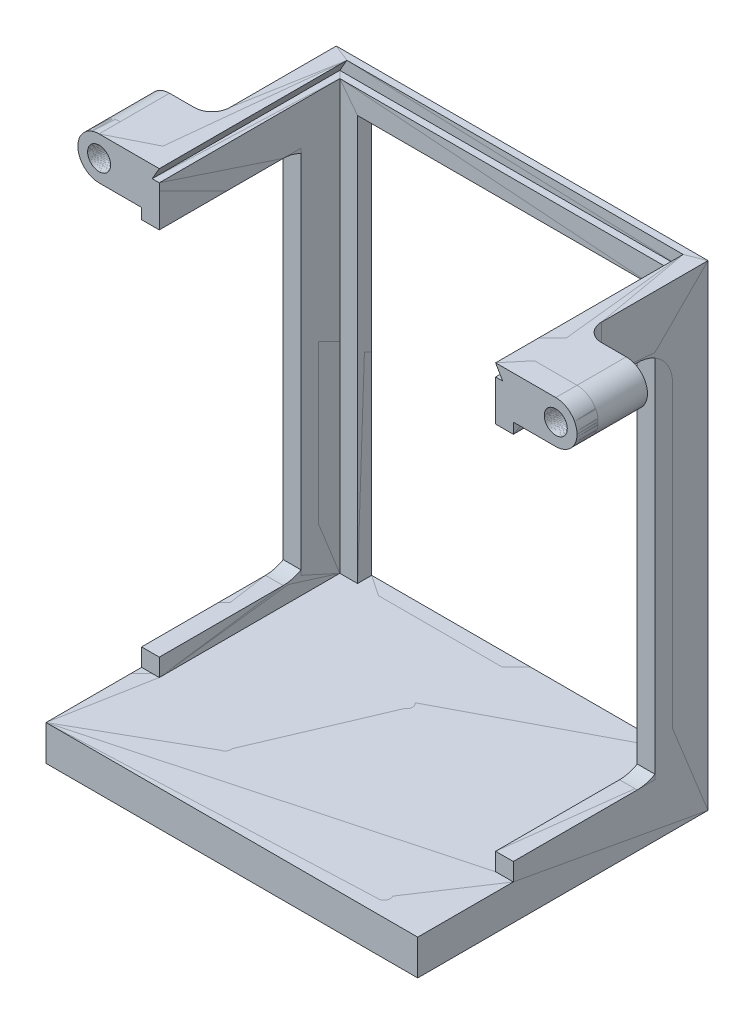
ISO-10303-21;
HEADER;
FILE_DESCRIPTION(('STEP AP214'),'2;1');
FILE_NAME('part.step','',(''),(''),'','','');
FILE_SCHEMA(('AUTOMOTIVE_DESIGN { 1 0 10303 214 1 1 1 1 }'));
ENDSEC;
DATA;
#1=APPLICATION_CONTEXT('core data for automotive mechanical design processes');
#2=APPLICATION_PROTOCOL_DEFINITION('international standard','automotive_design',2000,#1);
#3=PRODUCT_CONTEXT('',#1,'mechanical');
#4=PRODUCT('Part','Part','',(#3));
#5=PRODUCT_RELATED_PRODUCT_CATEGORY('part','',(#4));
#6=PRODUCT_DEFINITION_FORMATION('','',#4);
#7=PRODUCT_DEFINITION_CONTEXT('part definition',#1,'design');
#8=PRODUCT_DEFINITION('design','',#6,#7);
#9=PRODUCT_DEFINITION_SHAPE('','',#8);
#10=(LENGTH_UNIT() NAMED_UNIT(*) SI_UNIT(.MILLI.,.METRE.));
#11=(NAMED_UNIT(*) PLANE_ANGLE_UNIT() SI_UNIT($,.RADIAN.));
#12=(NAMED_UNIT(*) SI_UNIT($,.STERADIAN.) SOLID_ANGLE_UNIT());
#13=UNCERTAINTY_MEASURE_WITH_UNIT(LENGTH_MEASURE(1.E-05),#10,'distance_accuracy_value','');
#14=(GEOMETRIC_REPRESENTATION_CONTEXT(3) GLOBAL_UNCERTAINTY_ASSIGNED_CONTEXT((#13)) GLOBAL_UNIT_ASSIGNED_CONTEXT((#10,
#11,#12)) REPRESENTATION_CONTEXT('',''));
#15=CARTESIAN_POINT('',(0.,0.,0.));
#16=DIRECTION('',(0.,0.,1.));
#17=DIRECTION('',(1.,0.,0.));
#18=AXIS2_PLACEMENT_3D('',#15,#16,#17);
#19=CARTESIAN_POINT('',(-52.5,10.,41.));
#20=DIRECTION('',(1.,0.,0.));
#21=DIRECTION('',(0.,1.,0.));
#22=AXIS2_PLACEMENT_3D('',#19,#20,#21);
#23=PLANE('',#22);
#24=DIRECTION('',(0.,0.,1.));
#25=VECTOR('',#24,1.);
#26=CARTESIAN_POINT('',(-52.5,122.5,8.));
#27=LINE('',#26,#25);
#28=CARTESIAN_POINT('',(-52.5,122.5,-10.9));
#29=VERTEX_POINT('',#28);
#30=CARTESIAN_POINT('',(-52.5,122.5,14.));
#31=VERTEX_POINT('',#30);
#32=EDGE_CURVE('P0_E572',#29,#31,#27,.T.);
#33=ORIENTED_EDGE('',*,*,#32,.F.);
#34=DIRECTION('',(0.,-1.,0.));
#35=VECTOR('',#34,1.);
#36=CARTESIAN_POINT('',(-52.5,134.5,-10.9));
#37=LINE('',#36,#35);
#38=CARTESIAN_POINT('',(-52.5,134.5,-10.9));
#39=VERTEX_POINT('',#38);
#40=EDGE_CURVE('P0_E782',#29,#39,#37,.F.);
#41=ORIENTED_EDGE('',*,*,#40,.T.);
#42=DIRECTION('',(0.,0.,1.));
#43=VECTOR('',#42,1.);
#44=CARTESIAN_POINT('',(-52.5,134.5,-41.));
#45=LINE('',#44,#43);
#46=CARTESIAN_POINT('',(-52.5,134.5,-41.));
#47=VERTEX_POINT('',#46);
#48=EDGE_CURVE('P0_E569',#47,#39,#45,.T.);
#49=ORIENTED_EDGE('',*,*,#48,.F.);
#50=DIRECTION('',(0.,-1.,0.));
#51=VECTOR('',#50,1.);
#52=CARTESIAN_POINT('',(-52.5,10.,-41.));
#53=LINE('',#52,#51);
#54=CARTESIAN_POINT('',(-52.5,0.,-41.));
#55=VERTEX_POINT('',#54);
#56=EDGE_CURVE('P0_E461',#47,#55,#53,.T.);
#57=ORIENTED_EDGE('',*,*,#56,.T.);
#58=DIRECTION('',(0.,0.,1.));
#59=VECTOR('',#58,1.);
#60=CARTESIAN_POINT('',(-52.5,0.,41.));
#61=LINE('',#60,#59);
#62=CARTESIAN_POINT('',(-52.5,0.,41.));
#63=VERTEX_POINT('',#62);
#64=EDGE_CURVE('P0_E456',#55,#63,#61,.T.);
#65=ORIENTED_EDGE('',*,*,#64,.T.);
#66=DIRECTION('',(0.,-1.,0.));
#67=VECTOR('',#66,1.);
#68=CARTESIAN_POINT('',(-52.5,10.,41.));
#69=LINE('',#68,#67);
#70=CARTESIAN_POINT('',(-52.5,10.,41.));
#71=VERTEX_POINT('',#70);
#72=EDGE_CURVE('P0_E460',#71,#63,#69,.T.);
#73=ORIENTED_EDGE('',*,*,#72,.F.);
#74=DIRECTION('',(0.,0.,1.));
#75=VECTOR('',#74,1.);
#76=CARTESIAN_POINT('',(-52.5,10.,41.));
#77=LINE('',#76,#75);
#78=CARTESIAN_POINT('',(-52.5,10.,14.));
#79=VERTEX_POINT('',#78);
#80=EDGE_CURVE('P0_E480',#79,#71,#77,.T.);
#81=ORIENTED_EDGE('',*,*,#80,.F.);
#82=DIRECTION('',(0.,-1.,0.));
#83=VECTOR('',#82,1.);
#84=CARTESIAN_POINT('',(-52.5,134.5,14.));
#85=LINE('',#84,#83);
#86=CARTESIAN_POINT('',(-52.5,15.,14.));
#87=VERTEX_POINT('',#86);
#88=EDGE_CURVE('P0_E529',#87,#79,#85,.T.);
#89=ORIENTED_EDGE('',*,*,#88,.F.);
#90=DIRECTION('',(0.,0.,1.));
#91=VECTOR('',#90,1.);
#92=CARTESIAN_POINT('',(-52.5,15.,14.));
#93=LINE('',#92,#91);
#94=CARTESIAN_POINT('',(-52.5,15.,-21.));
#95=VERTEX_POINT('',#94);
#96=EDGE_CURVE('P0_E533',#95,#87,#93,.T.);
#97=ORIENTED_EDGE('',*,*,#96,.F.);
#98=CARTESIAN_POINT('',(-52.5,25.,-21.));
#99=DIRECTION('',(1.,0.,0.));
#100=DIRECTION('',(0.,0.,-1.));
#101=AXIS2_PLACEMENT_3D('',#98,#99,#100);
#102=CIRCLE('',#101,10.);
#103=CARTESIAN_POINT('',(-52.5,25.,-31.));
#104=VERTEX_POINT('',#103);
#105=EDGE_CURVE('P0_E778',#95,#104,#102,.T.);
#106=ORIENTED_EDGE('',*,*,#105,.T.);
#107=DIRECTION('',(0.,1.,0.));
#108=VECTOR('',#107,1.);
#109=CARTESIAN_POINT('',(-52.5,10.,-31.));
#110=LINE('',#109,#108);
#111=CARTESIAN_POINT('',(-52.5,109.5,-31.));
#112=VERTEX_POINT('',#111);
#113=EDGE_CURVE('P0_E416',#104,#112,#110,.T.);
#114=ORIENTED_EDGE('',*,*,#113,.T.);
#115=CARTESIAN_POINT('',(-52.5,109.5,-21.));
#116=DIRECTION('',(1.,0.,0.));
#117=DIRECTION('',(0.,0.,-1.));
#118=AXIS2_PLACEMENT_3D('',#115,#116,#117);
#119=CIRCLE('',#118,10.);
#120=CARTESIAN_POINT('',(-52.5,119.5,-21.));
#121=VERTEX_POINT('',#120);
#122=EDGE_CURVE('P0_E774',#112,#121,#119,.T.);
#123=ORIENTED_EDGE('',*,*,#122,.T.);
#124=DIRECTION('',(0.,0.,-1.));
#125=VECTOR('',#124,1.);
#126=CARTESIAN_POINT('',(-52.5,119.5,14.));
#127=LINE('',#126,#125);
#128=CARTESIAN_POINT('',(-52.5,119.5,14.));
#129=VERTEX_POINT('',#128);
#130=EDGE_CURVE('P0_E646',#129,#121,#127,.T.);
#131=ORIENTED_EDGE('',*,*,#130,.F.);
#132=DIRECTION('',(0.,-1.,0.));
#133=VECTOR('',#132,1.);
#134=CARTESIAN_POINT('',(-52.5,134.5,14.));
#135=LINE('',#134,#133);
#136=EDGE_CURVE('P0_E495',#31,#129,#135,.T.);
#137=ORIENTED_EDGE('',*,*,#136,.F.);
#138=EDGE_LOOP('',(#33,#41,#49,#57,#65,#73,#81,#89,#97,#106,#114,#123,#131,#137));
#139=FACE_BOUND('',#138,.T.);
#140=ADVANCED_FACE('P0_F53',(#139),#23,.F.);
#141=CARTESIAN_POINT('',(52.5,10.,41.));
#142=DIRECTION('',(-1.,0.,0.));
#143=DIRECTION('',(0.,0.,1.));
#144=AXIS2_PLACEMENT_3D('',#141,#142,#143);
#145=PLANE('',#144);
#146=DIRECTION('',(0.,0.,-1.));
#147=VECTOR('',#146,1.);
#148=CARTESIAN_POINT('',(52.5,134.5,-41.));
#149=LINE('',#148,#147);
#150=CARTESIAN_POINT('',(52.5,134.5,-10.9));
#151=VERTEX_POINT('',#150);
#152=CARTESIAN_POINT('',(52.5,134.5,-41.));
#153=VERTEX_POINT('',#152);
#154=EDGE_CURVE('P0_E537',#151,#153,#149,.T.);
#155=ORIENTED_EDGE('',*,*,#154,.F.);
#156=DIRECTION('',(0.,1.,0.));
#157=VECTOR('',#156,1.);
#158=CARTESIAN_POINT('',(52.5,122.5,-10.9));
#159=LINE('',#158,#157);
#160=CARTESIAN_POINT('',(52.5,122.5,-10.9));
#161=VERTEX_POINT('',#160);
#162=EDGE_CURVE('P0_E787',#151,#161,#159,.F.);
#163=ORIENTED_EDGE('',*,*,#162,.T.);
#164=DIRECTION('',(0.,0.,1.));
#165=VECTOR('',#164,1.);
#166=CARTESIAN_POINT('',(52.5,122.5,8.));
#167=LINE('',#166,#165);
#168=CARTESIAN_POINT('',(52.5,122.5,14.));
#169=VERTEX_POINT('',#168);
#170=EDGE_CURVE('P0_E69',#161,#169,#167,.T.);
#171=ORIENTED_EDGE('',*,*,#170,.T.);
#172=DIRECTION('',(0.,-1.,0.));
#173=VECTOR('',#172,1.);
#174=CARTESIAN_POINT('',(52.5,134.5,14.));
#175=LINE('',#174,#173);
#176=CARTESIAN_POINT('',(52.5,119.5,14.));
#177=VERTEX_POINT('',#176);
#178=EDGE_CURVE('P0_E437',#169,#177,#175,.T.);
#179=ORIENTED_EDGE('',*,*,#178,.T.);
#180=DIRECTION('',(0.,0.,-1.));
#181=VECTOR('',#180,1.);
#182=CARTESIAN_POINT('',(52.5,119.5,41.));
#183=LINE('',#182,#181);
#184=CARTESIAN_POINT('',(52.5,119.5,-21.));
#185=VERTEX_POINT('',#184);
#186=EDGE_CURVE('P0_E447',#177,#185,#183,.T.);
#187=ORIENTED_EDGE('',*,*,#186,.T.);
#188=CARTESIAN_POINT('',(52.5,109.5,-21.));
#189=DIRECTION('',(-1.,0.,0.));
#190=DIRECTION('',(0.,0.,1.));
#191=AXIS2_PLACEMENT_3D('',#188,#189,#190);
#192=CIRCLE('',#191,10.);
#193=CARTESIAN_POINT('',(52.5,109.5,-31.));
#194=VERTEX_POINT('',#193);
#195=EDGE_CURVE('P0_E768',#185,#194,#192,.T.);
#196=ORIENTED_EDGE('',*,*,#195,.T.);
#197=DIRECTION('',(0.,1.,0.));
#198=VECTOR('',#197,1.);
#199=CARTESIAN_POINT('',(52.5,15.,-31.));
#200=LINE('',#199,#198);
#201=CARTESIAN_POINT('',(52.5,25.,-31.));
#202=VERTEX_POINT('',#201);
#203=EDGE_CURVE('P0_E802',#202,#194,#200,.T.);
#204=ORIENTED_EDGE('',*,*,#203,.F.);
#205=CARTESIAN_POINT('',(52.5,25.,-21.));
#206=DIRECTION('',(-1.,0.,0.));
#207=DIRECTION('',(0.,0.,1.));
#208=AXIS2_PLACEMENT_3D('',#205,#206,#207);
#209=CIRCLE('',#208,10.);
#210=CARTESIAN_POINT('',(52.5,15.,-21.));
#211=VERTEX_POINT('',#210);
#212=EDGE_CURVE('P0_E764',#202,#211,#209,.T.);
#213=ORIENTED_EDGE('',*,*,#212,.T.);
#214=DIRECTION('',(0.,0.,1.));
#215=VECTOR('',#214,1.);
#216=CARTESIAN_POINT('',(52.5,15.,41.));
#217=LINE('',#216,#215);
#218=CARTESIAN_POINT('',(52.5,15.,14.));
#219=VERTEX_POINT('',#218);
#220=EDGE_CURVE('P0_E634',#211,#219,#217,.T.);
#221=ORIENTED_EDGE('',*,*,#220,.T.);
#222=DIRECTION('',(0.,-1.,0.));
#223=VECTOR('',#222,1.);
#224=CARTESIAN_POINT('',(52.5,134.5,14.));
#225=LINE('',#224,#223);
#226=CARTESIAN_POINT('',(52.5,10.,14.));
#227=VERTEX_POINT('',#226);
#228=EDGE_CURVE('P0_E640',#219,#227,#225,.T.);
#229=ORIENTED_EDGE('',*,*,#228,.T.);
#230=DIRECTION('',(0.,0.,-1.));
#231=VECTOR('',#230,1.);
#232=CARTESIAN_POINT('',(52.5,10.,41.));
#233=LINE('',#232,#231);
#234=CARTESIAN_POINT('',(52.5,10.,41.));
#235=VERTEX_POINT('',#234);
#236=EDGE_CURVE('P0_E443',#235,#227,#233,.T.);
#237=ORIENTED_EDGE('',*,*,#236,.F.);
#238=DIRECTION('',(0.,-1.,0.));
#239=VECTOR('',#238,1.);
#240=CARTESIAN_POINT('',(52.5,10.,41.));
#241=LINE('',#240,#239);
#242=CARTESIAN_POINT('',(52.5,0.,41.));
#243=VERTEX_POINT('',#242);
#244=EDGE_CURVE('P0_E635',#235,#243,#241,.T.);
#245=ORIENTED_EDGE('',*,*,#244,.T.);
#246=DIRECTION('',(0.,0.,-1.));
#247=VECTOR('',#246,1.);
#248=CARTESIAN_POINT('',(52.5,0.,41.));
#249=LINE('',#248,#247);
#250=CARTESIAN_POINT('',(52.5,0.,-41.));
#251=VERTEX_POINT('',#250);
#252=EDGE_CURVE('P0_E639',#243,#251,#249,.T.);
#253=ORIENTED_EDGE('',*,*,#252,.T.);
#254=DIRECTION('',(0.,-1.,0.));
#255=VECTOR('',#254,1.);
#256=CARTESIAN_POINT('',(52.5,10.,-41.));
#257=LINE('',#256,#255);
#258=EDGE_CURVE('P0_E553',#153,#251,#257,.T.);
#259=ORIENTED_EDGE('',*,*,#258,.F.);
#260=EDGE_LOOP('',(#155,#163,#171,#179,#187,#196,#204,#213,#221,#229,#237,#245,#253,#259));
#261=FACE_BOUND('',#260,.T.);
#262=ADVANCED_FACE('P0_F859',(#261),#145,.F.);
#263=CARTESIAN_POINT('',(70.5,15.,14.));
#264=DIRECTION('',(0.,-1.,0.));
#265=DIRECTION('',(-1.,0.,0.));
#266=AXIS2_PLACEMENT_3D('',#263,#264,#265);
#267=PLANE('',#266);
#268=DIRECTION('',(0.,0.,1.));
#269=VECTOR('',#268,1.);
#270=CARTESIAN_POINT('',(-47.5,15.,-37.));
#271=LINE('',#270,#269);
#272=CARTESIAN_POINT('',(-47.5,15.,-21.));
#273=VERTEX_POINT('',#272);
#274=CARTESIAN_POINT('',(-47.5,15.,14.));
#275=VERTEX_POINT('',#274);
#276=EDGE_CURVE('P0_E624',#273,#275,#271,.T.);
#277=ORIENTED_EDGE('',*,*,#276,.F.);
#278=DIRECTION('',(1.,0.,0.));
#279=VECTOR('',#278,1.);
#280=CARTESIAN_POINT('',(-52.5,15.,-21.));
#281=LINE('',#280,#279);
#282=EDGE_CURVE('P0_E762',#273,#95,#281,.F.);
#283=ORIENTED_EDGE('',*,*,#282,.T.);
#284=ORIENTED_EDGE('',*,*,#96,.T.);
#285=DIRECTION('',(-1.,0.,0.));
#286=VECTOR('',#285,1.);
#287=CARTESIAN_POINT('',(70.5,15.,14.));
#288=LINE('',#287,#286);
#289=EDGE_CURVE('P0_E608',#275,#87,#288,.T.);
#290=ORIENTED_EDGE('',*,*,#289,.F.);
#291=EDGE_LOOP('',(#277,#283,#284,#290));
#292=FACE_BOUND('',#291,.T.);
#293=ADVANCED_FACE('P0_F864',(#292),#267,.F.);
#294=CARTESIAN_POINT('',(70.5,119.5,14.));
#295=DIRECTION('',(0.,1.,0.));
#296=DIRECTION('',(1.,0.,0.));
#297=AXIS2_PLACEMENT_3D('',#294,#295,#296);
#298=PLANE('',#297);
#299=ORIENTED_EDGE('',*,*,#130,.T.);
#300=DIRECTION('',(1.,0.,0.));
#301=VECTOR('',#300,1.);
#302=CARTESIAN_POINT('',(-47.5,119.5,-21.));
#303=LINE('',#302,#301);
#304=CARTESIAN_POINT('',(-47.5,119.5,-21.));
#305=VERTEX_POINT('',#304);
#306=EDGE_CURVE('P0_E754',#121,#305,#303,.T.);
#307=ORIENTED_EDGE('',*,*,#306,.T.);
#308=DIRECTION('',(0.,0.,-1.));
#309=VECTOR('',#308,1.);
#310=CARTESIAN_POINT('',(-47.5,119.5,-37.));
#311=LINE('',#310,#309);
#312=CARTESIAN_POINT('',(-47.5,119.5,14.));
#313=VERTEX_POINT('',#312);
#314=EDGE_CURVE('P0_E620',#313,#305,#311,.T.);
#315=ORIENTED_EDGE('',*,*,#314,.F.);
#316=DIRECTION('',(-1.,0.,0.));
#317=VECTOR('',#316,1.);
#318=CARTESIAN_POINT('',(70.5,119.5,14.));
#319=LINE('',#318,#317);
#320=EDGE_CURVE('P0_E499',#313,#129,#319,.T.);
#321=ORIENTED_EDGE('',*,*,#320,.T.);
#322=EDGE_LOOP('',(#299,#307,#315,#321));
#323=FACE_BOUND('',#322,.T.);
#324=ADVANCED_FACE('P0_F828',(#323),#298,.F.);
#325=CARTESIAN_POINT('',(70.5,119.5,14.));
#326=DIRECTION('',(0.,1.,0.));
#327=DIRECTION('',(1.,0.,0.));
#328=AXIS2_PLACEMENT_3D('',#325,#326,#327);
#329=PLANE('',#328);
#330=DIRECTION('',(0.,0.,1.));
#331=VECTOR('',#330,1.);
#332=CARTESIAN_POINT('',(47.5,119.5,-37.));
#333=LINE('',#332,#331);
#334=CARTESIAN_POINT('',(47.5,119.5,-21.));
#335=VERTEX_POINT('',#334);
#336=CARTESIAN_POINT('',(47.5,119.5,14.));
#337=VERTEX_POINT('',#336);
#338=EDGE_CURVE('P0_E476',#335,#337,#333,.T.);
#339=ORIENTED_EDGE('',*,*,#338,.F.);
#340=DIRECTION('',(1.,0.,0.));
#341=VECTOR('',#340,1.);
#342=CARTESIAN_POINT('',(52.5,119.5,-21.));
#343=LINE('',#342,#341);
#344=EDGE_CURVE('P0_E751',#335,#185,#343,.T.);
#345=ORIENTED_EDGE('',*,*,#344,.T.);
#346=ORIENTED_EDGE('',*,*,#186,.F.);
#347=DIRECTION('',(1.,0.,0.));
#348=VECTOR('',#347,1.);
#349=CARTESIAN_POINT('',(52.5,119.5,14.));
#350=LINE('',#349,#348);
#351=EDGE_CURVE('P0_E452',#337,#177,#350,.T.);
#352=ORIENTED_EDGE('',*,*,#351,.F.);
#353=EDGE_LOOP('',(#339,#345,#346,#352));
#354=FACE_BOUND('',#353,.T.);
#355=ADVANCED_FACE('P0_F984',(#354),#329,.F.);
#356=CARTESIAN_POINT('',(70.5,15.,14.));
#357=DIRECTION('',(0.,-1.,0.));
#358=DIRECTION('',(-1.,0.,0.));
#359=AXIS2_PLACEMENT_3D('',#356,#357,#358);
#360=PLANE('',#359);
#361=ORIENTED_EDGE('',*,*,#220,.F.);
#362=DIRECTION('',(1.,0.,0.));
#363=VECTOR('',#362,1.);
#364=CARTESIAN_POINT('',(47.5,15.,-21.));
#365=LINE('',#364,#363);
#366=CARTESIAN_POINT('',(47.5,15.,-21.));
#367=VERTEX_POINT('',#366);
#368=EDGE_CURVE('P0_E749',#211,#367,#365,.F.);
#369=ORIENTED_EDGE('',*,*,#368,.T.);
#370=DIRECTION('',(0.,0.,-1.));
#371=VECTOR('',#370,1.);
#372=CARTESIAN_POINT('',(47.5,15.,-37.));
#373=LINE('',#372,#371);
#374=CARTESIAN_POINT('',(47.5,15.,14.));
#375=VERTEX_POINT('',#374);
#376=EDGE_CURVE('P0_E599',#375,#367,#373,.T.);
#377=ORIENTED_EDGE('',*,*,#376,.F.);
#378=DIRECTION('',(-1.,0.,0.));
#379=VECTOR('',#378,1.);
#380=CARTESIAN_POINT('',(52.5,15.,14.));
#381=LINE('',#380,#379);
#382=EDGE_CURVE('P0_E596',#219,#375,#381,.T.);
#383=ORIENTED_EDGE('',*,*,#382,.F.);
#384=EDGE_LOOP('',(#361,#369,#377,#383));
#385=FACE_BOUND('',#384,.T.);
#386=ADVANCED_FACE('P0_F979',(#385),#360,.F.);
#387=CARTESIAN_POINT('',(-42.5,10.,41.001));
#388=DIRECTION('',(-1.,0.,0.));
#389=DIRECTION('',(0.,1.,0.));
#390=AXIS2_PLACEMENT_3D('',#387,#388,#389);
#391=PLANE('',#390);
#392=DIRECTION('',(0.,-1.,0.));
#393=VECTOR('',#392,1.);
#394=CARTESIAN_POINT('',(-42.5,10.,-37.));
#395=LINE('',#394,#393);
#396=CARTESIAN_POINT('',(-42.5,124.5,-37.));
#397=VERTEX_POINT('',#396);
#398=CARTESIAN_POINT('',(-42.5,10.,-37.));
#399=VERTEX_POINT('',#398);
#400=EDGE_CURVE('P0_E468',#397,#399,#395,.T.);
#401=ORIENTED_EDGE('',*,*,#400,.T.);
#402=DIRECTION('',(0.,0.,-1.));
#403=VECTOR('',#402,1.);
#404=CARTESIAN_POINT('',(-42.5,10.,41.001));
#405=LINE('',#404,#403);
#406=CARTESIAN_POINT('',(-42.5,10.,-41.));
#407=VERTEX_POINT('',#406);
#408=EDGE_CURVE('P0_E489',#399,#407,#405,.T.);
#409=ORIENTED_EDGE('',*,*,#408,.T.);
#410=DIRECTION('',(0.,1.,0.));
#411=VECTOR('',#410,1.);
#412=CARTESIAN_POINT('',(-42.5,10.,-41.));
#413=LINE('',#412,#411);
#414=CARTESIAN_POINT('',(-42.5,124.5,-41.));
#415=VERTEX_POINT('',#414);
#416=EDGE_CURVE('P0_E618',#407,#415,#413,.T.);
#417=ORIENTED_EDGE('',*,*,#416,.T.);
#418=DIRECTION('',(0.,0.,-1.));
#419=VECTOR('',#418,1.);
#420=CARTESIAN_POINT('',(-42.5,124.5,41.001));
#421=LINE('',#420,#419);
#422=EDGE_CURVE('P0_E565',#397,#415,#421,.T.);
#423=ORIENTED_EDGE('',*,*,#422,.F.);
#424=EDGE_LOOP('',(#401,#409,#417,#423));
#425=FACE_BOUND('',#424,.T.);
#426=ADVANCED_FACE('P0_F975',(#425),#391,.F.);
#427=CARTESIAN_POINT('',(42.5,124.5,41.001));
#428=DIRECTION('',(0.,1.,0.));
#429=DIRECTION('',(1.,0.,0.));
#430=AXIS2_PLACEMENT_3D('',#427,#428,#429);
#431=PLANE('',#430);
#432=DIRECTION('',(-1.,0.,0.));
#433=VECTOR('',#432,1.);
#434=CARTESIAN_POINT('',(42.5,124.5,-37.));
#435=LINE('',#434,#433);
#436=CARTESIAN_POINT('',(42.5,124.5,-37.));
#437=VERTEX_POINT('',#436);
#438=EDGE_CURVE('P0_E576',#437,#397,#435,.T.);
#439=ORIENTED_EDGE('',*,*,#438,.T.);
#440=ORIENTED_EDGE('',*,*,#422,.T.);
#441=DIRECTION('',(1.,0.,0.));
#442=VECTOR('',#441,1.);
#443=CARTESIAN_POINT('',(42.5,124.5,-41.));
#444=LINE('',#443,#442);
#445=CARTESIAN_POINT('',(42.5,124.5,-41.));
#446=VERTEX_POINT('',#445);
#447=EDGE_CURVE('P0_E614',#415,#446,#444,.T.);
#448=ORIENTED_EDGE('',*,*,#447,.T.);
#449=DIRECTION('',(0.,0.,-1.));
#450=VECTOR('',#449,1.);
#451=CARTESIAN_POINT('',(42.5,124.5,41.001));
#452=LINE('',#451,#450);
#453=EDGE_CURVE('P0_E546',#437,#446,#452,.T.);
#454=ORIENTED_EDGE('',*,*,#453,.F.);
#455=EDGE_LOOP('',(#439,#440,#448,#454));
#456=FACE_BOUND('',#455,.T.);
#457=ADVANCED_FACE('P0_F978',(#456),#431,.F.);
#458=CARTESIAN_POINT('',(42.5,10.,41.001));
#459=DIRECTION('',(1.,0.,0.));
#460=DIRECTION('',(0.,1.,0.));
#461=AXIS2_PLACEMENT_3D('',#458,#459,#460);
#462=PLANE('',#461);
#463=DIRECTION('',(0.,1.,0.));
#464=VECTOR('',#463,1.);
#465=CARTESIAN_POINT('',(42.5,10.,-37.));
#466=LINE('',#465,#464);
#467=CARTESIAN_POINT('',(42.5,10.,-37.));
#468=VERTEX_POINT('',#467);
#469=EDGE_CURVE('P0_E442',#468,#437,#466,.T.);
#470=ORIENTED_EDGE('',*,*,#469,.T.);
#471=ORIENTED_EDGE('',*,*,#453,.T.);
#472=DIRECTION('',(0.,-1.,0.));
#473=VECTOR('',#472,1.);
#474=CARTESIAN_POINT('',(42.5,10.,-41.));
#475=LINE('',#474,#473);
#476=CARTESIAN_POINT('',(42.5,10.,-41.));
#477=VERTEX_POINT('',#476);
#478=EDGE_CURVE('P0_E619',#446,#477,#475,.T.);
#479=ORIENTED_EDGE('',*,*,#478,.T.);
#480=DIRECTION('',(0.,0.,-1.));
#481=VECTOR('',#480,1.);
#482=CARTESIAN_POINT('',(42.5,10.,41.001));
#483=LINE('',#482,#481);
#484=EDGE_CURVE('P0_E527',#468,#477,#483,.T.);
#485=ORIENTED_EDGE('',*,*,#484,.F.);
#486=EDGE_LOOP('',(#470,#471,#479,#485));
#487=FACE_BOUND('',#486,.T.);
#488=ADVANCED_FACE('P0_F988',(#487),#462,.F.);
#489=CARTESIAN_POINT('',(0.,122.5,8.));
#490=DIRECTION('',(0.,1.,0.));
#491=DIRECTION('',(1.,0.,0.));
#492=AXIS2_PLACEMENT_3D('',#489,#490,#491);
#493=PLANE('',#492);
#494=DIRECTION('',(-1.,0.,0.));
#495=VECTOR('',#494,1.);
#496=CARTESIAN_POINT('',(0.,122.5,14.));
#497=LINE('',#496,#495);
#498=CARTESIAN_POINT('',(64.5,122.5,14.));
#499=VERTEX_POINT('',#498);
#500=EDGE_CURVE('P0_E433',#499,#169,#497,.T.);
#501=ORIENTED_EDGE('',*,*,#500,.T.);
#502=ORIENTED_EDGE('',*,*,#170,.F.);
#503=CARTESIAN_POINT('',(57.5,122.5,-10.9));
#504=DIRECTION('',(0.,1.,0.));
#505=DIRECTION('',(0.,0.,1.));
#506=AXIS2_PLACEMENT_3D('',#503,#504,#505);
#507=CIRCLE('',#506,5.);
#508=CARTESIAN_POINT('',(57.5,122.5,-5.9));
#509=VERTEX_POINT('',#508);
#510=EDGE_CURVE('P0_E11',#161,#509,#507,.T.);
#511=ORIENTED_EDGE('',*,*,#510,.T.);
#512=DIRECTION('',(-1.,0.,0.));
#513=VECTOR('',#512,1.);
#514=CARTESIAN_POINT('',(64.4999999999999,122.5,-5.9));
#515=LINE('',#514,#513);
#516=CARTESIAN_POINT('',(64.4999999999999,122.5,-5.9));
#517=VERTEX_POINT('',#516);
#518=EDGE_CURVE('P0_E427',#517,#509,#515,.T.);
#519=ORIENTED_EDGE('',*,*,#518,.F.);
#520=DIRECTION('',(0.,0.,1.));
#521=VECTOR('',#520,1.);
#522=CARTESIAN_POINT('',(64.5,122.5,8.));
#523=LINE('',#522,#521);
#524=EDGE_CURVE('P0_E519',#517,#499,#523,.T.);
#525=ORIENTED_EDGE('',*,*,#524,.T.);
#526=EDGE_LOOP('',(#501,#502,#511,#519,#525));
#527=FACE_BOUND('',#526,.T.);
#528=ADVANCED_FACE('P0_F991',(#527),#493,.F.);
#529=CARTESIAN_POINT('',(-64.5,128.5,8.));
#530=DIRECTION('',(0.,0.,1.));
#531=DIRECTION('',(1.,0.,0.));
#532=AXIS2_PLACEMENT_3D('',#529,#530,#531);
#533=CYLINDRICAL_SURFACE('',#532,6.);
#534=CARTESIAN_POINT('',(-64.5,128.5,14.));
#535=DIRECTION('',(0.,0.,1.));
#536=DIRECTION('',(1.,0.,0.));
#537=AXIS2_PLACEMENT_3D('',#534,#535,#536);
#538=CIRCLE('',#537,6.);
#539=CARTESIAN_POINT('',(-64.5,134.5,14.));
#540=VERTEX_POINT('',#539);
#541=CARTESIAN_POINT('',(-64.5,122.5,14.));
#542=VERTEX_POINT('',#541);
#543=EDGE_CURVE('P0_E390',#540,#542,#538,.T.);
#544=ORIENTED_EDGE('',*,*,#543,.F.);
#545=DIRECTION('',(0.,0.,1.));
#546=VECTOR('',#545,1.);
#547=CARTESIAN_POINT('',(-64.5,134.5,8.));
#548=LINE('',#547,#546);
#549=CARTESIAN_POINT('',(-64.5,134.5,-5.9));
#550=VERTEX_POINT('',#549);
#551=EDGE_CURVE('P0_E384',#550,#540,#548,.T.);
#552=ORIENTED_EDGE('',*,*,#551,.F.);
#553=CARTESIAN_POINT('',(-64.5,128.5,-5.9));
#554=DIRECTION('',(0.,0.,-1.));
#555=DIRECTION('',(1.,0.,0.));
#556=AXIS2_PLACEMENT_3D('',#553,#554,#555);
#557=CIRCLE('',#556,6.00000000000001);
#558=CARTESIAN_POINT('',(-64.5000000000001,122.5,-5.9));
#559=VERTEX_POINT('',#558);
#560=EDGE_CURVE('P0_E388',#559,#550,#557,.T.);
#561=ORIENTED_EDGE('',*,*,#560,.F.);
#562=DIRECTION('',(0.,0.,1.));
#563=VECTOR('',#562,1.);
#564=CARTESIAN_POINT('',(-64.5,122.5,8.));
#565=LINE('',#564,#563);
#566=EDGE_CURVE('P0_E543',#559,#542,#565,.T.);
#567=ORIENTED_EDGE('',*,*,#566,.T.);
#568=EDGE_LOOP('',(#544,#552,#561,#567));
#569=FACE_BOUND('',#568,.T.);
#570=ADVANCED_FACE('P0_F386',(#569),#533,.T.);
#571=CARTESIAN_POINT('',(0.,122.5,8.));
#572=DIRECTION('',(0.,-1.,0.));
#573=DIRECTION('',(0.,0.,-1.));
#574=AXIS2_PLACEMENT_3D('',#571,#572,#573);
#575=PLANE('',#574);
#576=DIRECTION('',(1.,0.,0.));
#577=VECTOR('',#576,1.);
#578=CARTESIAN_POINT('',(0.,122.5,14.));
#579=LINE('',#578,#577);
#580=EDGE_CURVE('P0_E589',#542,#31,#579,.T.);
#581=ORIENTED_EDGE('',*,*,#580,.F.);
#582=ORIENTED_EDGE('',*,*,#566,.F.);
#583=DIRECTION('',(-1.,0.,0.));
#584=VECTOR('',#583,1.);
#585=CARTESIAN_POINT('',(-52.5,122.5,-5.9));
#586=LINE('',#585,#584);
#587=CARTESIAN_POINT('',(-57.5,122.5,-5.9));
#588=VERTEX_POINT('',#587);
#589=EDGE_CURVE('P0_E407',#588,#559,#586,.T.);
#590=ORIENTED_EDGE('',*,*,#589,.F.);
#591=CARTESIAN_POINT('',(-57.5,122.5,-10.9));
#592=DIRECTION('',(0.,-1.,0.));
#593=DIRECTION('',(0.,0.,-1.));
#594=AXIS2_PLACEMENT_3D('',#591,#592,#593);
#595=CIRCLE('',#594,5.);
#596=EDGE_CURVE('P0_E789',#588,#29,#595,.F.);
#597=ORIENTED_EDGE('',*,*,#596,.T.);
#598=ORIENTED_EDGE('',*,*,#32,.T.);
#599=EDGE_LOOP('',(#581,#582,#590,#597,#598));
#600=FACE_BOUND('',#599,.T.);
#601=ADVANCED_FACE('P0_F844',(#600),#575,.T.);
#602=CARTESIAN_POINT('',(47.5,134.5,-140.060587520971));
#603=DIRECTION('',(0.866025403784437,0.5,0.));
#604=DIRECTION('',(0.,0.,-1.));
#605=AXIS2_PLACEMENT_3D('',#602,#603,#604);
#606=PLANE('',#605);
#607=DIRECTION('',(0.,0.,1.));
#608=VECTOR('',#607,1.);
#609=CARTESIAN_POINT('',(49.5,131.035898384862,-140.060587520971));
#610=LINE('',#609,#608);
#611=CARTESIAN_POINT('',(49.5,131.035898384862,-39.));
#612=VERTEX_POINT('',#611);
#613=CARTESIAN_POINT('',(49.5,131.035898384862,14.));
#614=VERTEX_POINT('',#613);
#615=EDGE_CURVE('P0_E394',#612,#614,#610,.T.);
#616=ORIENTED_EDGE('',*,*,#615,.T.);
#617=DIRECTION('',(-0.5,0.866025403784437,0.));
#618=VECTOR('',#617,1.);
#619=CARTESIAN_POINT('',(47.5,134.5,14.));
#620=LINE('',#619,#618);
#621=CARTESIAN_POINT('',(47.5,134.5,14.));
#622=VERTEX_POINT('',#621);
#623=EDGE_CURVE('P0_E509',#614,#622,#620,.T.);
#624=ORIENTED_EDGE('',*,*,#623,.T.);
#625=DIRECTION('',(0.,0.,1.));
#626=VECTOR('',#625,1.);
#627=CARTESIAN_POINT('',(47.5,134.5,-37.));
#628=LINE('',#627,#626);
#629=CARTESIAN_POINT('',(47.5,134.5,-39.));
#630=VERTEX_POINT('',#629);
#631=EDGE_CURVE('P0_E487',#630,#622,#628,.T.);
#632=ORIENTED_EDGE('',*,*,#631,.F.);
#633=DIRECTION('',(-0.5,0.866025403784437,0.));
#634=VECTOR('',#633,1.);
#635=CARTESIAN_POINT('',(47.5,134.5,-39.));
#636=LINE('',#635,#634);
#637=EDGE_CURVE('P0_E472',#612,#630,#636,.T.);
#638=ORIENTED_EDGE('',*,*,#637,.F.);
#639=EDGE_LOOP('',(#616,#624,#632,#638));
#640=FACE_BOUND('',#639,.T.);
#641=ADVANCED_FACE('P0_F1008',(#640),#606,.F.);
#642=CARTESIAN_POINT('',(-47.5,134.5,-140.060587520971));
#643=DIRECTION('',(-0.866025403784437,0.5,0.));
#644=DIRECTION('',(0.,0.,1.));
#645=AXIS2_PLACEMENT_3D('',#642,#643,#644);
#646=PLANE('',#645);
#647=DIRECTION('',(-0.5,-0.866025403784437,0.));
#648=VECTOR('',#647,1.);
#649=CARTESIAN_POINT('',(-47.5,134.5,-39.));
#650=LINE('',#649,#648);
#651=CARTESIAN_POINT('',(-47.5,134.5,-39.));
#652=VERTEX_POINT('',#651);
#653=CARTESIAN_POINT('',(-49.5,131.035898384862,-39.));
#654=VERTEX_POINT('',#653);
#655=EDGE_CURVE('P0_E469',#652,#654,#650,.T.);
#656=ORIENTED_EDGE('',*,*,#655,.F.);
#657=DIRECTION('',(0.,0.,-1.));
#658=VECTOR('',#657,1.);
#659=CARTESIAN_POINT('',(-47.5,134.5,-37.));
#660=LINE('',#659,#658);
#661=CARTESIAN_POINT('',(-47.5,134.5,14.));
#662=VERTEX_POINT('',#661);
#663=EDGE_CURVE('P0_E488',#662,#652,#660,.T.);
#664=ORIENTED_EDGE('',*,*,#663,.F.);
#665=DIRECTION('',(-0.5,-0.866025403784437,0.));
#666=VECTOR('',#665,1.);
#667=CARTESIAN_POINT('',(-47.5,134.5,14.));
#668=LINE('',#667,#666);
#669=CARTESIAN_POINT('',(-49.5,131.035898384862,14.));
#670=VERTEX_POINT('',#669);
#671=EDGE_CURVE('P0_E547',#662,#670,#668,.T.);
#672=ORIENTED_EDGE('',*,*,#671,.T.);
#673=DIRECTION('',(0.,0.,1.));
#674=VECTOR('',#673,1.);
#675=CARTESIAN_POINT('',(-49.5,131.035898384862,-140.060587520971));
#676=LINE('',#675,#674);
#677=EDGE_CURVE('P0_E473',#654,#670,#676,.T.);
#678=ORIENTED_EDGE('',*,*,#677,.F.);
#679=EDGE_LOOP('',(#656,#664,#672,#678));
#680=FACE_BOUND('',#679,.T.);
#681=ADVANCED_FACE('P0_F1011',(#680),#646,.F.);
#682=CARTESIAN_POINT('',(47.5,134.5,-39.));
#683=DIRECTION('',(0.,0.,-1.));
#684=DIRECTION('',(0.,-1.,0.));
#685=AXIS2_PLACEMENT_3D('',#682,#683,#684);
#686=PLANE('',#685);
#687=DIRECTION('',(-1.,0.,0.));
#688=VECTOR('',#687,1.);
#689=CARTESIAN_POINT('',(-47.5,134.5,-39.));
#690=LINE('',#689,#688);
#691=EDGE_CURVE('P0_E483',#630,#652,#690,.T.);
#692=ORIENTED_EDGE('',*,*,#691,.T.);
#693=ORIENTED_EDGE('',*,*,#655,.T.);
#694=DIRECTION('',(1.,0.,0.));
#695=VECTOR('',#694,1.);
#696=CARTESIAN_POINT('',(49.5,131.035898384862,-39.));
#697=LINE('',#696,#695);
#698=EDGE_CURVE('P0_E503',#654,#612,#697,.T.);
#699=ORIENTED_EDGE('',*,*,#698,.T.);
#700=ORIENTED_EDGE('',*,*,#637,.T.);
#701=EDGE_LOOP('',(#692,#693,#699,#700));
#702=FACE_BOUND('',#701,.T.);
#703=ADVANCED_FACE('P0_F1032',(#702),#686,.F.);
#704=CARTESIAN_POINT('',(49.5,131.035898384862,-140.060587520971));
#705=DIRECTION('',(0.,-1.,0.));
#706=DIRECTION('',(0.,0.,-1.));
#707=AXIS2_PLACEMENT_3D('',#704,#705,#706);
#708=PLANE('',#707);
#709=DIRECTION('',(-1.,0.,0.));
#710=VECTOR('',#709,1.);
#711=CARTESIAN_POINT('',(47.5,131.035898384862,-37.));
#712=LINE('',#711,#710);
#713=CARTESIAN_POINT('',(47.5,131.035898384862,-37.));
#714=VERTEX_POINT('',#713);
#715=CARTESIAN_POINT('',(-47.5,131.035898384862,-37.));
#716=VERTEX_POINT('',#715);
#717=EDGE_CURVE('P0_E441',#714,#716,#712,.T.);
#718=ORIENTED_EDGE('',*,*,#717,.F.);
#719=DIRECTION('',(0.,0.,-1.));
#720=VECTOR('',#719,1.);
#721=CARTESIAN_POINT('',(47.5,131.035898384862,-37.));
#722=LINE('',#721,#720);
#723=CARTESIAN_POINT('',(47.5,131.035898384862,14.));
#724=VERTEX_POINT('',#723);
#725=EDGE_CURVE('P0_E482',#724,#714,#722,.T.);
#726=ORIENTED_EDGE('',*,*,#725,.F.);
#727=DIRECTION('',(1.,0.,0.));
#728=VECTOR('',#727,1.);
#729=CARTESIAN_POINT('',(49.5,131.035898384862,14.));
#730=LINE('',#729,#728);
#731=EDGE_CURVE('P0_E504',#724,#614,#730,.T.);
#732=ORIENTED_EDGE('',*,*,#731,.T.);
#733=ORIENTED_EDGE('',*,*,#615,.F.);
#734=ORIENTED_EDGE('',*,*,#698,.F.);
#735=ORIENTED_EDGE('',*,*,#677,.T.);
#736=DIRECTION('',(1.,0.,0.));
#737=VECTOR('',#736,1.);
#738=CARTESIAN_POINT('',(49.5,131.035898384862,14.));
#739=LINE('',#738,#737);
#740=CARTESIAN_POINT('',(-47.5,131.035898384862,14.));
#741=VERTEX_POINT('',#740);
#742=EDGE_CURVE('P0_E542',#670,#741,#739,.T.);
#743=ORIENTED_EDGE('',*,*,#742,.T.);
#744=DIRECTION('',(0.,0.,1.));
#745=VECTOR('',#744,1.);
#746=CARTESIAN_POINT('',(-47.5,131.035898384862,-37.));
#747=LINE('',#746,#745);
#748=EDGE_CURVE('P0_E580',#716,#741,#747,.T.);
#749=ORIENTED_EDGE('',*,*,#748,.F.);
#750=EDGE_LOOP('',(#718,#726,#732,#733,#734,#735,#743,#749));
#751=FACE_BOUND('',#750,.T.);
#752=ADVANCED_FACE('P0_F969',(#751),#708,.F.);
#753=CARTESIAN_POINT('',(0.,134.5,0.));
#754=DIRECTION('',(0.,1.,0.));
#755=DIRECTION('',(1.,0.,0.));
#756=AXIS2_PLACEMENT_3D('',#753,#754,#755);
#757=PLANE('',#756);
#758=ORIENTED_EDGE('',*,*,#663,.T.);
#759=ORIENTED_EDGE('',*,*,#691,.F.);
#760=ORIENTED_EDGE('',*,*,#631,.T.);
#761=DIRECTION('',(1.,0.,0.));
#762=VECTOR('',#761,1.);
#763=CARTESIAN_POINT('',(52.5,134.5,14.));
#764=LINE('',#763,#762);
#765=CARTESIAN_POINT('',(64.5,134.5,14.));
#766=VERTEX_POINT('',#765);
#767=EDGE_CURVE('P0_E455',#622,#766,#764,.T.);
#768=ORIENTED_EDGE('',*,*,#767,.T.);
#769=DIRECTION('',(0.,0.,1.));
#770=VECTOR('',#769,1.);
#771=CARTESIAN_POINT('',(64.5,134.5,8.));
#772=LINE('',#771,#770);
#773=CARTESIAN_POINT('',(64.5,134.5,-5.9));
#774=VERTEX_POINT('',#773);
#775=EDGE_CURVE('P0_E395',#774,#766,#772,.T.);
#776=ORIENTED_EDGE('',*,*,#775,.F.);
#777=DIRECTION('',(1.,0.,0.));
#778=VECTOR('',#777,1.);
#779=CARTESIAN_POINT('',(52.5,134.5,-5.9));
#780=LINE('',#779,#778);
#781=CARTESIAN_POINT('',(57.5,134.5,-5.9));
#782=VERTEX_POINT('',#781);
#783=EDGE_CURVE('P0_E430',#782,#774,#780,.T.);
#784=ORIENTED_EDGE('',*,*,#783,.F.);
#785=CARTESIAN_POINT('',(57.5,134.5,-10.9));
#786=DIRECTION('',(0.,1.,0.));
#787=DIRECTION('',(0.,0.,1.));
#788=AXIS2_PLACEMENT_3D('',#785,#786,#787);
#789=CIRCLE('',#788,5.);
#790=EDGE_CURVE('P0_E62',#782,#151,#789,.F.);
#791=ORIENTED_EDGE('',*,*,#790,.T.);
#792=ORIENTED_EDGE('',*,*,#154,.T.);
#793=DIRECTION('',(-1.,0.,0.));
#794=VECTOR('',#793,1.);
#795=CARTESIAN_POINT('',(52.5,134.5,-41.));
#796=LINE('',#795,#794);
#797=EDGE_CURVE('P0_E568',#153,#47,#796,.T.);
#798=ORIENTED_EDGE('',*,*,#797,.T.);
#799=ORIENTED_EDGE('',*,*,#48,.T.);
#800=CARTESIAN_POINT('',(-57.5,134.5,-10.9));
#801=DIRECTION('',(0.,1.,0.));
#802=DIRECTION('',(0.,0.,1.));
#803=AXIS2_PLACEMENT_3D('',#800,#801,#802);
#804=CIRCLE('',#803,5.);
#805=CARTESIAN_POINT('',(-57.5,134.5,-5.9));
#806=VERTEX_POINT('',#805);
#807=EDGE_CURVE('P0_E403',#39,#806,#804,.F.);
#808=ORIENTED_EDGE('',*,*,#807,.T.);
#809=DIRECTION('',(1.,0.,0.));
#810=VECTOR('',#809,1.);
#811=CARTESIAN_POINT('',(-64.5,134.5,-5.9));
#812=LINE('',#811,#810);
#813=EDGE_CURVE('P0_E398',#550,#806,#812,.T.);
#814=ORIENTED_EDGE('',*,*,#813,.F.);
#815=ORIENTED_EDGE('',*,*,#551,.T.);
#816=DIRECTION('',(1.,0.,0.));
#817=VECTOR('',#816,1.);
#818=CARTESIAN_POINT('',(-52.5,134.5,14.));
#819=LINE('',#818,#817);
#820=EDGE_CURVE('P0_E551',#540,#662,#819,.T.);
#821=ORIENTED_EDGE('',*,*,#820,.T.);
#822=EDGE_LOOP('',(#758,#759,#760,#768,#776,#784,#791,#792,#798,#799,#808,#814,#815,#821));
#823=FACE_BOUND('',#822,.T.);
#824=ADVANCED_FACE('P0_F400',(#823),#757,.T.);
#825=CARTESIAN_POINT('',(52.5,134.5,14.));
#826=DIRECTION('',(0.,0.,-1.));
#827=DIRECTION('',(0.,-1.,0.));
#828=AXIS2_PLACEMENT_3D('',#825,#826,#827);
#829=PLANE('',#828);
#830=ORIENTED_EDGE('',*,*,#228,.F.);
#831=ORIENTED_EDGE('',*,*,#382,.T.);
#832=DIRECTION('',(0.,-1.,0.));
#833=VECTOR('',#832,1.);
#834=CARTESIAN_POINT('',(47.5,134.5,14.));
#835=LINE('',#834,#833);
#836=CARTESIAN_POINT('',(47.5,10.,14.));
#837=VERTEX_POINT('',#836);
#838=EDGE_CURVE('P0_E717',#375,#837,#835,.T.);
#839=ORIENTED_EDGE('',*,*,#838,.T.);
#840=DIRECTION('',(1.,0.,0.));
#841=VECTOR('',#840,1.);
#842=CARTESIAN_POINT('',(52.5,10.,14.));
#843=LINE('',#842,#841);
#844=EDGE_CURVE('P0_E652',#837,#227,#843,.T.);
#845=ORIENTED_EDGE('',*,*,#844,.T.);
#846=EDGE_LOOP('',(#830,#831,#839,#845));
#847=FACE_BOUND('',#846,.T.);
#848=ADVANCED_FACE('P0_F968',(#847),#829,.F.);
#849=CARTESIAN_POINT('',(47.5,134.5,-37.));
#850=DIRECTION('',(1.,0.,0.));
#851=DIRECTION('',(0.,0.,1.));
#852=AXIS2_PLACEMENT_3D('',#849,#850,#851);
#853=PLANE('',#852);
#854=ORIENTED_EDGE('',*,*,#376,.T.);
#855=CARTESIAN_POINT('',(47.5,25.,-21.));
#856=DIRECTION('',(1.,0.,0.));
#857=DIRECTION('',(0.,0.,-1.));
#858=AXIS2_PLACEMENT_3D('',#855,#856,#857);
#859=CIRCLE('',#858,10.);
#860=CARTESIAN_POINT('',(47.5,25.,-31.));
#861=VERTEX_POINT('',#860);
#862=EDGE_CURVE('P0_E766',#367,#861,#859,.T.);
#863=ORIENTED_EDGE('',*,*,#862,.T.);
#864=DIRECTION('',(0.,1.,0.));
#865=VECTOR('',#864,1.);
#866=CARTESIAN_POINT('',(47.5,134.5,-31.));
#867=LINE('',#866,#865);
#868=CARTESIAN_POINT('',(47.5,109.5,-31.));
#869=VERTEX_POINT('',#868);
#870=EDGE_CURVE('P0_E806',#861,#869,#867,.T.);
#871=ORIENTED_EDGE('',*,*,#870,.T.);
#872=CARTESIAN_POINT('',(47.5,109.5,-21.));
#873=DIRECTION('',(1.,0.,0.));
#874=DIRECTION('',(0.,0.,-1.));
#875=AXIS2_PLACEMENT_3D('',#872,#873,#874);
#876=CIRCLE('',#875,10.);
#877=EDGE_CURVE('P0_E770',#869,#335,#876,.T.);
#878=ORIENTED_EDGE('',*,*,#877,.T.);
#879=ORIENTED_EDGE('',*,*,#338,.T.);
#880=DIRECTION('',(0.,-1.,0.));
#881=VECTOR('',#880,1.);
#882=CARTESIAN_POINT('',(47.5,134.5,14.));
#883=LINE('',#882,#881);
#884=EDGE_CURVE('P0_E465',#724,#337,#883,.T.);
#885=ORIENTED_EDGE('',*,*,#884,.F.);
#886=ORIENTED_EDGE('',*,*,#725,.T.);
#887=DIRECTION('',(0.,-1.,0.));
#888=VECTOR('',#887,1.);
#889=CARTESIAN_POINT('',(47.5,134.5,-37.));
#890=LINE('',#889,#888);
#891=CARTESIAN_POINT('',(47.5,10.,-37.));
#892=VERTEX_POINT('',#891);
#893=EDGE_CURVE('P0_E438',#714,#892,#890,.T.);
#894=ORIENTED_EDGE('',*,*,#893,.T.);
#895=DIRECTION('',(0.,0.,1.));
#896=VECTOR('',#895,1.);
#897=CARTESIAN_POINT('',(47.5,10.,-37.));
#898=LINE('',#897,#896);
#899=EDGE_CURVE('P0_E528',#892,#837,#898,.T.);
#900=ORIENTED_EDGE('',*,*,#899,.T.);
#901=ORIENTED_EDGE('',*,*,#838,.F.);
#902=EDGE_LOOP('',(#854,#863,#871,#878,#879,#885,#886,#894,#900,#901));
#903=FACE_BOUND('',#902,.T.);
#904=ADVANCED_FACE('P0_F1003',(#903),#853,.F.);
#905=CARTESIAN_POINT('',(47.5,134.5,-37.));
#906=DIRECTION('',(0.,0.,-1.));
#907=DIRECTION('',(0.,-1.,0.));
#908=AXIS2_PLACEMENT_3D('',#905,#906,#907);
#909=PLANE('',#908);
#910=ORIENTED_EDGE('',*,*,#438,.F.);
#911=ORIENTED_EDGE('',*,*,#469,.F.);
#912=DIRECTION('',(1.,0.,0.));
#913=VECTOR('',#912,1.);
#914=CARTESIAN_POINT('',(47.5,10.,-37.));
#915=LINE('',#914,#913);
#916=EDGE_CURVE('P0_E523',#468,#892,#915,.T.);
#917=ORIENTED_EDGE('',*,*,#916,.T.);
#918=ORIENTED_EDGE('',*,*,#893,.F.);
#919=ORIENTED_EDGE('',*,*,#717,.T.);
#920=DIRECTION('',(0.,-1.,0.));
#921=VECTOR('',#920,1.);
#922=CARTESIAN_POINT('',(-47.5,134.5,-37.));
#923=LINE('',#922,#921);
#924=CARTESIAN_POINT('',(-47.5,10.,-37.));
#925=VERTEX_POINT('',#924);
#926=EDGE_CURVE('P0_E627',#716,#925,#923,.T.);
#927=ORIENTED_EDGE('',*,*,#926,.T.);
#928=DIRECTION('',(1.,0.,0.));
#929=VECTOR('',#928,1.);
#930=CARTESIAN_POINT('',(47.5,10.,-37.));
#931=LINE('',#930,#929);
#932=EDGE_CURVE('P0_E493',#925,#399,#931,.T.);
#933=ORIENTED_EDGE('',*,*,#932,.T.);
#934=ORIENTED_EDGE('',*,*,#400,.F.);
#935=EDGE_LOOP('',(#910,#911,#917,#918,#919,#927,#933,#934));
#936=FACE_BOUND('',#935,.T.);
#937=ADVANCED_FACE('P0_F1005',(#936),#909,.F.);
#938=CARTESIAN_POINT('',(-47.5,134.5,-37.));
#939=DIRECTION('',(-1.,0.,0.));
#940=DIRECTION('',(0.,1.,0.));
#941=AXIS2_PLACEMENT_3D('',#938,#939,#940);
#942=PLANE('',#941);
#943=ORIENTED_EDGE('',*,*,#314,.T.);
#944=CARTESIAN_POINT('',(-47.5,109.5,-21.));
#945=DIRECTION('',(-1.,0.,0.));
#946=DIRECTION('',(0.,0.,1.));
#947=AXIS2_PLACEMENT_3D('',#944,#945,#946);
#948=CIRCLE('',#947,10.);
#949=CARTESIAN_POINT('',(-47.5,109.5,-31.));
#950=VERTEX_POINT('',#949);
#951=EDGE_CURVE('P0_E772',#305,#950,#948,.T.);
#952=ORIENTED_EDGE('',*,*,#951,.T.);
#953=DIRECTION('',(0.,-1.,0.));
#954=VECTOR('',#953,1.);
#955=CARTESIAN_POINT('',(-47.5,134.5,-31.));
#956=LINE('',#955,#954);
#957=CARTESIAN_POINT('',(-47.5,25.,-31.));
#958=VERTEX_POINT('',#957);
#959=EDGE_CURVE('P0_E738',#950,#958,#956,.T.);
#960=ORIENTED_EDGE('',*,*,#959,.T.);
#961=CARTESIAN_POINT('',(-47.5,25.,-21.));
#962=DIRECTION('',(-1.,0.,0.));
#963=DIRECTION('',(0.,0.,1.));
#964=AXIS2_PLACEMENT_3D('',#961,#962,#963);
#965=CIRCLE('',#964,10.);
#966=EDGE_CURVE('P0_E776',#958,#273,#965,.T.);
#967=ORIENTED_EDGE('',*,*,#966,.T.);
#968=ORIENTED_EDGE('',*,*,#276,.T.);
#969=DIRECTION('',(0.,-1.,0.));
#970=VECTOR('',#969,1.);
#971=CARTESIAN_POINT('',(-47.5,134.5,14.));
#972=LINE('',#971,#970);
#973=CARTESIAN_POINT('',(-47.5,10.,14.));
#974=VERTEX_POINT('',#973);
#975=EDGE_CURVE('P0_E604',#275,#974,#972,.T.);
#976=ORIENTED_EDGE('',*,*,#975,.T.);
#977=DIRECTION('',(0.,0.,-1.));
#978=VECTOR('',#977,1.);
#979=CARTESIAN_POINT('',(-47.5,10.,-37.));
#980=LINE('',#979,#978);
#981=EDGE_CURVE('P0_E656',#974,#925,#980,.T.);
#982=ORIENTED_EDGE('',*,*,#981,.T.);
#983=ORIENTED_EDGE('',*,*,#926,.F.);
#984=ORIENTED_EDGE('',*,*,#748,.T.);
#985=DIRECTION('',(0.,-1.,0.));
#986=VECTOR('',#985,1.);
#987=CARTESIAN_POINT('',(-47.5,134.5,14.));
#988=LINE('',#987,#986);
#989=EDGE_CURVE('P0_E538',#741,#313,#988,.T.);
#990=ORIENTED_EDGE('',*,*,#989,.T.);
#991=EDGE_LOOP('',(#943,#952,#960,#967,#968,#976,#982,#983,#984,#990));
#992=FACE_BOUND('',#991,.T.);
#993=ADVANCED_FACE('P0_F830',(#992),#942,.F.);
#994=CARTESIAN_POINT('',(-52.5,134.5,14.));
#995=DIRECTION('',(0.,0.,-1.));
#996=DIRECTION('',(0.,-1.,0.));
#997=AXIS2_PLACEMENT_3D('',#994,#995,#996);
#998=PLANE('',#997);
#999=ORIENTED_EDGE('',*,*,#975,.F.);
#1000=ORIENTED_EDGE('',*,*,#289,.T.);
#1001=ORIENTED_EDGE('',*,*,#88,.T.);
#1002=DIRECTION('',(1.,0.,0.));
#1003=VECTOR('',#1002,1.);
#1004=CARTESIAN_POINT('',(-52.5,10.,14.));
#1005=LINE('',#1004,#1003);
#1006=EDGE_CURVE('P0_E603',#79,#974,#1005,.T.);
#1007=ORIENTED_EDGE('',*,*,#1006,.T.);
#1008=EDGE_LOOP('',(#999,#1000,#1001,#1007));
#1009=FACE_BOUND('',#1008,.T.);
#1010=ADVANCED_FACE('P0_F875',(#1009),#998,.F.);
#1011=CARTESIAN_POINT('',(0.,0.,0.));
#1012=DIRECTION('',(0.,-1.,0.));
#1013=DIRECTION('',(0.,0.,-1.));
#1014=AXIS2_PLACEMENT_3D('',#1011,#1012,#1013);
#1015=PLANE('',#1014);
#1016=CARTESIAN_POINT('',(37.4824998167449,0.,35.4700000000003));
#1017=DIRECTION('',(0.,-1.,0.));
#1018=DIRECTION('',(0.,0.,-1.));
#1019=AXIS2_PLACEMENT_3D('',#1016,#1017,#1018);
#1020=CIRCLE('',#1019,1.74999999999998);
#1021=CARTESIAN_POINT('',(37.4824998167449,0.,33.7200000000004));
#1022=VERTEX_POINT('',#1021);
#1023=EDGE_CURVE('P0_E1545',#1022,#1022,#1020,.T.);
#1024=ORIENTED_EDGE('',*,*,#1023,.F.);
#1025=EDGE_LOOP('',(#1024));
#1026=FACE_BOUND('',#1025,.T.);
#1027=CARTESIAN_POINT('',(-6.22520019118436,0.,-14.53));
#1028=DIRECTION('',(0.,-1.,0.));
#1029=DIRECTION('',(0.,0.,-1.));
#1030=AXIS2_PLACEMENT_3D('',#1027,#1028,#1029);
#1031=CIRCLE('',#1030,1.75000000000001);
#1032=CARTESIAN_POINT('',(-6.22520019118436,0.,-16.28));
#1033=VERTEX_POINT('',#1032);
#1034=EDGE_CURVE('P0_E1546',#1033,#1033,#1031,.T.);
#1035=ORIENTED_EDGE('',*,*,#1034,.F.);
#1036=EDGE_LOOP('',(#1035));
#1037=FACE_BOUND('',#1036,.T.);
#1038=CARTESIAN_POINT('',(-21.5048001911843,0.,21.4699999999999));
#1039=DIRECTION('',(0.,-1.,0.));
#1040=DIRECTION('',(0.,0.,-1.));
#1041=AXIS2_PLACEMENT_3D('',#1038,#1039,#1040);
#1042=CIRCLE('',#1041,1.75000000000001);
#1043=CARTESIAN_POINT('',(-21.5048001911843,0.,19.7199999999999));
#1044=VERTEX_POINT('',#1043);
#1045=EDGE_CURVE('P0_E797',#1044,#1044,#1042,.T.);
#1046=ORIENTED_EDGE('',*,*,#1045,.F.);
#1047=EDGE_LOOP('',(#1046));
#1048=FACE_BOUND('',#1047,.T.);
#1049=ORIENTED_EDGE('',*,*,#252,.F.);
#1050=DIRECTION('',(1.,0.,0.));
#1051=VECTOR('',#1050,1.);
#1052=CARTESIAN_POINT('',(-52.5,0.,41.));
#1053=LINE('',#1052,#1051);
#1054=EDGE_CURVE('P0_E609',#63,#243,#1053,.T.);
#1055=ORIENTED_EDGE('',*,*,#1054,.F.);
#1056=ORIENTED_EDGE('',*,*,#64,.F.);
#1057=DIRECTION('',(-1.,0.,0.));
#1058=VECTOR('',#1057,1.);
#1059=CARTESIAN_POINT('',(-52.5,0.,-41.));
#1060=LINE('',#1059,#1058);
#1061=EDGE_CURVE('P0_E536',#251,#55,#1060,.T.);
#1062=ORIENTED_EDGE('',*,*,#1061,.F.);
#1063=EDGE_LOOP('',(#1049,#1055,#1056,#1062));
#1064=FACE_BOUND('',#1063,.T.);
#1065=ADVANCED_FACE('P0_F878',(#1026,#1037,#1048,#1064),#1015,.T.);
#1066=CARTESIAN_POINT('',(-52.5,10.,41.));
#1067=DIRECTION('',(0.,0.,-1.));
#1068=DIRECTION('',(0.,-1.,0.));
#1069=AXIS2_PLACEMENT_3D('',#1066,#1067,#1068);
#1070=PLANE('',#1069);
#1071=ORIENTED_EDGE('',*,*,#1054,.T.);
#1072=ORIENTED_EDGE('',*,*,#244,.F.);
#1073=DIRECTION('',(1.,0.,0.));
#1074=VECTOR('',#1073,1.);
#1075=CARTESIAN_POINT('',(-52.5,10.,41.));
#1076=LINE('',#1075,#1074);
#1077=EDGE_CURVE('P0_E448',#71,#235,#1076,.T.);
#1078=ORIENTED_EDGE('',*,*,#1077,.F.);
#1079=ORIENTED_EDGE('',*,*,#72,.T.);
#1080=EDGE_LOOP('',(#1071,#1072,#1078,#1079));
#1081=FACE_BOUND('',#1080,.T.);
#1082=ADVANCED_FACE('P0_F920',(#1081),#1070,.F.);
#1083=CARTESIAN_POINT('',(-52.5,10.,-41.));
#1084=DIRECTION('',(0.,0.,1.));
#1085=DIRECTION('',(1.,0.,0.));
#1086=AXIS2_PLACEMENT_3D('',#1083,#1084,#1085);
#1087=PLANE('',#1086);
#1088=DIRECTION('',(-1.,0.,0.));
#1089=VECTOR('',#1088,1.);
#1090=CARTESIAN_POINT('',(42.5,10.,-41.));
#1091=LINE('',#1090,#1089);
#1092=EDGE_CURVE('P0_E494',#477,#407,#1091,.T.);
#1093=ORIENTED_EDGE('',*,*,#1092,.F.);
#1094=ORIENTED_EDGE('',*,*,#478,.F.);
#1095=ORIENTED_EDGE('',*,*,#447,.F.);
#1096=ORIENTED_EDGE('',*,*,#416,.F.);
#1097=EDGE_LOOP('',(#1093,#1094,#1095,#1096));
#1098=FACE_BOUND('',#1097,.T.);
#1099=ORIENTED_EDGE('',*,*,#1061,.T.);
#1100=ORIENTED_EDGE('',*,*,#56,.F.);
#1101=ORIENTED_EDGE('',*,*,#797,.F.);
#1102=ORIENTED_EDGE('',*,*,#258,.T.);
#1103=EDGE_LOOP('',(#1099,#1100,#1101,#1102));
#1104=FACE_BOUND('',#1103,.T.);
#1105=ADVANCED_FACE('P0_F995',(#1098,#1104),#1087,.F.);
#1106=CARTESIAN_POINT('',(0.,10.,0.));
#1107=DIRECTION('',(0.,-1.,0.));
#1108=DIRECTION('',(0.,0.,-1.));
#1109=AXIS2_PLACEMENT_3D('',#1106,#1107,#1108);
#1110=PLANE('',#1109);
#1111=CARTESIAN_POINT('',(37.4824998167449,10.,35.4700000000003));
#1112=DIRECTION('',(0.,-1.,0.));
#1113=DIRECTION('',(0.,0.,-1.));
#1114=AXIS2_PLACEMENT_3D('',#1111,#1112,#1113);
#1115=CIRCLE('',#1114,1.74999999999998);
#1116=CARTESIAN_POINT('',(37.4824998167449,10.,33.7200000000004));
#1117=VERTEX_POINT('',#1116);
#1118=EDGE_CURVE('P0_E57',#1117,#1117,#1115,.T.);
#1119=ORIENTED_EDGE('',*,*,#1118,.T.);
#1120=EDGE_LOOP('',(#1119));
#1121=FACE_BOUND('',#1120,.T.);
#1122=CARTESIAN_POINT('',(-6.22520019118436,10.,-14.53));
#1123=DIRECTION('',(0.,-1.,0.));
#1124=DIRECTION('',(0.,0.,-1.));
#1125=AXIS2_PLACEMENT_3D('',#1122,#1123,#1124);
#1126=CIRCLE('',#1125,1.75000000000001);
#1127=CARTESIAN_POINT('',(-6.22520019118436,10.,-16.28));
#1128=VERTEX_POINT('',#1127);
#1129=EDGE_CURVE('P0_E796',#1128,#1128,#1126,.T.);
#1130=ORIENTED_EDGE('',*,*,#1129,.T.);
#1131=EDGE_LOOP('',(#1130));
#1132=FACE_BOUND('',#1131,.T.);
#1133=CARTESIAN_POINT('',(-21.5048001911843,10.,21.4699999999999));
#1134=DIRECTION('',(0.,-1.,0.));
#1135=DIRECTION('',(0.,0.,-1.));
#1136=AXIS2_PLACEMENT_3D('',#1133,#1134,#1135);
#1137=CIRCLE('',#1136,1.75000000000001);
#1138=CARTESIAN_POINT('',(-21.5048001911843,10.,19.7199999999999));
#1139=VERTEX_POINT('',#1138);
#1140=EDGE_CURVE('P0_E794',#1139,#1139,#1137,.T.);
#1141=ORIENTED_EDGE('',*,*,#1140,.T.);
#1142=EDGE_LOOP('',(#1141));
#1143=FACE_BOUND('',#1142,.T.);
#1144=ORIENTED_EDGE('',*,*,#981,.F.);
#1145=ORIENTED_EDGE('',*,*,#1006,.F.);
#1146=ORIENTED_EDGE('',*,*,#80,.T.);
#1147=ORIENTED_EDGE('',*,*,#1077,.T.);
#1148=ORIENTED_EDGE('',*,*,#236,.T.);
#1149=ORIENTED_EDGE('',*,*,#844,.F.);
#1150=ORIENTED_EDGE('',*,*,#899,.F.);
#1151=ORIENTED_EDGE('',*,*,#916,.F.);
#1152=ORIENTED_EDGE('',*,*,#484,.T.);
#1153=ORIENTED_EDGE('',*,*,#1092,.T.);
#1154=ORIENTED_EDGE('',*,*,#408,.F.);
#1155=ORIENTED_EDGE('',*,*,#932,.F.);
#1156=EDGE_LOOP('',(#1144,#1145,#1146,#1147,#1148,#1149,#1150,#1151,#1152,#1153,#1154,#1155));
#1157=FACE_BOUND('',#1156,.T.);
#1158=ADVANCED_FACE('P0_F873',(#1121,#1132,#1143,#1157),#1110,.F.);
#1159=CARTESIAN_POINT('',(52.5,134.5,14.));
#1160=DIRECTION('',(0.,0.,-1.));
#1161=DIRECTION('',(0.,-1.,0.));
#1162=AXIS2_PLACEMENT_3D('',#1159,#1160,#1161);
#1163=PLANE('',#1162);
#1164=CARTESIAN_POINT('',(64.5,128.5,14.));
#1165=DIRECTION('',(0.,0.,-1.));
#1166=DIRECTION('',(1.,0.,0.));
#1167=AXIS2_PLACEMENT_3D('',#1164,#1165,#1166);
#1168=CIRCLE('',#1167,3.25);
#1169=CARTESIAN_POINT('',(67.75,128.5,14.));
#1170=VERTEX_POINT('',#1169);
#1171=CARTESIAN_POINT('',(61.25,128.5,14.));
#1172=VERTEX_POINT('',#1171);
#1173=EDGE_CURVE('P0_E562',#1170,#1172,#1168,.T.);
#1174=ORIENTED_EDGE('',*,*,#1173,.T.);
#1175=CARTESIAN_POINT('',(64.5,128.5,14.));
#1176=DIRECTION('',(0.,0.,-1.));
#1177=DIRECTION('',(1.,0.,0.));
#1178=AXIS2_PLACEMENT_3D('',#1175,#1176,#1177);
#1179=CIRCLE('',#1178,3.25);
#1180=EDGE_CURVE('P0_E508',#1172,#1170,#1179,.T.);
#1181=ORIENTED_EDGE('',*,*,#1180,.T.);
#1182=EDGE_LOOP('',(#1174,#1181));
#1183=FACE_BOUND('',#1182,.T.);
#1184=ORIENTED_EDGE('',*,*,#884,.T.);
#1185=ORIENTED_EDGE('',*,*,#351,.T.);
#1186=ORIENTED_EDGE('',*,*,#178,.F.);
#1187=ORIENTED_EDGE('',*,*,#500,.F.);
#1188=CARTESIAN_POINT('',(64.5,128.5,14.));
#1189=DIRECTION('',(0.,0.,-1.));
#1190=DIRECTION('',(1.,0.,0.));
#1191=AXIS2_PLACEMENT_3D('',#1188,#1189,#1190);
#1192=CIRCLE('',#1191,6.);
#1193=CARTESIAN_POINT('',(70.5,128.5,14.));
#1194=VERTEX_POINT('',#1193);
#1195=EDGE_CURVE('P0_E514',#1194,#499,#1192,.T.);
#1196=ORIENTED_EDGE('',*,*,#1195,.F.);
#1197=CARTESIAN_POINT('',(64.5,128.5,14.));
#1198=DIRECTION('',(0.,0.,-1.));
#1199=DIRECTION('',(1.,0.,0.));
#1200=AXIS2_PLACEMENT_3D('',#1197,#1198,#1199);
#1201=CIRCLE('',#1200,6.);
#1202=EDGE_CURVE('P0_E436',#766,#1194,#1201,.T.);
#1203=ORIENTED_EDGE('',*,*,#1202,.F.);
#1204=ORIENTED_EDGE('',*,*,#767,.F.);
#1205=ORIENTED_EDGE('',*,*,#623,.F.);
#1206=ORIENTED_EDGE('',*,*,#731,.F.);
#1207=EDGE_LOOP('',(#1184,#1185,#1186,#1187,#1196,#1203,#1204,#1205,#1206));
#1208=FACE_BOUND('',#1207,.T.);
#1209=ADVANCED_FACE('P0_F870',(#1183,#1208),#1163,.F.);
#1210=CARTESIAN_POINT('',(-52.5,134.5,14.));
#1211=DIRECTION('',(0.,0.,-1.));
#1212=DIRECTION('',(0.,-1.,0.));
#1213=AXIS2_PLACEMENT_3D('',#1210,#1211,#1212);
#1214=PLANE('',#1213);
#1215=CARTESIAN_POINT('',(-64.5,128.5,14.));
#1216=DIRECTION('',(0.,0.,1.));
#1217=DIRECTION('',(1.,0.,0.));
#1218=AXIS2_PLACEMENT_3D('',#1215,#1216,#1217);
#1219=CIRCLE('',#1218,3.25);
#1220=CARTESIAN_POINT('',(-61.25,128.5,14.));
#1221=VERTEX_POINT('',#1220);
#1222=CARTESIAN_POINT('',(-67.75,128.5,14.));
#1223=VERTEX_POINT('',#1222);
#1224=EDGE_CURVE('P0_E675',#1221,#1223,#1219,.T.);
#1225=ORIENTED_EDGE('',*,*,#1224,.F.);
#1226=CARTESIAN_POINT('',(-64.5,128.5,14.));
#1227=DIRECTION('',(0.,0.,1.));
#1228=DIRECTION('',(1.,0.,0.));
#1229=AXIS2_PLACEMENT_3D('',#1226,#1227,#1228);
#1230=CIRCLE('',#1229,3.25);
#1231=EDGE_CURVE('P0_E586',#1223,#1221,#1230,.T.);
#1232=ORIENTED_EDGE('',*,*,#1231,.F.);
#1233=EDGE_LOOP('',(#1225,#1232));
#1234=FACE_BOUND('',#1233,.T.);
#1235=ORIENTED_EDGE('',*,*,#136,.T.);
#1236=ORIENTED_EDGE('',*,*,#320,.F.);
#1237=ORIENTED_EDGE('',*,*,#989,.F.);
#1238=ORIENTED_EDGE('',*,*,#742,.F.);
#1239=ORIENTED_EDGE('',*,*,#671,.F.);
#1240=ORIENTED_EDGE('',*,*,#820,.F.);
#1241=ORIENTED_EDGE('',*,*,#543,.T.);
#1242=ORIENTED_EDGE('',*,*,#580,.T.);
#1243=EDGE_LOOP('',(#1235,#1236,#1237,#1238,#1239,#1240,#1241,#1242));
#1244=FACE_BOUND('',#1243,.T.);
#1245=ADVANCED_FACE('P0_F838',(#1234,#1244),#1214,.F.);
#1246=CARTESIAN_POINT('',(-64.5,128.5,8.));
#1247=DIRECTION('',(0.,0.,1.));
#1248=DIRECTION('',(1.,0.,0.));
#1249=AXIS2_PLACEMENT_3D('',#1246,#1247,#1248);
#1250=CYLINDRICAL_SURFACE('',#1249,3.25);
#1251=DIRECTION('',(0.,0.,1.));
#1252=VECTOR('',#1251,1.);
#1253=CARTESIAN_POINT('',(-61.25,128.5,8.));
#1254=LINE('',#1253,#1252);
#1255=CARTESIAN_POINT('',(-61.25,128.5,8.));
#1256=VERTEX_POINT('',#1255);
#1257=EDGE_CURVE('P0_E500',#1256,#1221,#1254,.T.);
#1258=ORIENTED_EDGE('',*,*,#1257,.F.);
#1259=ORIENTED_EDGE('',*,*,#1257,.T.);
#1260=ORIENTED_EDGE('',*,*,#1224,.T.);
#1261=DIRECTION('',(0.,0.,1.));
#1262=VECTOR('',#1261,1.);
#1263=CARTESIAN_POINT('',(-67.75,128.5,8.));
#1264=LINE('',#1263,#1262);
#1265=CARTESIAN_POINT('',(-67.75,128.5,8.));
#1266=VERTEX_POINT('',#1265);
#1267=EDGE_CURVE('P0_E613',#1266,#1223,#1264,.T.);
#1268=ORIENTED_EDGE('',*,*,#1267,.F.);
#1269=ORIENTED_EDGE('',*,*,#1267,.T.);
#1270=ORIENTED_EDGE('',*,*,#1231,.T.);
#1271=EDGE_LOOP('',(#1258,#1259,#1260,#1268,#1269,#1270));
#1272=FACE_BOUND('',#1271,.T.);
#1273=CARTESIAN_POINT('',(-64.5,128.5,-5.9));
#1274=DIRECTION('',(0.,0.,-1.));
#1275=DIRECTION('',(-1.,0.,0.));
#1276=AXIS2_PLACEMENT_3D('',#1273,#1274,#1275);
#1277=CIRCLE('',#1276,3.25000000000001);
#1278=CARTESIAN_POINT('',(-67.75,128.5,-5.9));
#1279=VERTEX_POINT('',#1278);
#1280=EDGE_CURVE('P0_E413',#1279,#1279,#1277,.T.);
#1281=ORIENTED_EDGE('',*,*,#1280,.T.);
#1282=EDGE_LOOP('',(#1281));
#1283=FACE_BOUND('',#1282,.T.);
#1284=ADVANCED_FACE('P0_F970',(#1272,#1283),#1250,.F.);
#1285=CARTESIAN_POINT('',(64.5,128.5,8.));
#1286=DIRECTION('',(0.,0.,1.));
#1287=DIRECTION('',(1.,0.,0.));
#1288=AXIS2_PLACEMENT_3D('',#1285,#1286,#1287);
#1289=CYLINDRICAL_SURFACE('',#1288,6.);
#1290=ORIENTED_EDGE('',*,*,#524,.F.);
#1291=CARTESIAN_POINT('',(64.5,128.5,-5.9));
#1292=DIRECTION('',(0.,0.,-1.));
#1293=DIRECTION('',(1.,0.,0.));
#1294=AXIS2_PLACEMENT_3D('',#1291,#1292,#1293);
#1295=CIRCLE('',#1294,6.00000000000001);
#1296=EDGE_CURVE('P0_E424',#774,#517,#1295,.T.);
#1297=ORIENTED_EDGE('',*,*,#1296,.F.);
#1298=ORIENTED_EDGE('',*,*,#775,.T.);
#1299=ORIENTED_EDGE('',*,*,#1202,.T.);
#1300=DIRECTION('',(0.,0.,1.));
#1301=VECTOR('',#1300,1.);
#1302=CARTESIAN_POINT('',(70.5,128.5,8.));
#1303=LINE('',#1302,#1301);
#1304=CARTESIAN_POINT('',(70.5,128.5,8.));
#1305=VERTEX_POINT('',#1304);
#1306=EDGE_CURVE('P0_E510',#1305,#1194,#1303,.T.);
#1307=ORIENTED_EDGE('',*,*,#1306,.F.);
#1308=ORIENTED_EDGE('',*,*,#1306,.T.);
#1309=ORIENTED_EDGE('',*,*,#1195,.T.);
#1310=EDGE_LOOP('',(#1290,#1297,#1298,#1299,#1307,#1308,#1309));
#1311=FACE_BOUND('',#1310,.T.);
#1312=ADVANCED_FACE('P0_F973',(#1311),#1289,.T.);
#1313=CARTESIAN_POINT('',(64.5,128.5,8.));
#1314=DIRECTION('',(0.,0.,1.));
#1315=DIRECTION('',(1.,0.,0.));
#1316=AXIS2_PLACEMENT_3D('',#1313,#1314,#1315);
#1317=CYLINDRICAL_SURFACE('',#1316,3.25);
#1318=DIRECTION('',(0.,0.,1.));
#1319=VECTOR('',#1318,1.);
#1320=CARTESIAN_POINT('',(67.75,128.5,8.));
#1321=LINE('',#1320,#1319);
#1322=CARTESIAN_POINT('',(67.75,128.5,8.));
#1323=VERTEX_POINT('',#1322);
#1324=EDGE_CURVE('P0_E515',#1323,#1170,#1321,.T.);
#1325=ORIENTED_EDGE('',*,*,#1324,.F.);
#1326=ORIENTED_EDGE('',*,*,#1324,.T.);
#1327=ORIENTED_EDGE('',*,*,#1180,.F.);
#1328=DIRECTION('',(0.,0.,1.));
#1329=VECTOR('',#1328,1.);
#1330=CARTESIAN_POINT('',(61.25,128.5,8.));
#1331=LINE('',#1330,#1329);
#1332=CARTESIAN_POINT('',(61.25,128.5,8.));
#1333=VERTEX_POINT('',#1332);
#1334=EDGE_CURVE('P0_E432',#1333,#1172,#1331,.T.);
#1335=ORIENTED_EDGE('',*,*,#1334,.F.);
#1336=ORIENTED_EDGE('',*,*,#1334,.T.);
#1337=ORIENTED_EDGE('',*,*,#1173,.F.);
#1338=EDGE_LOOP('',(#1325,#1326,#1327,#1335,#1336,#1337));
#1339=FACE_BOUND('',#1338,.T.);
#1340=CARTESIAN_POINT('',(64.5,128.5,-5.9));
#1341=DIRECTION('',(0.,0.,-1.));
#1342=DIRECTION('',(-1.,0.,0.));
#1343=AXIS2_PLACEMENT_3D('',#1340,#1341,#1342);
#1344=CIRCLE('',#1343,3.25000000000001);
#1345=CARTESIAN_POINT('',(61.25,128.5,-5.9));
#1346=VERTEX_POINT('',#1345);
#1347=EDGE_CURVE('P0_E421',#1346,#1346,#1344,.T.);
#1348=ORIENTED_EDGE('',*,*,#1347,.T.);
#1349=EDGE_LOOP('',(#1348));
#1350=FACE_BOUND('',#1349,.T.);
#1351=ADVANCED_FACE('P0_F964',(#1339,#1350),#1317,.F.);
#1352=CARTESIAN_POINT('',(64.5,128.5,-5.9));
#1353=DIRECTION('',(0.,0.,1.));
#1354=DIRECTION('',(1.,0.,0.));
#1355=AXIS2_PLACEMENT_3D('',#1352,#1353,#1354);
#1356=PLANE('',#1355);
#1357=ORIENTED_EDGE('',*,*,#518,.T.);
#1358=DIRECTION('',(0.,1.,0.));
#1359=VECTOR('',#1358,1.);
#1360=CARTESIAN_POINT('',(57.5,134.5,-5.9));
#1361=LINE('',#1360,#1359);
#1362=EDGE_CURVE('P0_E784',#509,#782,#1361,.T.);
#1363=ORIENTED_EDGE('',*,*,#1362,.T.);
#1364=ORIENTED_EDGE('',*,*,#783,.T.);
#1365=ORIENTED_EDGE('',*,*,#1296,.T.);
#1366=EDGE_LOOP('',(#1357,#1363,#1364,#1365));
#1367=FACE_BOUND('',#1366,.T.);
#1368=ORIENTED_EDGE('',*,*,#1347,.F.);
#1369=EDGE_LOOP('',(#1368));
#1370=FACE_BOUND('',#1369,.T.);
#1371=ADVANCED_FACE('P0_F961',(#1367,#1370),#1356,.F.);
#1372=CARTESIAN_POINT('',(-64.5,128.5,-5.9));
#1373=DIRECTION('',(0.,0.,1.));
#1374=DIRECTION('',(1.,0.,0.));
#1375=AXIS2_PLACEMENT_3D('',#1372,#1373,#1374);
#1376=PLANE('',#1375);
#1377=ORIENTED_EDGE('',*,*,#813,.T.);
#1378=DIRECTION('',(0.,-1.,0.));
#1379=VECTOR('',#1378,1.);
#1380=CARTESIAN_POINT('',(-57.5,122.5,-5.9));
#1381=LINE('',#1380,#1379);
#1382=EDGE_CURVE('P0_E780',#806,#588,#1381,.T.);
#1383=ORIENTED_EDGE('',*,*,#1382,.T.);
#1384=ORIENTED_EDGE('',*,*,#589,.T.);
#1385=ORIENTED_EDGE('',*,*,#560,.T.);
#1386=EDGE_LOOP('',(#1377,#1383,#1384,#1385));
#1387=FACE_BOUND('',#1386,.T.);
#1388=ORIENTED_EDGE('',*,*,#1280,.F.);
#1389=EDGE_LOOP('',(#1388));
#1390=FACE_BOUND('',#1389,.T.);
#1391=ADVANCED_FACE('P0_F409',(#1387,#1390),#1376,.F.);
#1392=CARTESIAN_POINT('',(-147.4,15.,-31.));
#1393=DIRECTION('',(0.,0.,-1.));
#1394=DIRECTION('',(-1.,0.,0.));
#1395=AXIS2_PLACEMENT_3D('',#1392,#1393,#1394);
#1396=PLANE('',#1395);
#1397=ORIENTED_EDGE('',*,*,#959,.F.);
#1398=DIRECTION('',(1.,0.,0.));
#1399=VECTOR('',#1398,1.);
#1400=CARTESIAN_POINT('',(-52.5,109.5,-31.));
#1401=LINE('',#1400,#1399);
#1402=EDGE_CURVE('P0_E760',#950,#112,#1401,.F.);
#1403=ORIENTED_EDGE('',*,*,#1402,.T.);
#1404=ORIENTED_EDGE('',*,*,#113,.F.);
#1405=DIRECTION('',(1.,0.,0.));
#1406=VECTOR('',#1405,1.);
#1407=CARTESIAN_POINT('',(-47.5,25.,-31.));
#1408=LINE('',#1407,#1406);
#1409=EDGE_CURVE('P0_E757',#104,#958,#1408,.T.);
#1410=ORIENTED_EDGE('',*,*,#1409,.T.);
#1411=EDGE_LOOP('',(#1397,#1403,#1404,#1410));
#1412=FACE_BOUND('',#1411,.T.);
#1413=ADVANCED_FACE('P0_F957',(#1412),#1396,.F.);
#1414=ORIENTED_EDGE('',*,*,#870,.F.);
#1415=DIRECTION('',(1.,0.,0.));
#1416=VECTOR('',#1415,1.);
#1417=CARTESIAN_POINT('',(52.5,25.,-31.));
#1418=LINE('',#1417,#1416);
#1419=EDGE_CURVE('P0_E746',#861,#202,#1418,.T.);
#1420=ORIENTED_EDGE('',*,*,#1419,.T.);
#1421=ORIENTED_EDGE('',*,*,#203,.T.);
#1422=DIRECTION('',(1.,0.,0.));
#1423=VECTOR('',#1422,1.);
#1424=CARTESIAN_POINT('',(47.5,109.5,-31.));
#1425=LINE('',#1424,#1423);
#1426=EDGE_CURVE('P0_E744',#194,#869,#1425,.F.);
#1427=ORIENTED_EDGE('',*,*,#1426,.T.);
#1428=EDGE_LOOP('',(#1414,#1420,#1421,#1427));
#1429=FACE_BOUND('',#1428,.T.);
#1430=ADVANCED_FACE('P0_F884',(#1429),#1396,.F.);
#1431=CARTESIAN_POINT('',(-147.4,25.,-21.));
#1432=DIRECTION('',(-1.,0.,0.));
#1433=DIRECTION('',(0.,0.,1.));
#1434=AXIS2_PLACEMENT_3D('',#1431,#1432,#1433);
#1435=CYLINDRICAL_SURFACE('',#1434,10.);
#1436=ORIENTED_EDGE('',*,*,#862,.F.);
#1437=ORIENTED_EDGE('',*,*,#368,.F.);
#1438=ORIENTED_EDGE('',*,*,#212,.F.);
#1439=ORIENTED_EDGE('',*,*,#1419,.F.);
#1440=EDGE_LOOP('',(#1436,#1437,#1438,#1439));
#1441=FACE_BOUND('',#1440,.T.);
#1442=ADVANCED_FACE('P0_F880',(#1441),#1435,.F.);
#1443=CARTESIAN_POINT('',(70.5,109.5,-21.));
#1444=DIRECTION('',(-1.,0.,0.));
#1445=DIRECTION('',(0.,0.,1.));
#1446=AXIS2_PLACEMENT_3D('',#1443,#1444,#1445);
#1447=CYLINDRICAL_SURFACE('',#1446,10.);
#1448=ORIENTED_EDGE('',*,*,#877,.F.);
#1449=ORIENTED_EDGE('',*,*,#1426,.F.);
#1450=ORIENTED_EDGE('',*,*,#195,.F.);
#1451=ORIENTED_EDGE('',*,*,#344,.F.);
#1452=EDGE_LOOP('',(#1448,#1449,#1450,#1451));
#1453=FACE_BOUND('',#1452,.T.);
#1454=ADVANCED_FACE('P0_F883',(#1453),#1447,.F.);
#1455=CARTESIAN_POINT('',(70.5,109.5,-21.));
#1456=DIRECTION('',(-1.,0.,0.));
#1457=DIRECTION('',(0.,0.,1.));
#1458=AXIS2_PLACEMENT_3D('',#1455,#1456,#1457);
#1459=CYLINDRICAL_SURFACE('',#1458,10.);
#1460=ORIENTED_EDGE('',*,*,#122,.F.);
#1461=ORIENTED_EDGE('',*,*,#1402,.F.);
#1462=ORIENTED_EDGE('',*,*,#951,.F.);
#1463=ORIENTED_EDGE('',*,*,#306,.F.);
#1464=EDGE_LOOP('',(#1460,#1461,#1462,#1463));
#1465=FACE_BOUND('',#1464,.T.);
#1466=ADVANCED_FACE('P0_F826',(#1465),#1459,.F.);
#1467=CARTESIAN_POINT('',(-147.4,25.,-21.));
#1468=DIRECTION('',(-1.,0.,0.));
#1469=DIRECTION('',(0.,0.,1.));
#1470=AXIS2_PLACEMENT_3D('',#1467,#1468,#1469);
#1471=CYLINDRICAL_SURFACE('',#1470,10.);
#1472=ORIENTED_EDGE('',*,*,#105,.F.);
#1473=ORIENTED_EDGE('',*,*,#282,.F.);
#1474=ORIENTED_EDGE('',*,*,#966,.F.);
#1475=ORIENTED_EDGE('',*,*,#1409,.F.);
#1476=EDGE_LOOP('',(#1472,#1473,#1474,#1475));
#1477=FACE_BOUND('',#1476,.T.);
#1478=ADVANCED_FACE('P0_F848',(#1477),#1471,.F.);
#1479=CARTESIAN_POINT('',(-57.5,128.5,-10.9));
#1480=DIRECTION('',(0.,1.,0.));
#1481=DIRECTION('',(0.,0.,1.));
#1482=AXIS2_PLACEMENT_3D('',#1479,#1480,#1481);
#1483=CYLINDRICAL_SURFACE('',#1482,5.);
#1484=ORIENTED_EDGE('',*,*,#807,.F.);
#1485=ORIENTED_EDGE('',*,*,#40,.F.);
#1486=ORIENTED_EDGE('',*,*,#596,.F.);
#1487=ORIENTED_EDGE('',*,*,#1382,.F.);
#1488=EDGE_LOOP('',(#1484,#1485,#1486,#1487));
#1489=FACE_BOUND('',#1488,.T.);
#1490=ADVANCED_FACE('P0_F846',(#1489),#1483,.F.);
#1491=CARTESIAN_POINT('',(57.5,128.5,-10.9));
#1492=DIRECTION('',(0.,-1.,0.));
#1493=DIRECTION('',(0.,0.,-1.));
#1494=AXIS2_PLACEMENT_3D('',#1491,#1492,#1493);
#1495=CYLINDRICAL_SURFACE('',#1494,5.);
#1496=ORIENTED_EDGE('',*,*,#510,.F.);
#1497=ORIENTED_EDGE('',*,*,#162,.F.);
#1498=ORIENTED_EDGE('',*,*,#790,.F.);
#1499=ORIENTED_EDGE('',*,*,#1362,.F.);
#1500=EDGE_LOOP('',(#1496,#1497,#1498,#1499));
#1501=FACE_BOUND('',#1500,.T.);
#1502=ADVANCED_FACE('P0_F55',(#1501),#1495,.F.);
#1503=CARTESIAN_POINT('',(-21.5048001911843,20.,21.4699999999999));
#1504=DIRECTION('',(0.,-1.,0.));
#1505=DIRECTION('',(0.,0.,-1.));
#1506=AXIS2_PLACEMENT_3D('',#1503,#1504,#1505);
#1507=CYLINDRICAL_SURFACE('',#1506,1.75000000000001);
#1508=ORIENTED_EDGE('',*,*,#1045,.T.);
#1509=EDGE_LOOP('',(#1508));
#1510=FACE_BOUND('',#1509,.T.);
#1511=ORIENTED_EDGE('',*,*,#1140,.F.);
#1512=EDGE_LOOP('',(#1511));
#1513=FACE_BOUND('',#1512,.T.);
#1514=ADVANCED_FACE('P0_F853',(#1510,#1513),#1507,.F.);
#1515=CARTESIAN_POINT('',(-6.22520019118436,20.,-14.53));
#1516=DIRECTION('',(0.,-1.,0.));
#1517=DIRECTION('',(0.,0.,-1.));
#1518=AXIS2_PLACEMENT_3D('',#1515,#1516,#1517);
#1519=CYLINDRICAL_SURFACE('',#1518,1.75000000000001);
#1520=ORIENTED_EDGE('',*,*,#1034,.T.);
#1521=EDGE_LOOP('',(#1520));
#1522=FACE_BOUND('',#1521,.T.);
#1523=ORIENTED_EDGE('',*,*,#1129,.F.);
#1524=EDGE_LOOP('',(#1523));
#1525=FACE_BOUND('',#1524,.T.);
#1526=ADVANCED_FACE('P0_F931',(#1522,#1525),#1519,.F.);
#1527=CARTESIAN_POINT('',(37.4824998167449,20.,35.4700000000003));
#1528=DIRECTION('',(0.,-1.,0.));
#1529=DIRECTION('',(0.,0.,-1.));
#1530=AXIS2_PLACEMENT_3D('',#1527,#1528,#1529);
#1531=CYLINDRICAL_SURFACE('',#1530,1.74999999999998);
#1532=ORIENTED_EDGE('',*,*,#1023,.T.);
#1533=EDGE_LOOP('',(#1532));
#1534=FACE_BOUND('',#1533,.T.);
#1535=ORIENTED_EDGE('',*,*,#1118,.F.);
#1536=EDGE_LOOP('',(#1535));
#1537=FACE_BOUND('',#1536,.T.);
#1538=ADVANCED_FACE('P0_F941',(#1534,#1537),#1531,.F.);
#1539=CLOSED_SHELL('',(#140,#262,#293,#324,#355,#386,#426,#457,#488,#528,#570,#601,#641,#681,
#703,#752,#824,#848,#904,#937,#993,#1010,#1065,#1082,#1105,#1158,#1209,#1245,#1284,#1312,#1351,
#1371,#1391,#1413,#1430,#1442,#1454,#1466,#1478,#1490,#1502,#1514,#1526,#1538));
#1540=MANIFOLD_SOLID_BREP('P0_B2',#1539);
#1541=CARTESIAN_POINT('',(22.5,0.,30.));
#1542=DIRECTION('',(0.,-1.,0.));
#1543=DIRECTION('',(0.,0.,-1.));
#1544=AXIS2_PLACEMENT_3D('',#1541,#1542,#1543);
#1545=CYLINDRICAL_SURFACE('',#1544,1.65);
#1546=DIRECTION('',(0.,-1.,0.));
#1547=VECTOR('',#1546,1.);
#1548=CARTESIAN_POINT('',(22.5,0.,31.65));
#1549=LINE('',#1548,#1547);
#1550=CARTESIAN_POINT('',(22.5,6.,31.65));
#1551=VERTEX_POINT('',#1550);
#1552=CARTESIAN_POINT('',(22.5,0.,31.65));
#1553=VERTEX_POINT('',#1552);
#1554=EDGE_CURVE('P1_E724',#1551,#1553,#1549,.T.);
#1555=ORIENTED_EDGE('',*,*,#1554,.F.);
#1556=CARTESIAN_POINT('',(22.5,6.,30.));
#1557=DIRECTION('',(0.,-1.,0.));
#1558=DIRECTION('',(0.,0.,-1.));
#1559=AXIS2_PLACEMENT_3D('',#1556,#1557,#1558);
#1560=CIRCLE('',#1559,1.65);
#1561=CARTESIAN_POINT('',(22.5,6.,28.35));
#1562=VERTEX_POINT('',#1561);
#1563=EDGE_CURVE('P1_E11',#1562,#1551,#1560,.T.);
#1564=ORIENTED_EDGE('',*,*,#1563,.F.);
#1565=DIRECTION('',(0.,-1.,0.));
#1566=VECTOR('',#1565,1.);
#1567=CARTESIAN_POINT('',(22.5,0.,28.35));
#1568=LINE('',#1567,#1566);
#1569=CARTESIAN_POINT('',(22.5,0.,28.35));
#1570=VERTEX_POINT('',#1569);
#1571=EDGE_CURVE('P1_E651',#1562,#1570,#1568,.T.);
#1572=ORIENTED_EDGE('',*,*,#1571,.T.);
#1573=CARTESIAN_POINT('',(22.5,0.,30.));
#1574=DIRECTION('',(0.,-1.,0.));
#1575=DIRECTION('',(0.,0.,-1.));
#1576=AXIS2_PLACEMENT_3D('',#1573,#1574,#1575);
#1577=CIRCLE('',#1576,1.65);
#1578=EDGE_CURVE('P1_E682',#1570,#1553,#1577,.T.);
#1579=ORIENTED_EDGE('',*,*,#1578,.T.);
#1580=EDGE_LOOP('',(#1555,#1564,#1572,#1579));
#1581=FACE_BOUND('',#1580,.T.);
#1582=ADVANCED_FACE('P1_F16',(#1581),#1545,.F.);
#1583=CARTESIAN_POINT('',(22.5,6.,30.));
#1584=DIRECTION('',(0.,-1.,0.));
#1585=DIRECTION('',(0.,0.,-1.));
#1586=AXIS2_PLACEMENT_3D('',#1583,#1584,#1585);
#1587=CONICAL_SURFACE('',#1586,1.65,1.02974425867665);
#1588=DIRECTION('',(0.,-0.515038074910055,0.857167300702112));
#1589=VECTOR('',#1588,1.);
#1590=CARTESIAN_POINT('',(22.5,6.,31.65));
#1591=LINE('',#1590,#1589);
#1592=CARTESIAN_POINT('',(22.5,6.99142002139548,30.));
#1593=VERTEX_POINT('',#1592);
#1594=EDGE_CURVE('P1_E630',#1593,#1551,#1591,.T.);
#1595=ORIENTED_EDGE('',*,*,#1594,.F.);
#1596=DIRECTION('',(0.,-0.515038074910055,-0.857167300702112));
#1597=VECTOR('',#1596,1.);
#1598=CARTESIAN_POINT('',(22.5,6.,28.35));
#1599=LINE('',#1598,#1597);
#1600=EDGE_CURVE('P1_E634',#1593,#1562,#1599,.T.);
#1601=ORIENTED_EDGE('',*,*,#1600,.T.);
#1602=ORIENTED_EDGE('',*,*,#1563,.T.);
#1603=EDGE_LOOP('',(#1595,#1601,#1602));
#1604=FACE_BOUND('',#1603,.T.);
#1605=ADVANCED_FACE('P1_F926',(#1604),#1587,.F.);
#1606=CARTESIAN_POINT('',(22.5,0.,-15.));
#1607=DIRECTION('',(0.,-1.,0.));
#1608=DIRECTION('',(0.,0.,-1.));
#1609=AXIS2_PLACEMENT_3D('',#1606,#1607,#1608);
#1610=CYLINDRICAL_SURFACE('',#1609,1.65);
#1611=DIRECTION('',(0.,-1.,0.));
#1612=VECTOR('',#1611,1.);
#1613=CARTESIAN_POINT('',(22.5,0.,-13.35));
#1614=LINE('',#1613,#1612);
#1615=CARTESIAN_POINT('',(22.5,6.,-13.35));
#1616=VERTEX_POINT('',#1615);
#1617=CARTESIAN_POINT('',(22.5,0.,-13.35));
#1618=VERTEX_POINT('',#1617);
#1619=EDGE_CURVE('P1_E714',#1616,#1618,#1614,.T.);
#1620=ORIENTED_EDGE('',*,*,#1619,.F.);
#1621=CARTESIAN_POINT('',(22.5,6.,-15.));
#1622=DIRECTION('',(0.,-1.,0.));
#1623=DIRECTION('',(0.,0.,-1.));
#1624=AXIS2_PLACEMENT_3D('',#1621,#1622,#1623);
#1625=CIRCLE('',#1624,1.65);
#1626=CARTESIAN_POINT('',(22.5,6.,-16.65));
#1627=VERTEX_POINT('',#1626);
#1628=EDGE_CURVE('P1_E27',#1627,#1616,#1625,.T.);
#1629=ORIENTED_EDGE('',*,*,#1628,.F.);
#1630=DIRECTION('',(0.,-1.,0.));
#1631=VECTOR('',#1630,1.);
#1632=CARTESIAN_POINT('',(22.5,0.,-16.65));
#1633=LINE('',#1632,#1631);
#1634=CARTESIAN_POINT('',(22.5,0.,-16.65));
#1635=VERTEX_POINT('',#1634);
#1636=EDGE_CURVE('P1_E713',#1627,#1635,#1633,.T.);
#1637=ORIENTED_EDGE('',*,*,#1636,.T.);
#1638=CARTESIAN_POINT('',(22.5,0.,-15.));
#1639=DIRECTION('',(0.,-1.,0.));
#1640=DIRECTION('',(0.,0.,-1.));
#1641=AXIS2_PLACEMENT_3D('',#1638,#1639,#1640);
#1642=CIRCLE('',#1641,1.65);
#1643=EDGE_CURVE('P1_E678',#1635,#1618,#1642,.T.);
#1644=ORIENTED_EDGE('',*,*,#1643,.T.);
#1645=EDGE_LOOP('',(#1620,#1629,#1637,#1644));
#1646=FACE_BOUND('',#1645,.T.);
#1647=ADVANCED_FACE('P1_F931',(#1646),#1610,.F.);
#1648=CARTESIAN_POINT('',(22.5,6.,-15.));
#1649=DIRECTION('',(0.,-1.,0.));
#1650=DIRECTION('',(0.,0.,-1.));
#1651=AXIS2_PLACEMENT_3D('',#1648,#1649,#1650);
#1652=CONICAL_SURFACE('',#1651,1.65,1.02974425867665);
#1653=DIRECTION('',(0.,-0.515038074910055,0.857167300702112));
#1654=VECTOR('',#1653,1.);
#1655=CARTESIAN_POINT('',(22.5,6.,-13.35));
#1656=LINE('',#1655,#1654);
#1657=CARTESIAN_POINT('',(22.5,6.99142002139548,-15.));
#1658=VERTEX_POINT('',#1657);
#1659=EDGE_CURVE('P1_E699',#1658,#1616,#1656,.T.);
#1660=ORIENTED_EDGE('',*,*,#1659,.F.);
#1661=DIRECTION('',(0.,-0.515038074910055,-0.857167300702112));
#1662=VECTOR('',#1661,1.);
#1663=CARTESIAN_POINT('',(22.5,6.,-16.65));
#1664=LINE('',#1663,#1662);
#1665=EDGE_CURVE('P1_E703',#1658,#1627,#1664,.T.);
#1666=ORIENTED_EDGE('',*,*,#1665,.T.);
#1667=ORIENTED_EDGE('',*,*,#1628,.T.);
#1668=EDGE_LOOP('',(#1660,#1666,#1667));
#1669=FACE_BOUND('',#1668,.T.);
#1670=ADVANCED_FACE('P1_F1104',(#1669),#1652,.F.);
#1671=CARTESIAN_POINT('',(-42.5,0.,-15.));
#1672=DIRECTION('',(0.,-1.,0.));
#1673=DIRECTION('',(0.,0.,-1.));
#1674=AXIS2_PLACEMENT_3D('',#1671,#1672,#1673);
#1675=CYLINDRICAL_SURFACE('',#1674,1.65);
#1676=DIRECTION('',(0.,-1.,0.));
#1677=VECTOR('',#1676,1.);
#1678=CARTESIAN_POINT('',(-42.5,0.,-13.35));
#1679=LINE('',#1678,#1677);
#1680=CARTESIAN_POINT('',(-42.5,6.,-13.35));
#1681=VERTEX_POINT('',#1680);
#1682=CARTESIAN_POINT('',(-42.5,0.,-13.35));
#1683=VERTEX_POINT('',#1682);
#1684=EDGE_CURVE('P1_E610',#1681,#1683,#1679,.T.);
#1685=ORIENTED_EDGE('',*,*,#1684,.F.);
#1686=CARTESIAN_POINT('',(-42.5,6.,-15.));
#1687=DIRECTION('',(0.,-1.,0.));
#1688=DIRECTION('',(0.,0.,-1.));
#1689=AXIS2_PLACEMENT_3D('',#1686,#1687,#1688);
#1690=CIRCLE('',#1689,1.65);
#1691=CARTESIAN_POINT('',(-42.5,6.,-16.65));
#1692=VERTEX_POINT('',#1691);
#1693=EDGE_CURVE('P1_E717',#1692,#1681,#1690,.T.);
#1694=ORIENTED_EDGE('',*,*,#1693,.F.);
#1695=DIRECTION('',(0.,-1.,0.));
#1696=VECTOR('',#1695,1.);
#1697=CARTESIAN_POINT('',(-42.5,0.,-16.65));
#1698=LINE('',#1697,#1696);
#1699=CARTESIAN_POINT('',(-42.5,0.,-16.65));
#1700=VERTEX_POINT('',#1699);
#1701=EDGE_CURVE('P1_E667',#1692,#1700,#1698,.T.);
#1702=ORIENTED_EDGE('',*,*,#1701,.T.);
#1703=CARTESIAN_POINT('',(-42.5,0.,-15.));
#1704=DIRECTION('',(0.,-1.,0.));
#1705=DIRECTION('',(0.,0.,-1.));
#1706=AXIS2_PLACEMENT_3D('',#1703,#1704,#1705);
#1707=CIRCLE('',#1706,1.65);
#1708=EDGE_CURVE('P1_E681',#1700,#1683,#1707,.T.);
#1709=ORIENTED_EDGE('',*,*,#1708,.T.);
#1710=EDGE_LOOP('',(#1685,#1694,#1702,#1709));
#1711=FACE_BOUND('',#1710,.T.);
#1712=ADVANCED_FACE('P1_F1107',(#1711),#1675,.F.);
#1713=CARTESIAN_POINT('',(-42.5,6.,-15.));
#1714=DIRECTION('',(0.,-1.,0.));
#1715=DIRECTION('',(0.,0.,-1.));
#1716=AXIS2_PLACEMENT_3D('',#1713,#1714,#1715);
#1717=CONICAL_SURFACE('',#1716,1.65,1.02974425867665);
#1718=DIRECTION('',(0.,-0.515038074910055,0.857167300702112));
#1719=VECTOR('',#1718,1.);
#1720=CARTESIAN_POINT('',(-42.5,6.,-13.35));
#1721=LINE('',#1720,#1719);
#1722=CARTESIAN_POINT('',(-42.5,6.99142002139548,-15.));
#1723=VERTEX_POINT('',#1722);
#1724=EDGE_CURVE('P1_E666',#1723,#1681,#1721,.T.);
#1725=ORIENTED_EDGE('',*,*,#1724,.F.);
#1726=DIRECTION('',(0.,-0.515038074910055,-0.857167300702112));
#1727=VECTOR('',#1726,1.);
#1728=CARTESIAN_POINT('',(-42.5,6.,-16.65));
#1729=LINE('',#1728,#1727);
#1730=EDGE_CURVE('P1_E662',#1723,#1692,#1729,.T.);
#1731=ORIENTED_EDGE('',*,*,#1730,.T.);
#1732=ORIENTED_EDGE('',*,*,#1693,.T.);
#1733=EDGE_LOOP('',(#1725,#1731,#1732));
#1734=FACE_BOUND('',#1733,.T.);
#1735=ADVANCED_FACE('P1_F1168',(#1734),#1717,.F.);
#1736=CARTESIAN_POINT('',(-42.5,0.,30.));
#1737=DIRECTION('',(0.,-1.,0.));
#1738=DIRECTION('',(0.,0.,-1.));
#1739=AXIS2_PLACEMENT_3D('',#1736,#1737,#1738);
#1740=CYLINDRICAL_SURFACE('',#1739,1.65);
#1741=DIRECTION('',(0.,-1.,0.));
#1742=VECTOR('',#1741,1.);
#1743=CARTESIAN_POINT('',(-42.5,0.,31.65));
#1744=LINE('',#1743,#1742);
#1745=CARTESIAN_POINT('',(-42.5,6.,31.65));
#1746=VERTEX_POINT('',#1745);
#1747=CARTESIAN_POINT('',(-42.5,0.,31.65));
#1748=VERTEX_POINT('',#1747);
#1749=EDGE_CURVE('P1_E574',#1746,#1748,#1744,.T.);
#1750=ORIENTED_EDGE('',*,*,#1749,.F.);
#1751=CARTESIAN_POINT('',(-42.5,6.,30.));
#1752=DIRECTION('',(0.,-1.,0.));
#1753=DIRECTION('',(0.,0.,-1.));
#1754=AXIS2_PLACEMENT_3D('',#1751,#1752,#1753);
#1755=CIRCLE('',#1754,1.65);
#1756=CARTESIAN_POINT('',(-42.5,6.,28.35));
#1757=VERTEX_POINT('',#1756);
#1758=EDGE_CURVE('P1_E493',#1757,#1746,#1755,.T.);
#1759=ORIENTED_EDGE('',*,*,#1758,.F.);
#1760=DIRECTION('',(0.,-1.,0.));
#1761=VECTOR('',#1760,1.);
#1762=CARTESIAN_POINT('',(-42.5,0.,28.35));
#1763=LINE('',#1762,#1761);
#1764=CARTESIAN_POINT('',(-42.5,0.,28.35));
#1765=VERTEX_POINT('',#1764);
#1766=EDGE_CURVE('P1_E513',#1757,#1765,#1763,.T.);
#1767=ORIENTED_EDGE('',*,*,#1766,.T.);
#1768=CARTESIAN_POINT('',(-42.5,0.,30.));
#1769=DIRECTION('',(0.,-1.,0.));
#1770=DIRECTION('',(0.,0.,-1.));
#1771=AXIS2_PLACEMENT_3D('',#1768,#1769,#1770);
#1772=CIRCLE('',#1771,1.65);
#1773=EDGE_CURVE('P1_E620',#1765,#1748,#1772,.T.);
#1774=ORIENTED_EDGE('',*,*,#1773,.T.);
#1775=EDGE_LOOP('',(#1750,#1759,#1767,#1774));
#1776=FACE_BOUND('',#1775,.T.);
#1777=ADVANCED_FACE('P1_F1164',(#1776),#1740,.F.);
#1778=CARTESIAN_POINT('',(-42.5,6.,30.));
#1779=DIRECTION('',(0.,-1.,0.));
#1780=DIRECTION('',(0.,0.,-1.));
#1781=AXIS2_PLACEMENT_3D('',#1778,#1779,#1780);
#1782=CONICAL_SURFACE('',#1781,1.65,1.02974425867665);
#1783=DIRECTION('',(0.,-0.515038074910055,0.857167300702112));
#1784=VECTOR('',#1783,1.);
#1785=CARTESIAN_POINT('',(-42.5,6.,31.65));
#1786=LINE('',#1785,#1784);
#1787=CARTESIAN_POINT('',(-42.5,6.99142002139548,30.));
#1788=VERTEX_POINT('',#1787);
#1789=EDGE_CURVE('P1_E775',#1788,#1746,#1786,.T.);
#1790=ORIENTED_EDGE('',*,*,#1789,.F.);
#1791=DIRECTION('',(0.,-0.515038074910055,-0.857167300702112));
#1792=VECTOR('',#1791,1.);
#1793=CARTESIAN_POINT('',(-42.5,6.,28.35));
#1794=LINE('',#1793,#1792);
#1795=EDGE_CURVE('P1_E517',#1788,#1757,#1794,.T.);
#1796=ORIENTED_EDGE('',*,*,#1795,.T.);
#1797=ORIENTED_EDGE('',*,*,#1758,.T.);
#1798=EDGE_LOOP('',(#1790,#1796,#1797));
#1799=FACE_BOUND('',#1798,.T.);
#1800=ADVANCED_FACE('P1_F1167',(#1799),#1782,.F.);
#1801=CARTESIAN_POINT('',(70.5,15.,14.));
#1802=DIRECTION('',(0.,-1.,0.));
#1803=DIRECTION('',(-1.,0.,0.));
#1804=AXIS2_PLACEMENT_3D('',#1801,#1802,#1803);
#1805=PLANE('',#1804);
#1806=DIRECTION('',(-1.,0.,0.));
#1807=VECTOR('',#1806,1.);
#1808=CARTESIAN_POINT('',(70.5,15.,-26.));
#1809=LINE('',#1808,#1807);
#1810=CARTESIAN_POINT('',(-47.5,15.,-26.));
#1811=VERTEX_POINT('',#1810);
#1812=CARTESIAN_POINT('',(-52.5,15.,-26.));
#1813=VERTEX_POINT('',#1812);
#1814=EDGE_CURVE('P1_E491',#1811,#1813,#1809,.T.);
#1815=ORIENTED_EDGE('',*,*,#1814,.T.);
#1816=DIRECTION('',(0.,0.,1.));
#1817=VECTOR('',#1816,1.);
#1818=CARTESIAN_POINT('',(-52.5,15.,14.));
#1819=LINE('',#1818,#1817);
#1820=CARTESIAN_POINT('',(-52.5,15.,14.));
#1821=VERTEX_POINT('',#1820);
#1822=EDGE_CURVE('P1_E693',#1813,#1821,#1819,.T.);
#1823=ORIENTED_EDGE('',*,*,#1822,.T.);
#1824=DIRECTION('',(-1.,0.,0.));
#1825=VECTOR('',#1824,1.);
#1826=CARTESIAN_POINT('',(70.5,15.,14.));
#1827=LINE('',#1826,#1825);
#1828=CARTESIAN_POINT('',(-47.5,15.,14.));
#1829=VERTEX_POINT('',#1828);
#1830=EDGE_CURVE('P1_E619',#1829,#1821,#1827,.T.);
#1831=ORIENTED_EDGE('',*,*,#1830,.F.);
#1832=DIRECTION('',(0.,0.,1.));
#1833=VECTOR('',#1832,1.);
#1834=CARTESIAN_POINT('',(-47.5,15.,-37.));
#1835=LINE('',#1834,#1833);
#1836=EDGE_CURVE('P1_E801',#1811,#1829,#1835,.T.);
#1837=ORIENTED_EDGE('',*,*,#1836,.F.);
#1838=EDGE_LOOP('',(#1815,#1823,#1831,#1837));
#1839=FACE_BOUND('',#1838,.T.);
#1840=ADVANCED_FACE('P1_F1129',(#1839),#1805,.F.);
#1841=CARTESIAN_POINT('',(70.5,119.5,14.));
#1842=DIRECTION('',(0.,1.,0.));
#1843=DIRECTION('',(1.,0.,0.));
#1844=AXIS2_PLACEMENT_3D('',#1841,#1842,#1843);
#1845=PLANE('',#1844);
#1846=DIRECTION('',(-1.,0.,0.));
#1847=VECTOR('',#1846,1.);
#1848=CARTESIAN_POINT('',(70.5,119.5,14.));
#1849=LINE('',#1848,#1847);
#1850=CARTESIAN_POINT('',(-47.5,119.5,14.));
#1851=VERTEX_POINT('',#1850);
#1852=CARTESIAN_POINT('',(-52.5,119.5,14.));
#1853=VERTEX_POINT('',#1852);
#1854=EDGE_CURVE('P1_E644',#1851,#1853,#1849,.T.);
#1855=ORIENTED_EDGE('',*,*,#1854,.T.);
#1856=DIRECTION('',(0.,0.,-1.));
#1857=VECTOR('',#1856,1.);
#1858=CARTESIAN_POINT('',(-52.5,119.5,14.));
#1859=LINE('',#1858,#1857);
#1860=CARTESIAN_POINT('',(-52.5,119.5,-26.));
#1861=VERTEX_POINT('',#1860);
#1862=EDGE_CURVE('P1_E672',#1853,#1861,#1859,.T.);
#1863=ORIENTED_EDGE('',*,*,#1862,.T.);
#1864=DIRECTION('',(-1.,0.,0.));
#1865=VECTOR('',#1864,1.);
#1866=CARTESIAN_POINT('',(70.5,119.5,-26.));
#1867=LINE('',#1866,#1865);
#1868=CARTESIAN_POINT('',(-47.5,119.5,-26.));
#1869=VERTEX_POINT('',#1868);
#1870=EDGE_CURVE('P1_E494',#1869,#1861,#1867,.T.);
#1871=ORIENTED_EDGE('',*,*,#1870,.F.);
#1872=DIRECTION('',(0.,0.,-1.));
#1873=VECTOR('',#1872,1.);
#1874=CARTESIAN_POINT('',(-47.5,119.5,-37.));
#1875=LINE('',#1874,#1873);
#1876=EDGE_CURVE('P1_E635',#1851,#1869,#1875,.T.);
#1877=ORIENTED_EDGE('',*,*,#1876,.F.);
#1878=EDGE_LOOP('',(#1855,#1863,#1871,#1877));
#1879=FACE_BOUND('',#1878,.T.);
#1880=ADVANCED_FACE('P1_F1112',(#1879),#1845,.F.);
#1881=CARTESIAN_POINT('',(70.5,119.5,-26.));
#1882=DIRECTION('',(0.,0.,-1.));
#1883=DIRECTION('',(0.,-1.,0.));
#1884=AXIS2_PLACEMENT_3D('',#1881,#1882,#1883);
#1885=PLANE('',#1884);
#1886=ORIENTED_EDGE('',*,*,#1870,.T.);
#1887=DIRECTION('',(0.,-1.,0.));
#1888=VECTOR('',#1887,1.);
#1889=CARTESIAN_POINT('',(-52.5,119.5,-26.));
#1890=LINE('',#1889,#1888);
#1891=EDGE_CURVE('P1_E677',#1861,#1813,#1890,.T.);
#1892=ORIENTED_EDGE('',*,*,#1891,.T.);
#1893=ORIENTED_EDGE('',*,*,#1814,.F.);
#1894=DIRECTION('',(0.,-1.,0.));
#1895=VECTOR('',#1894,1.);
#1896=CARTESIAN_POINT('',(-47.5,134.5,-26.));
#1897=LINE('',#1896,#1895);
#1898=EDGE_CURVE('P1_E639',#1869,#1811,#1897,.T.);
#1899=ORIENTED_EDGE('',*,*,#1898,.F.);
#1900=EDGE_LOOP('',(#1886,#1892,#1893,#1899));
#1901=FACE_BOUND('',#1900,.T.);
#1902=ADVANCED_FACE('P1_F1108',(#1901),#1885,.F.);
#1903=CARTESIAN_POINT('',(70.5,119.5,-26.));
#1904=DIRECTION('',(0.,0.,-1.));
#1905=DIRECTION('',(0.,-1.,0.));
#1906=AXIS2_PLACEMENT_3D('',#1903,#1904,#1905);
#1907=PLANE('',#1906);
#1908=DIRECTION('',(-1.,0.,0.));
#1909=VECTOR('',#1908,1.);
#1910=CARTESIAN_POINT('',(70.5,119.5,-26.));
#1911=LINE('',#1910,#1909);
#1912=CARTESIAN_POINT('',(52.5,119.5,-26.));
#1913=VERTEX_POINT('',#1912);
#1914=CARTESIAN_POINT('',(47.5,119.5,-26.));
#1915=VERTEX_POINT('',#1914);
#1916=EDGE_CURVE('P1_E506',#1913,#1915,#1911,.T.);
#1917=ORIENTED_EDGE('',*,*,#1916,.T.);
#1918=DIRECTION('',(0.,1.,0.));
#1919=VECTOR('',#1918,1.);
#1920=CARTESIAN_POINT('',(47.5,134.5,-26.));
#1921=LINE('',#1920,#1919);
#1922=CARTESIAN_POINT('',(47.5,15.,-26.));
#1923=VERTEX_POINT('',#1922);
#1924=EDGE_CURVE('P1_E974',#1923,#1915,#1921,.T.);
#1925=ORIENTED_EDGE('',*,*,#1924,.F.);
#1926=DIRECTION('',(-1.,0.,0.));
#1927=VECTOR('',#1926,1.);
#1928=CARTESIAN_POINT('',(70.5,15.,-26.));
#1929=LINE('',#1928,#1927);
#1930=CARTESIAN_POINT('',(52.5,15.,-26.));
#1931=VERTEX_POINT('',#1930);
#1932=EDGE_CURVE('P1_E471',#1931,#1923,#1929,.T.);
#1933=ORIENTED_EDGE('',*,*,#1932,.F.);
#1934=DIRECTION('',(0.,-1.,0.));
#1935=VECTOR('',#1934,1.);
#1936=CARTESIAN_POINT('',(52.5,10.,-26.));
#1937=LINE('',#1936,#1935);
#1938=EDGE_CURVE('P1_E546',#1913,#1931,#1937,.T.);
#1939=ORIENTED_EDGE('',*,*,#1938,.F.);
#1940=EDGE_LOOP('',(#1917,#1925,#1933,#1939));
#1941=FACE_BOUND('',#1940,.T.);
#1942=ADVANCED_FACE('P1_F1111',(#1941),#1907,.F.);
#1943=CARTESIAN_POINT('',(70.5,119.5,14.));
#1944=DIRECTION('',(0.,1.,0.));
#1945=DIRECTION('',(1.,0.,0.));
#1946=AXIS2_PLACEMENT_3D('',#1943,#1944,#1945);
#1947=PLANE('',#1946);
#1948=DIRECTION('',(1.,0.,0.));
#1949=VECTOR('',#1948,1.);
#1950=CARTESIAN_POINT('',(52.5,119.5,14.));
#1951=LINE('',#1950,#1949);
#1952=CARTESIAN_POINT('',(47.5,119.5,14.));
#1953=VERTEX_POINT('',#1952);
#1954=CARTESIAN_POINT('',(52.5,119.5,14.));
#1955=VERTEX_POINT('',#1954);
#1956=EDGE_CURVE('P1_E747',#1953,#1955,#1951,.T.);
#1957=ORIENTED_EDGE('',*,*,#1956,.F.);
#1958=DIRECTION('',(0.,0.,1.));
#1959=VECTOR('',#1958,1.);
#1960=CARTESIAN_POINT('',(47.5,119.5,-37.));
#1961=LINE('',#1960,#1959);
#1962=EDGE_CURVE('P1_E330',#1915,#1953,#1961,.T.);
#1963=ORIENTED_EDGE('',*,*,#1962,.F.);
#1964=ORIENTED_EDGE('',*,*,#1916,.F.);
#1965=DIRECTION('',(0.,0.,-1.));
#1966=VECTOR('',#1965,1.);
#1967=CARTESIAN_POINT('',(52.5,119.5,41.));
#1968=LINE('',#1967,#1966);
#1969=EDGE_CURVE('P1_E652',#1955,#1913,#1968,.T.);
#1970=ORIENTED_EDGE('',*,*,#1969,.F.);
#1971=EDGE_LOOP('',(#1957,#1963,#1964,#1970));
#1972=FACE_BOUND('',#1971,.T.);
#1973=ADVANCED_FACE('P1_F1047',(#1972),#1947,.F.);
#1974=CARTESIAN_POINT('',(70.5,15.,14.));
#1975=DIRECTION('',(0.,-1.,0.));
#1976=DIRECTION('',(-1.,0.,0.));
#1977=AXIS2_PLACEMENT_3D('',#1974,#1975,#1976);
#1978=PLANE('',#1977);
#1979=ORIENTED_EDGE('',*,*,#1932,.T.);
#1980=DIRECTION('',(0.,0.,-1.));
#1981=VECTOR('',#1980,1.);
#1982=CARTESIAN_POINT('',(47.5,15.,-37.));
#1983=LINE('',#1982,#1981);
#1984=CARTESIAN_POINT('',(47.5,15.,14.));
#1985=VERTEX_POINT('',#1984);
#1986=EDGE_CURVE('P1_E467',#1985,#1923,#1983,.T.);
#1987=ORIENTED_EDGE('',*,*,#1986,.F.);
#1988=DIRECTION('',(-1.,0.,0.));
#1989=VECTOR('',#1988,1.);
#1990=CARTESIAN_POINT('',(52.5,15.,14.));
#1991=LINE('',#1990,#1989);
#1992=CARTESIAN_POINT('',(52.5,15.,14.));
#1993=VERTEX_POINT('',#1992);
#1994=EDGE_CURVE('P1_E454',#1993,#1985,#1991,.T.);
#1995=ORIENTED_EDGE('',*,*,#1994,.F.);
#1996=DIRECTION('',(0.,0.,1.));
#1997=VECTOR('',#1996,1.);
#1998=CARTESIAN_POINT('',(52.5,15.,41.));
#1999=LINE('',#1998,#1997);
#2000=EDGE_CURVE('P1_E661',#1931,#1993,#1999,.T.);
#2001=ORIENTED_EDGE('',*,*,#2000,.F.);
#2002=EDGE_LOOP('',(#1979,#1987,#1995,#2001));
#2003=FACE_BOUND('',#2002,.T.);
#2004=ADVANCED_FACE('P1_F470',(#2003),#1978,.F.);
#2005=CARTESIAN_POINT('',(-42.5,10.,41.001));
#2006=DIRECTION('',(-1.,0.,0.));
#2007=DIRECTION('',(0.,1.,0.));
#2008=AXIS2_PLACEMENT_3D('',#2005,#2006,#2007);
#2009=PLANE('',#2008);
#2010=DIRECTION('',(0.,-1.,0.));
#2011=VECTOR('',#2010,1.);
#2012=CARTESIAN_POINT('',(-42.5,10.,-37.));
#2013=LINE('',#2012,#2011);
#2014=CARTESIAN_POINT('',(-42.5,124.5,-37.));
#2015=VERTEX_POINT('',#2014);
#2016=CARTESIAN_POINT('',(-42.5,10.,-37.));
#2017=VERTEX_POINT('',#2016);
#2018=EDGE_CURVE('P1_E966',#2015,#2017,#2013,.T.);
#2019=ORIENTED_EDGE('',*,*,#2018,.T.);
#2020=DIRECTION('',(0.,0.,-1.));
#2021=VECTOR('',#2020,1.);
#2022=CARTESIAN_POINT('',(-42.5,10.,41.001));
#2023=LINE('',#2022,#2021);
#2024=CARTESIAN_POINT('',(-42.5,10.,-41.));
#2025=VERTEX_POINT('',#2024);
#2026=EDGE_CURVE('P1_E671',#2017,#2025,#2023,.T.);
#2027=ORIENTED_EDGE('',*,*,#2026,.T.);
#2028=DIRECTION('',(0.,1.,0.));
#2029=VECTOR('',#2028,1.);
#2030=CARTESIAN_POINT('',(-42.5,10.,-41.));
#2031=LINE('',#2030,#2029);
#2032=CARTESIAN_POINT('',(-42.5,124.5,-41.));
#2033=VERTEX_POINT('',#2032);
#2034=EDGE_CURVE('P1_E629',#2025,#2033,#2031,.T.);
#2035=ORIENTED_EDGE('',*,*,#2034,.T.);
#2036=DIRECTION('',(0.,0.,-1.));
#2037=VECTOR('',#2036,1.);
#2038=CARTESIAN_POINT('',(-42.5,124.5,41.001));
#2039=LINE('',#2038,#2037);
#2040=EDGE_CURVE('P1_E90',#2015,#2033,#2039,.T.);
#2041=ORIENTED_EDGE('',*,*,#2040,.F.);
#2042=EDGE_LOOP('',(#2019,#2027,#2035,#2041));
#2043=FACE_BOUND('',#2042,.T.);
#2044=ADVANCED_FACE('P1_F1570',(#2043),#2009,.F.);
#2045=CARTESIAN_POINT('',(42.5,124.5,41.001));
#2046=DIRECTION('',(0.,1.,0.));
#2047=DIRECTION('',(1.,0.,0.));
#2048=AXIS2_PLACEMENT_3D('',#2045,#2046,#2047);
#2049=PLANE('',#2048);
#2050=DIRECTION('',(-1.,0.,0.));
#2051=VECTOR('',#2050,1.);
#2052=CARTESIAN_POINT('',(42.5,124.5,-37.));
#2053=LINE('',#2052,#2051);
#2054=CARTESIAN_POINT('',(42.5,124.5,-37.));
#2055=VERTEX_POINT('',#2054);
#2056=EDGE_CURVE('P1_E559',#2055,#2015,#2053,.T.);
#2057=ORIENTED_EDGE('',*,*,#2056,.T.);
#2058=ORIENTED_EDGE('',*,*,#2040,.T.);
#2059=DIRECTION('',(1.,0.,0.));
#2060=VECTOR('',#2059,1.);
#2061=CARTESIAN_POINT('',(42.5,124.5,-41.));
#2062=LINE('',#2061,#2060);
#2063=CARTESIAN_POINT('',(42.5,124.5,-41.));
#2064=VERTEX_POINT('',#2063);
#2065=EDGE_CURVE('P1_E498',#2033,#2064,#2062,.T.);
#2066=ORIENTED_EDGE('',*,*,#2065,.T.);
#2067=DIRECTION('',(0.,0.,-1.));
#2068=VECTOR('',#2067,1.);
#2069=CARTESIAN_POINT('',(42.5,124.5,41.001));
#2070=LINE('',#2069,#2068);
#2071=EDGE_CURVE('P1_E107',#2055,#2064,#2070,.T.);
#2072=ORIENTED_EDGE('',*,*,#2071,.F.);
#2073=EDGE_LOOP('',(#2057,#2058,#2066,#2072));
#2074=FACE_BOUND('',#2073,.T.);
#2075=ADVANCED_FACE('P1_F1158',(#2074),#2049,.F.);
#2076=CARTESIAN_POINT('',(42.5,10.,41.001));
#2077=DIRECTION('',(1.,0.,0.));
#2078=DIRECTION('',(0.,1.,0.));
#2079=AXIS2_PLACEMENT_3D('',#2076,#2077,#2078);
#2080=PLANE('',#2079);
#2081=DIRECTION('',(0.,1.,0.));
#2082=VECTOR('',#2081,1.);
#2083=CARTESIAN_POINT('',(42.5,10.,-37.));
#2084=LINE('',#2083,#2082);
#2085=CARTESIAN_POINT('',(42.5,10.,-37.));
#2086=VERTEX_POINT('',#2085);
#2087=EDGE_CURVE('P1_E556',#2086,#2055,#2084,.T.);
#2088=ORIENTED_EDGE('',*,*,#2087,.T.);
#2089=ORIENTED_EDGE('',*,*,#2071,.T.);
#2090=DIRECTION('',(0.,-1.,0.));
#2091=VECTOR('',#2090,1.);
#2092=CARTESIAN_POINT('',(42.5,10.,-41.));
#2093=LINE('',#2092,#2091);
#2094=CARTESIAN_POINT('',(42.5,10.,-41.));
#2095=VERTEX_POINT('',#2094);
#2096=EDGE_CURVE('P1_E495',#2064,#2095,#2093,.T.);
#2097=ORIENTED_EDGE('',*,*,#2096,.T.);
#2098=DIRECTION('',(0.,0.,-1.));
#2099=VECTOR('',#2098,1.);
#2100=CARTESIAN_POINT('',(42.5,10.,41.001));
#2101=LINE('',#2100,#2099);
#2102=EDGE_CURVE('P1_E590',#2086,#2095,#2101,.T.);
#2103=ORIENTED_EDGE('',*,*,#2102,.F.);
#2104=EDGE_LOOP('',(#2088,#2089,#2097,#2103));
#2105=FACE_BOUND('',#2104,.T.);
#2106=ADVANCED_FACE('P1_F921',(#2105),#2080,.F.);
#2107=CARTESIAN_POINT('',(0.,0.,8.));
#2108=DIRECTION('',(0.,0.,1.));
#2109=DIRECTION('',(1.,0.,0.));
#2110=AXIS2_PLACEMENT_3D('',#2107,#2108,#2109);
#2111=PLANE('',#2110);
#2112=CARTESIAN_POINT('',(64.5,128.5,8.));
#2113=DIRECTION('',(0.,0.,-1.));
#2114=DIRECTION('',(1.,0.,0.));
#2115=AXIS2_PLACEMENT_3D('',#2112,#2113,#2114);
#2116=CIRCLE('',#2115,3.25);
#2117=CARTESIAN_POINT('',(67.75,128.5,8.));
#2118=VERTEX_POINT('',#2117);
#2119=CARTESIAN_POINT('',(61.25,128.5,8.));
#2120=VERTEX_POINT('',#2119);
#2121=EDGE_CURVE('P1_E770',#2118,#2120,#2116,.T.);
#2122=ORIENTED_EDGE('',*,*,#2121,.F.);
#2123=CARTESIAN_POINT('',(64.5,128.5,8.));
#2124=DIRECTION('',(0.,0.,-1.));
#2125=DIRECTION('',(1.,0.,0.));
#2126=AXIS2_PLACEMENT_3D('',#2123,#2124,#2125);
#2127=CIRCLE('',#2126,3.25);
#2128=EDGE_CURVE('P1_E535',#2120,#2118,#2127,.T.);
#2129=ORIENTED_EDGE('',*,*,#2128,.F.);
#2130=EDGE_LOOP('',(#2122,#2129));
#2131=FACE_BOUND('',#2130,.T.);
#2132=CARTESIAN_POINT('',(64.5,128.5,8.));
#2133=DIRECTION('',(0.,0.,-1.));
#2134=DIRECTION('',(1.,0.,0.));
#2135=AXIS2_PLACEMENT_3D('',#2132,#2133,#2134);
#2136=CIRCLE('',#2135,6.);
#2137=CARTESIAN_POINT('',(64.5,134.5,8.));
#2138=VERTEX_POINT('',#2137);
#2139=CARTESIAN_POINT('',(70.5,128.5,8.));
#2140=VERTEX_POINT('',#2139);
#2141=EDGE_CURVE('P1_E602',#2138,#2140,#2136,.T.);
#2142=ORIENTED_EDGE('',*,*,#2141,.T.);
#2143=CARTESIAN_POINT('',(64.5,128.5,8.));
#2144=DIRECTION('',(0.,0.,-1.));
#2145=DIRECTION('',(1.,0.,0.));
#2146=AXIS2_PLACEMENT_3D('',#2143,#2144,#2145);
#2147=CIRCLE('',#2146,6.);
#2148=CARTESIAN_POINT('',(64.5,122.5,8.));
#2149=VERTEX_POINT('',#2148);
#2150=EDGE_CURVE('P1_E755',#2140,#2149,#2147,.T.);
#2151=ORIENTED_EDGE('',*,*,#2150,.T.);
#2152=DIRECTION('',(-1.,0.,0.));
#2153=VECTOR('',#2152,1.);
#2154=CARTESIAN_POINT('',(0.,122.5,8.));
#2155=LINE('',#2154,#2153);
#2156=CARTESIAN_POINT('',(52.5,122.5,8.));
#2157=VERTEX_POINT('',#2156);
#2158=EDGE_CURVE('P1_E542',#2149,#2157,#2155,.T.);
#2159=ORIENTED_EDGE('',*,*,#2158,.T.);
#2160=DIRECTION('',(0.,-1.,0.));
#2161=VECTOR('',#2160,1.);
#2162=CARTESIAN_POINT('',(52.5,0.,8.));
#2163=LINE('',#2162,#2161);
#2164=CARTESIAN_POINT('',(52.5,134.5,8.));
#2165=VERTEX_POINT('',#2164);
#2166=EDGE_CURVE('P1_E863',#2165,#2157,#2163,.T.);
#2167=ORIENTED_EDGE('',*,*,#2166,.F.);
#2168=DIRECTION('',(-1.,0.,0.));
#2169=VECTOR('',#2168,1.);
#2170=CARTESIAN_POINT('',(0.,134.5,8.));
#2171=LINE('',#2170,#2169);
#2172=EDGE_CURVE('P1_E736',#2138,#2165,#2171,.T.);
#2173=ORIENTED_EDGE('',*,*,#2172,.F.);
#2174=EDGE_LOOP('',(#2142,#2151,#2159,#2167,#2173));
#2175=FACE_BOUND('',#2174,.T.);
#2176=ADVANCED_FACE('P1_F908',(#2131,#2175),#2111,.F.);
#2177=CARTESIAN_POINT('',(64.5,128.5,8.));
#2178=DIRECTION('',(0.,0.,1.));
#2179=DIRECTION('',(1.,0.,0.));
#2180=AXIS2_PLACEMENT_3D('',#2177,#2178,#2179);
#2181=CYLINDRICAL_SURFACE('',#2180,3.25);
#2182=DIRECTION('',(0.,0.,1.));
#2183=VECTOR('',#2182,1.);
#2184=CARTESIAN_POINT('',(61.25,128.5,8.));
#2185=LINE('',#2184,#2183);
#2186=CARTESIAN_POINT('',(61.25,128.5,14.));
#2187=VERTEX_POINT('',#2186);
#2188=EDGE_CURVE('P1_E774',#2120,#2187,#2185,.T.);
#2189=ORIENTED_EDGE('',*,*,#2188,.F.);
#2190=ORIENTED_EDGE('',*,*,#2128,.T.);
#2191=DIRECTION('',(0.,0.,1.));
#2192=VECTOR('',#2191,1.);
#2193=CARTESIAN_POINT('',(67.75,128.5,8.));
#2194=LINE('',#2193,#2192);
#2195=CARTESIAN_POINT('',(67.75,128.5,14.));
#2196=VERTEX_POINT('',#2195);
#2197=EDGE_CURVE('P1_E751',#2118,#2196,#2194,.T.);
#2198=ORIENTED_EDGE('',*,*,#2197,.T.);
#2199=CARTESIAN_POINT('',(64.5,128.5,14.));
#2200=DIRECTION('',(0.,0.,-1.));
#2201=DIRECTION('',(1.,0.,0.));
#2202=AXIS2_PLACEMENT_3D('',#2199,#2200,#2201);
#2203=CIRCLE('',#2202,3.25);
#2204=EDGE_CURVE('P1_E686',#2187,#2196,#2203,.T.);
#2205=ORIENTED_EDGE('',*,*,#2204,.F.);
#2206=EDGE_LOOP('',(#2189,#2190,#2198,#2205));
#2207=FACE_BOUND('',#2206,.T.);
#2208=ADVANCED_FACE('P1_F910',(#2207),#2181,.F.);
#2209=CARTESIAN_POINT('',(0.,122.5,8.));
#2210=DIRECTION('',(0.,1.,0.));
#2211=DIRECTION('',(1.,0.,0.));
#2212=AXIS2_PLACEMENT_3D('',#2209,#2210,#2211);
#2213=PLANE('',#2212);
#2214=DIRECTION('',(-1.,0.,0.));
#2215=VECTOR('',#2214,1.);
#2216=CARTESIAN_POINT('',(0.,122.5,14.));
#2217=LINE('',#2216,#2215);
#2218=CARTESIAN_POINT('',(64.5,122.5,14.));
#2219=VERTEX_POINT('',#2218);
#2220=CARTESIAN_POINT('',(52.5,122.5,14.));
#2221=VERTEX_POINT('',#2220);
#2222=EDGE_CURVE('P1_E1026',#2219,#2221,#2217,.T.);
#2223=ORIENTED_EDGE('',*,*,#2222,.T.);
#2224=DIRECTION('',(0.,0.,1.));
#2225=VECTOR('',#2224,1.);
#2226=CARTESIAN_POINT('',(52.5,122.5,8.));
#2227=LINE('',#2226,#2225);
#2228=EDGE_CURVE('P1_E549',#2157,#2221,#2227,.T.);
#2229=ORIENTED_EDGE('',*,*,#2228,.F.);
#2230=ORIENTED_EDGE('',*,*,#2158,.F.);
#2231=DIRECTION('',(0.,0.,1.));
#2232=VECTOR('',#2231,1.);
#2233=CARTESIAN_POINT('',(64.5,122.5,8.));
#2234=LINE('',#2233,#2232);
#2235=EDGE_CURVE('P1_E782',#2149,#2219,#2234,.T.);
#2236=ORIENTED_EDGE('',*,*,#2235,.T.);
#2237=EDGE_LOOP('',(#2223,#2229,#2230,#2236));
#2238=FACE_BOUND('',#2237,.T.);
#2239=ADVANCED_FACE('P1_F912',(#2238),#2213,.F.);
#2240=CARTESIAN_POINT('',(64.5,128.5,8.));
#2241=DIRECTION('',(0.,0.,1.));
#2242=DIRECTION('',(1.,0.,0.));
#2243=AXIS2_PLACEMENT_3D('',#2240,#2241,#2242);
#2244=CYLINDRICAL_SURFACE('',#2243,6.);
#2245=DIRECTION('',(0.,0.,1.));
#2246=VECTOR('',#2245,1.);
#2247=CARTESIAN_POINT('',(70.5,128.5,8.));
#2248=LINE('',#2247,#2246);
#2249=CARTESIAN_POINT('',(70.5,128.5,14.));
#2250=VERTEX_POINT('',#2249);
#2251=EDGE_CURVE('P1_E835',#2140,#2250,#2248,.T.);
#2252=ORIENTED_EDGE('',*,*,#2251,.F.);
#2253=ORIENTED_EDGE('',*,*,#2141,.F.);
#2254=DIRECTION('',(0.,0.,1.));
#2255=VECTOR('',#2254,1.);
#2256=CARTESIAN_POINT('',(64.5,134.5,8.));
#2257=LINE('',#2256,#2255);
#2258=CARTESIAN_POINT('',(64.5,134.5,14.));
#2259=VERTEX_POINT('',#2258);
#2260=EDGE_CURVE('P1_E733',#2138,#2259,#2257,.T.);
#2261=ORIENTED_EDGE('',*,*,#2260,.T.);
#2262=CARTESIAN_POINT('',(64.5,128.5,14.));
#2263=DIRECTION('',(0.,0.,-1.));
#2264=DIRECTION('',(1.,0.,0.));
#2265=AXIS2_PLACEMENT_3D('',#2262,#2263,#2264);
#2266=CIRCLE('',#2265,6.);
#2267=EDGE_CURVE('P1_E524',#2259,#2250,#2266,.T.);
#2268=ORIENTED_EDGE('',*,*,#2267,.T.);
#2269=EDGE_LOOP('',(#2252,#2253,#2261,#2268));
#2270=FACE_BOUND('',#2269,.T.);
#2271=ADVANCED_FACE('P1_F919',(#2270),#2244,.T.);
#2272=CARTESIAN_POINT('',(0.,0.,8.));
#2273=DIRECTION('',(0.,0.,1.));
#2274=DIRECTION('',(1.,0.,0.));
#2275=AXIS2_PLACEMENT_3D('',#2272,#2273,#2274);
#2276=PLANE('',#2275);
#2277=CARTESIAN_POINT('',(-64.5,128.5,8.));
#2278=DIRECTION('',(0.,0.,1.));
#2279=DIRECTION('',(1.,0.,0.));
#2280=AXIS2_PLACEMENT_3D('',#2277,#2278,#2279);
#2281=CIRCLE('',#2280,3.25);
#2282=CARTESIAN_POINT('',(-61.25,128.5,8.));
#2283=VERTEX_POINT('',#2282);
#2284=CARTESIAN_POINT('',(-67.75,128.5,8.));
#2285=VERTEX_POINT('',#2284);
#2286=EDGE_CURVE('P1_E585',#2283,#2285,#2281,.T.);
#2287=ORIENTED_EDGE('',*,*,#2286,.T.);
#2288=CARTESIAN_POINT('',(-64.5,128.5,8.));
#2289=DIRECTION('',(0.,0.,1.));
#2290=DIRECTION('',(1.,0.,0.));
#2291=AXIS2_PLACEMENT_3D('',#2288,#2289,#2290);
#2292=CIRCLE('',#2291,3.25);
#2293=EDGE_CURVE('P1_E778',#2285,#2283,#2292,.T.);
#2294=ORIENTED_EDGE('',*,*,#2293,.T.);
#2295=EDGE_LOOP('',(#2287,#2294));
#2296=FACE_BOUND('',#2295,.T.);
#2297=DIRECTION('',(1.,0.,0.));
#2298=VECTOR('',#2297,1.);
#2299=CARTESIAN_POINT('',(0.,134.5,8.));
#2300=LINE('',#2299,#2298);
#2301=CARTESIAN_POINT('',(-64.5,134.5,8.));
#2302=VERTEX_POINT('',#2301);
#2303=CARTESIAN_POINT('',(-52.5,134.5,8.));
#2304=VERTEX_POINT('',#2303);
#2305=EDGE_CURVE('P1_E504',#2302,#2304,#2300,.T.);
#2306=ORIENTED_EDGE('',*,*,#2305,.T.);
#2307=DIRECTION('',(0.,-1.,0.));
#2308=VECTOR('',#2307,1.);
#2309=CARTESIAN_POINT('',(-52.5,0.,8.));
#2310=LINE('',#2309,#2308);
#2311=CARTESIAN_POINT('',(-52.5,122.5,8.));
#2312=VERTEX_POINT('',#2311);
#2313=EDGE_CURVE('P1_E555',#2304,#2312,#2310,.T.);
#2314=ORIENTED_EDGE('',*,*,#2313,.T.);
#2315=DIRECTION('',(1.,0.,0.));
#2316=VECTOR('',#2315,1.);
#2317=CARTESIAN_POINT('',(0.,122.5,8.));
#2318=LINE('',#2317,#2316);
#2319=CARTESIAN_POINT('',(-64.5,122.5,8.));
#2320=VERTEX_POINT('',#2319);
#2321=EDGE_CURVE('P1_E589',#2320,#2312,#2318,.T.);
#2322=ORIENTED_EDGE('',*,*,#2321,.F.);
#2323=CARTESIAN_POINT('',(-64.5,128.5,8.));
#2324=DIRECTION('',(0.,0.,1.));
#2325=DIRECTION('',(1.,0.,0.));
#2326=AXIS2_PLACEMENT_3D('',#2323,#2324,#2325);
#2327=CIRCLE('',#2326,6.);
#2328=EDGE_CURVE('P1_E42',#2302,#2320,#2327,.T.);
#2329=ORIENTED_EDGE('',*,*,#2328,.F.);
#2330=EDGE_LOOP('',(#2306,#2314,#2322,#2329));
#2331=FACE_BOUND('',#2330,.T.);
#2332=ADVANCED_FACE('P1_F1093',(#2296,#2331),#2276,.F.);
#2333=CARTESIAN_POINT('',(-64.5,128.5,8.));
#2334=DIRECTION('',(0.,0.,1.));
#2335=DIRECTION('',(1.,0.,0.));
#2336=AXIS2_PLACEMENT_3D('',#2333,#2334,#2335);
#2337=CYLINDRICAL_SURFACE('',#2336,6.);
#2338=CARTESIAN_POINT('',(-64.5,128.5,14.));
#2339=DIRECTION('',(0.,0.,1.));
#2340=DIRECTION('',(1.,0.,0.));
#2341=AXIS2_PLACEMENT_3D('',#2338,#2339,#2340);
#2342=CIRCLE('',#2341,6.);
#2343=CARTESIAN_POINT('',(-64.5,134.5,14.));
#2344=VERTEX_POINT('',#2343);
#2345=CARTESIAN_POINT('',(-64.5,122.5,14.));
#2346=VERTEX_POINT('',#2345);
#2347=EDGE_CURVE('P1_E579',#2344,#2346,#2342,.T.);
#2348=ORIENTED_EDGE('',*,*,#2347,.F.);
#2349=DIRECTION('',(0.,0.,1.));
#2350=VECTOR('',#2349,1.);
#2351=CARTESIAN_POINT('',(-64.5,134.5,8.));
#2352=LINE('',#2351,#2350);
#2353=EDGE_CURVE('P1_E500',#2302,#2344,#2352,.T.);
#2354=ORIENTED_EDGE('',*,*,#2353,.F.);
#2355=ORIENTED_EDGE('',*,*,#2328,.T.);
#2356=DIRECTION('',(0.,0.,1.));
#2357=VECTOR('',#2356,1.);
#2358=CARTESIAN_POINT('',(-64.5,122.5,8.));
#2359=LINE('',#2358,#2357);
#2360=EDGE_CURVE('P1_E351',#2320,#2346,#2359,.T.);
#2361=ORIENTED_EDGE('',*,*,#2360,.T.);
#2362=EDGE_LOOP('',(#2348,#2354,#2355,#2361));
#2363=FACE_BOUND('',#2362,.T.);
#2364=ADVANCED_FACE('P1_F1089',(#2363),#2337,.T.);
#2365=CARTESIAN_POINT('',(-64.5,128.5,8.));
#2366=DIRECTION('',(0.,0.,1.));
#2367=DIRECTION('',(1.,0.,0.));
#2368=AXIS2_PLACEMENT_3D('',#2365,#2366,#2367);
#2369=CYLINDRICAL_SURFACE('',#2368,3.25);
#2370=DIRECTION('',(0.,0.,1.));
#2371=VECTOR('',#2370,1.);
#2372=CARTESIAN_POINT('',(-67.75,128.5,8.));
#2373=LINE('',#2372,#2371);
#2374=CARTESIAN_POINT('',(-67.75,128.5,14.));
#2375=VERTEX_POINT('',#2374);
#2376=EDGE_CURVE('P1_E20',#2285,#2375,#2373,.T.);
#2377=ORIENTED_EDGE('',*,*,#2376,.F.);
#2378=ORIENTED_EDGE('',*,*,#2286,.F.);
#2379=DIRECTION('',(0.,0.,1.));
#2380=VECTOR('',#2379,1.);
#2381=CARTESIAN_POINT('',(-61.25,128.5,8.));
#2382=LINE('',#2381,#2380);
#2383=CARTESIAN_POINT('',(-61.25,128.5,14.));
#2384=VERTEX_POINT('',#2383);
#2385=EDGE_CURVE('P1_E568',#2283,#2384,#2382,.T.);
#2386=ORIENTED_EDGE('',*,*,#2385,.T.);
#2387=CARTESIAN_POINT('',(-64.5,128.5,14.));
#2388=DIRECTION('',(0.,0.,1.));
#2389=DIRECTION('',(1.,0.,0.));
#2390=AXIS2_PLACEMENT_3D('',#2387,#2388,#2389);
#2391=CIRCLE('',#2390,3.25);
#2392=EDGE_CURVE('P1_E748',#2384,#2375,#2391,.T.);
#2393=ORIENTED_EDGE('',*,*,#2392,.T.);
#2394=EDGE_LOOP('',(#2377,#2378,#2386,#2393));
#2395=FACE_BOUND('',#2394,.T.);
#2396=ADVANCED_FACE('P1_F1092',(#2395),#2369,.F.);
#2397=CARTESIAN_POINT('',(0.,122.5,8.));
#2398=DIRECTION('',(0.,-1.,0.));
#2399=DIRECTION('',(0.,0.,-1.));
#2400=AXIS2_PLACEMENT_3D('',#2397,#2398,#2399);
#2401=PLANE('',#2400);
#2402=DIRECTION('',(1.,0.,0.));
#2403=VECTOR('',#2402,1.);
#2404=CARTESIAN_POINT('',(0.,122.5,14.));
#2405=LINE('',#2404,#2403);
#2406=CARTESIAN_POINT('',(-52.5,122.5,14.));
#2407=VERTEX_POINT('',#2406);
#2408=EDGE_CURVE('P1_E583',#2346,#2407,#2405,.T.);
#2409=ORIENTED_EDGE('',*,*,#2408,.F.);
#2410=ORIENTED_EDGE('',*,*,#2360,.F.);
#2411=ORIENTED_EDGE('',*,*,#2321,.T.);
#2412=DIRECTION('',(0.,0.,1.));
#2413=VECTOR('',#2412,1.);
#2414=CARTESIAN_POINT('',(-52.5,122.5,8.));
#2415=LINE('',#2414,#2413);
#2416=EDGE_CURVE('P1_E676',#2312,#2407,#2415,.T.);
#2417=ORIENTED_EDGE('',*,*,#2416,.T.);
#2418=EDGE_LOOP('',(#2409,#2410,#2411,#2417));
#2419=FACE_BOUND('',#2418,.T.);
#2420=ADVANCED_FACE('P1_F1137',(#2419),#2401,.T.);
#2421=CARTESIAN_POINT('',(47.5,134.5,-140.060587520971));
#2422=DIRECTION('',(0.866025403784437,0.5,0.));
#2423=DIRECTION('',(0.,0.,-1.));
#2424=AXIS2_PLACEMENT_3D('',#2421,#2422,#2423);
#2425=PLANE('',#2424);
#2426=DIRECTION('',(0.,0.,1.));
#2427=VECTOR('',#2426,1.);
#2428=CARTESIAN_POINT('',(49.5,131.035898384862,-140.060587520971));
#2429=LINE('',#2428,#2427);
#2430=CARTESIAN_POINT('',(49.5,131.035898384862,-39.));
#2431=VERTEX_POINT('',#2430);
#2432=CARTESIAN_POINT('',(49.5,131.035898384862,14.));
#2433=VERTEX_POINT('',#2432);
#2434=EDGE_CURVE('P1_E503',#2431,#2433,#2429,.T.);
#2435=ORIENTED_EDGE('',*,*,#2434,.T.);
#2436=DIRECTION('',(-0.5,0.866025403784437,0.));
#2437=VECTOR('',#2436,1.);
#2438=CARTESIAN_POINT('',(47.5,134.5,14.));
#2439=LINE('',#2438,#2437);
#2440=CARTESIAN_POINT('',(47.5,134.5,14.));
#2441=VERTEX_POINT('',#2440);
#2442=EDGE_CURVE('P1_E523',#2433,#2441,#2439,.T.);
#2443=ORIENTED_EDGE('',*,*,#2442,.T.);
#2444=DIRECTION('',(0.,0.,1.));
#2445=VECTOR('',#2444,1.);
#2446=CARTESIAN_POINT('',(47.5,134.5,-37.));
#2447=LINE('',#2446,#2445);
#2448=CARTESIAN_POINT('',(47.5,134.5,-39.));
#2449=VERTEX_POINT('',#2448);
#2450=EDGE_CURVE('P1_E737',#2449,#2441,#2447,.T.);
#2451=ORIENTED_EDGE('',*,*,#2450,.F.);
#2452=DIRECTION('',(-0.5,0.866025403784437,0.));
#2453=VECTOR('',#2452,1.);
#2454=CARTESIAN_POINT('',(47.5,134.5,-39.));
#2455=LINE('',#2454,#2453);
#2456=EDGE_CURVE('P1_E564',#2431,#2449,#2455,.T.);
#2457=ORIENTED_EDGE('',*,*,#2456,.F.);
#2458=EDGE_LOOP('',(#2435,#2443,#2451,#2457));
#2459=FACE_BOUND('',#2458,.T.);
#2460=ADVANCED_FACE('P1_F1069',(#2459),#2425,.F.);
#2461=CARTESIAN_POINT('',(-47.5,134.5,-140.060587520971));
#2462=DIRECTION('',(-0.866025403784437,0.5,0.));
#2463=DIRECTION('',(0.,0.,1.));
#2464=AXIS2_PLACEMENT_3D('',#2461,#2462,#2463);
#2465=PLANE('',#2464);
#2466=DIRECTION('',(-0.5,-0.866025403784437,0.));
#2467=VECTOR('',#2466,1.);
#2468=CARTESIAN_POINT('',(-47.5,134.5,-39.));
#2469=LINE('',#2468,#2467);
#2470=CARTESIAN_POINT('',(-47.5,134.5,-39.));
#2471=VERTEX_POINT('',#2470);
#2472=CARTESIAN_POINT('',(-49.5,131.035898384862,-39.));
#2473=VERTEX_POINT('',#2472);
#2474=EDGE_CURVE('P1_E567',#2471,#2473,#2469,.T.);
#2475=ORIENTED_EDGE('',*,*,#2474,.F.);
#2476=DIRECTION('',(0.,0.,-1.));
#2477=VECTOR('',#2476,1.);
#2478=CARTESIAN_POINT('',(-47.5,134.5,-37.));
#2479=LINE('',#2478,#2477);
#2480=CARTESIAN_POINT('',(-47.5,134.5,14.));
#2481=VERTEX_POINT('',#2480);
#2482=EDGE_CURVE('P1_E466',#2481,#2471,#2479,.T.);
#2483=ORIENTED_EDGE('',*,*,#2482,.F.);
#2484=DIRECTION('',(-0.5,-0.866025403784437,0.));
#2485=VECTOR('',#2484,1.);
#2486=CARTESIAN_POINT('',(-47.5,134.5,14.));
#2487=LINE('',#2486,#2485);
#2488=CARTESIAN_POINT('',(-49.5,131.035898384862,14.));
#2489=VERTEX_POINT('',#2488);
#2490=EDGE_CURVE('P1_E824',#2481,#2489,#2487,.T.);
#2491=ORIENTED_EDGE('',*,*,#2490,.T.);
#2492=DIRECTION('',(0.,0.,1.));
#2493=VECTOR('',#2492,1.);
#2494=CARTESIAN_POINT('',(-49.5,131.035898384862,-140.060587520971));
#2495=LINE('',#2494,#2493);
#2496=EDGE_CURVE('P1_E600',#2473,#2489,#2495,.T.);
#2497=ORIENTED_EDGE('',*,*,#2496,.F.);
#2498=EDGE_LOOP('',(#2475,#2483,#2491,#2497));
#2499=FACE_BOUND('',#2498,.T.);
#2500=ADVANCED_FACE('P1_F1083',(#2499),#2465,.F.);
#2501=CARTESIAN_POINT('',(47.5,134.5,-39.));
#2502=DIRECTION('',(0.,0.,-1.));
#2503=DIRECTION('',(0.,-1.,0.));
#2504=AXIS2_PLACEMENT_3D('',#2501,#2502,#2503);
#2505=PLANE('',#2504);
#2506=DIRECTION('',(-1.,0.,0.));
#2507=VECTOR('',#2506,1.);
#2508=CARTESIAN_POINT('',(-47.5,134.5,-39.));
#2509=LINE('',#2508,#2507);
#2510=EDGE_CURVE('P1_E732',#2449,#2471,#2509,.T.);
#2511=ORIENTED_EDGE('',*,*,#2510,.T.);
#2512=ORIENTED_EDGE('',*,*,#2474,.T.);
#2513=DIRECTION('',(1.,0.,0.));
#2514=VECTOR('',#2513,1.);
#2515=CARTESIAN_POINT('',(49.5,131.035898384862,-39.));
#2516=LINE('',#2515,#2514);
#2517=EDGE_CURVE('P1_E596',#2473,#2431,#2516,.T.);
#2518=ORIENTED_EDGE('',*,*,#2517,.T.);
#2519=ORIENTED_EDGE('',*,*,#2456,.T.);
#2520=EDGE_LOOP('',(#2511,#2512,#2518,#2519));
#2521=FACE_BOUND('',#2520,.T.);
#2522=ADVANCED_FACE('P1_F1076',(#2521),#2505,.F.);
#2523=CARTESIAN_POINT('',(49.5,131.035898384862,-140.060587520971));
#2524=DIRECTION('',(0.,-1.,0.));
#2525=DIRECTION('',(0.,0.,-1.));
#2526=AXIS2_PLACEMENT_3D('',#2523,#2524,#2525);
#2527=PLANE('',#2526);
#2528=DIRECTION('',(-1.,0.,0.));
#2529=VECTOR('',#2528,1.);
#2530=CARTESIAN_POINT('',(47.5,131.035898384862,-37.));
#2531=LINE('',#2530,#2529);
#2532=CARTESIAN_POINT('',(47.5,131.035898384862,-37.));
#2533=VERTEX_POINT('',#2532);
#2534=CARTESIAN_POINT('',(-47.5,131.035898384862,-37.));
#2535=VERTEX_POINT('',#2534);
#2536=EDGE_CURVE('P1_E963',#2533,#2535,#2531,.T.);
#2537=ORIENTED_EDGE('',*,*,#2536,.F.);
#2538=DIRECTION('',(0.,0.,-1.));
#2539=VECTOR('',#2538,1.);
#2540=CARTESIAN_POINT('',(47.5,131.035898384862,-37.));
#2541=LINE('',#2540,#2539);
#2542=CARTESIAN_POINT('',(47.5,131.035898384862,14.));
#2543=VERTEX_POINT('',#2542);
#2544=EDGE_CURVE('P1_E341',#2543,#2533,#2541,.T.);
#2545=ORIENTED_EDGE('',*,*,#2544,.F.);
#2546=DIRECTION('',(1.,0.,0.));
#2547=VECTOR('',#2546,1.);
#2548=CARTESIAN_POINT('',(49.5,131.035898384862,14.));
#2549=LINE('',#2548,#2547);
#2550=EDGE_CURVE('P1_E689',#2543,#2433,#2549,.T.);
#2551=ORIENTED_EDGE('',*,*,#2550,.T.);
#2552=ORIENTED_EDGE('',*,*,#2434,.F.);
#2553=ORIENTED_EDGE('',*,*,#2517,.F.);
#2554=ORIENTED_EDGE('',*,*,#2496,.T.);
#2555=DIRECTION('',(1.,0.,0.));
#2556=VECTOR('',#2555,1.);
#2557=CARTESIAN_POINT('',(49.5,131.035898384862,14.));
#2558=LINE('',#2557,#2556);
#2559=CARTESIAN_POINT('',(-47.5,131.035898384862,14.));
#2560=VERTEX_POINT('',#2559);
#2561=EDGE_CURVE('P1_E867',#2489,#2560,#2558,.T.);
#2562=ORIENTED_EDGE('',*,*,#2561,.T.);
#2563=DIRECTION('',(0.,0.,1.));
#2564=VECTOR('',#2563,1.);
#2565=CARTESIAN_POINT('',(-47.5,131.035898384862,-37.));
#2566=LINE('',#2565,#2564);
#2567=EDGE_CURVE('P1_E563',#2535,#2560,#2566,.T.);
#2568=ORIENTED_EDGE('',*,*,#2567,.F.);
#2569=EDGE_LOOP('',(#2537,#2545,#2551,#2552,#2553,#2554,#2562,#2568));
#2570=FACE_BOUND('',#2569,.T.);
#2571=ADVANCED_FACE('P1_F1072',(#2570),#2527,.F.);
#2572=CARTESIAN_POINT('',(0.,134.5,0.));
#2573=DIRECTION('',(0.,1.,0.));
#2574=DIRECTION('',(1.,0.,0.));
#2575=AXIS2_PLACEMENT_3D('',#2572,#2573,#2574);
#2576=PLANE('',#2575);
#2577=ORIENTED_EDGE('',*,*,#2482,.T.);
#2578=ORIENTED_EDGE('',*,*,#2510,.F.);
#2579=ORIENTED_EDGE('',*,*,#2450,.T.);
#2580=DIRECTION('',(1.,0.,0.));
#2581=VECTOR('',#2580,1.);
#2582=CARTESIAN_POINT('',(52.5,134.5,14.));
#2583=LINE('',#2582,#2581);
#2584=EDGE_CURVE('P1_E519',#2441,#2259,#2583,.T.);
#2585=ORIENTED_EDGE('',*,*,#2584,.T.);
#2586=ORIENTED_EDGE('',*,*,#2260,.F.);
#2587=ORIENTED_EDGE('',*,*,#2172,.T.);
#2588=DIRECTION('',(0.,0.,-1.));
#2589=VECTOR('',#2588,1.);
#2590=CARTESIAN_POINT('',(52.5,134.5,-41.));
#2591=LINE('',#2590,#2589);
#2592=CARTESIAN_POINT('',(52.5,134.5,-41.));
#2593=VERTEX_POINT('',#2592);
#2594=EDGE_CURVE('P1_E510',#2165,#2593,#2591,.T.);
#2595=ORIENTED_EDGE('',*,*,#2594,.T.);
#2596=DIRECTION('',(-1.,0.,0.));
#2597=VECTOR('',#2596,1.);
#2598=CARTESIAN_POINT('',(52.5,134.5,-41.));
#2599=LINE('',#2598,#2597);
#2600=CARTESIAN_POINT('',(-52.5,134.5,-41.));
#2601=VERTEX_POINT('',#2600);
#2602=EDGE_CURVE('P1_E499',#2593,#2601,#2599,.T.);
#2603=ORIENTED_EDGE('',*,*,#2602,.T.);
#2604=DIRECTION('',(0.,0.,1.));
#2605=VECTOR('',#2604,1.);
#2606=CARTESIAN_POINT('',(-52.5,134.5,-41.));
#2607=LINE('',#2606,#2605);
#2608=EDGE_CURVE('P1_E550',#2601,#2304,#2607,.T.);
#2609=ORIENTED_EDGE('',*,*,#2608,.T.);
#2610=ORIENTED_EDGE('',*,*,#2305,.F.);
#2611=ORIENTED_EDGE('',*,*,#2353,.T.);
#2612=DIRECTION('',(1.,0.,0.));
#2613=VECTOR('',#2612,1.);
#2614=CARTESIAN_POINT('',(-52.5,134.5,14.));
#2615=LINE('',#2614,#2613);
#2616=EDGE_CURVE('P1_E584',#2344,#2481,#2615,.T.);
#2617=ORIENTED_EDGE('',*,*,#2616,.T.);
#2618=EDGE_LOOP('',(#2577,#2578,#2579,#2585,#2586,#2587,#2595,#2603,#2609,#2610,#2611,#2617));
#2619=FACE_BOUND('',#2618,.T.);
#2620=ADVANCED_FACE('P1_F1064',(#2619),#2576,.T.);
#2621=CARTESIAN_POINT('',(52.5,134.5,14.));
#2622=DIRECTION('',(0.,0.,-1.));
#2623=DIRECTION('',(0.,-1.,0.));
#2624=AXIS2_PLACEMENT_3D('',#2621,#2622,#2623);
#2625=PLANE('',#2624);
#2626=DIRECTION('',(0.,-1.,0.));
#2627=VECTOR('',#2626,1.);
#2628=CARTESIAN_POINT('',(52.5,134.5,14.));
#2629=LINE('',#2628,#2627);
#2630=CARTESIAN_POINT('',(52.5,10.,14.));
#2631=VERTEX_POINT('',#2630);
#2632=EDGE_CURVE('P1_E461',#1993,#2631,#2629,.T.);
#2633=ORIENTED_EDGE('',*,*,#2632,.F.);
#2634=ORIENTED_EDGE('',*,*,#1994,.T.);
#2635=DIRECTION('',(0.,-1.,0.));
#2636=VECTOR('',#2635,1.);
#2637=CARTESIAN_POINT('',(47.5,134.5,14.));
#2638=LINE('',#2637,#2636);
#2639=CARTESIAN_POINT('',(47.5,10.,14.));
#2640=VERTEX_POINT('',#2639);
#2641=EDGE_CURVE('P1_E459',#1985,#2640,#2638,.T.);
#2642=ORIENTED_EDGE('',*,*,#2641,.T.);
#2643=DIRECTION('',(1.,0.,0.));
#2644=VECTOR('',#2643,1.);
#2645=CARTESIAN_POINT('',(52.5,10.,14.));
#2646=LINE('',#2645,#2644);
#2647=EDGE_CURVE('P1_E690',#2640,#2631,#2646,.T.);
#2648=ORIENTED_EDGE('',*,*,#2647,.T.);
#2649=EDGE_LOOP('',(#2633,#2634,#2642,#2648));
#2650=FACE_BOUND('',#2649,.T.);
#2651=ADVANCED_FACE('P1_F456',(#2650),#2625,.F.);
#2652=CARTESIAN_POINT('',(47.5,134.5,-37.));
#2653=DIRECTION('',(1.,0.,0.));
#2654=DIRECTION('',(0.,0.,1.));
#2655=AXIS2_PLACEMENT_3D('',#2652,#2653,#2654);
#2656=PLANE('',#2655);
#2657=ORIENTED_EDGE('',*,*,#1924,.T.);
#2658=ORIENTED_EDGE('',*,*,#1962,.T.);
#2659=DIRECTION('',(0.,-1.,0.));
#2660=VECTOR('',#2659,1.);
#2661=CARTESIAN_POINT('',(47.5,134.5,14.));
#2662=LINE('',#2661,#2660);
#2663=EDGE_CURVE('P1_E743',#2543,#1953,#2662,.T.);
#2664=ORIENTED_EDGE('',*,*,#2663,.F.);
#2665=ORIENTED_EDGE('',*,*,#2544,.T.);
#2666=DIRECTION('',(0.,-1.,0.));
#2667=VECTOR('',#2666,1.);
#2668=CARTESIAN_POINT('',(47.5,134.5,-37.));
#2669=LINE('',#2668,#2667);
#2670=CARTESIAN_POINT('',(47.5,10.,-37.));
#2671=VERTEX_POINT('',#2670);
#2672=EDGE_CURVE('P1_E558',#2533,#2671,#2669,.T.);
#2673=ORIENTED_EDGE('',*,*,#2672,.T.);
#2674=DIRECTION('',(0.,0.,1.));
#2675=VECTOR('',#2674,1.);
#2676=CARTESIAN_POINT('',(47.5,10.,-37.));
#2677=LINE('',#2676,#2675);
#2678=EDGE_CURVE('P1_E477',#2671,#2640,#2677,.T.);
#2679=ORIENTED_EDGE('',*,*,#2678,.T.);
#2680=ORIENTED_EDGE('',*,*,#2641,.F.);
#2681=ORIENTED_EDGE('',*,*,#1986,.T.);
#2682=EDGE_LOOP('',(#2657,#2658,#2664,#2665,#2673,#2679,#2680,#2681));
#2683=FACE_BOUND('',#2682,.T.);
#2684=ADVANCED_FACE('P1_F475',(#2683),#2656,.F.);
#2685=CARTESIAN_POINT('',(47.5,134.5,-37.));
#2686=DIRECTION('',(0.,0.,-1.));
#2687=DIRECTION('',(0.,-1.,0.));
#2688=AXIS2_PLACEMENT_3D('',#2685,#2686,#2687);
#2689=PLANE('',#2688);
#2690=ORIENTED_EDGE('',*,*,#2056,.F.);
#2691=ORIENTED_EDGE('',*,*,#2087,.F.);
#2692=DIRECTION('',(1.,0.,0.));
#2693=VECTOR('',#2692,1.);
#2694=CARTESIAN_POINT('',(47.5,10.,-37.));
#2695=LINE('',#2694,#2693);
#2696=EDGE_CURVE('P1_E595',#2086,#2671,#2695,.T.);
#2697=ORIENTED_EDGE('',*,*,#2696,.T.);
#2698=ORIENTED_EDGE('',*,*,#2672,.F.);
#2699=ORIENTED_EDGE('',*,*,#2536,.T.);
#2700=DIRECTION('',(0.,-1.,0.));
#2701=VECTOR('',#2700,1.);
#2702=CARTESIAN_POINT('',(-47.5,134.5,-37.));
#2703=LINE('',#2702,#2701);
#2704=CARTESIAN_POINT('',(-47.5,10.,-37.));
#2705=VERTEX_POINT('',#2704);
#2706=EDGE_CURVE('P1_E643',#2535,#2705,#2703,.T.);
#2707=ORIENTED_EDGE('',*,*,#2706,.T.);
#2708=DIRECTION('',(1.,0.,0.));
#2709=VECTOR('',#2708,1.);
#2710=CARTESIAN_POINT('',(47.5,10.,-37.));
#2711=LINE('',#2710,#2709);
#2712=EDGE_CURVE('P1_E698',#2705,#2017,#2711,.T.);
#2713=ORIENTED_EDGE('',*,*,#2712,.T.);
#2714=ORIENTED_EDGE('',*,*,#2018,.F.);
#2715=EDGE_LOOP('',(#2690,#2691,#2697,#2698,#2699,#2707,#2713,#2714));
#2716=FACE_BOUND('',#2715,.T.);
#2717=ADVANCED_FACE('P1_F1096',(#2716),#2689,.F.);
#2718=CARTESIAN_POINT('',(-47.5,134.5,-37.));
#2719=DIRECTION('',(-1.,0.,0.));
#2720=DIRECTION('',(0.,1.,0.));
#2721=AXIS2_PLACEMENT_3D('',#2718,#2719,#2720);
#2722=PLANE('',#2721);
#2723=DIRECTION('',(0.,-1.,0.));
#2724=VECTOR('',#2723,1.);
#2725=CARTESIAN_POINT('',(-47.5,134.5,14.));
#2726=LINE('',#2725,#2724);
#2727=EDGE_CURVE('P1_E648',#2560,#1851,#2726,.T.);
#2728=ORIENTED_EDGE('',*,*,#2727,.T.);
#2729=ORIENTED_EDGE('',*,*,#1876,.T.);
#2730=ORIENTED_EDGE('',*,*,#1898,.T.);
#2731=ORIENTED_EDGE('',*,*,#1836,.T.);
#2732=DIRECTION('',(0.,-1.,0.));
#2733=VECTOR('',#2732,1.);
#2734=CARTESIAN_POINT('',(-47.5,134.5,14.));
#2735=LINE('',#2734,#2733);
#2736=CARTESIAN_POINT('',(-47.5,10.,14.));
#2737=VERTEX_POINT('',#2736);
#2738=EDGE_CURVE('P1_E616',#1829,#2737,#2735,.T.);
#2739=ORIENTED_EDGE('',*,*,#2738,.T.);
#2740=DIRECTION('',(0.,0.,-1.));
#2741=VECTOR('',#2740,1.);
#2742=CARTESIAN_POINT('',(-47.5,10.,-37.));
#2743=LINE('',#2742,#2741);
#2744=EDGE_CURVE('P1_E694',#2737,#2705,#2743,.T.);
#2745=ORIENTED_EDGE('',*,*,#2744,.T.);
#2746=ORIENTED_EDGE('',*,*,#2706,.F.);
#2747=ORIENTED_EDGE('',*,*,#2567,.T.);
#2748=EDGE_LOOP('',(#2728,#2729,#2730,#2731,#2739,#2745,#2746,#2747));
#2749=FACE_BOUND('',#2748,.T.);
#2750=ADVANCED_FACE('P1_F1094',(#2749),#2722,.F.);
#2751=CARTESIAN_POINT('',(-52.5,134.5,14.));
#2752=DIRECTION('',(0.,0.,-1.));
#2753=DIRECTION('',(0.,-1.,0.));
#2754=AXIS2_PLACEMENT_3D('',#2751,#2752,#2753);
#2755=PLANE('',#2754);
#2756=ORIENTED_EDGE('',*,*,#2738,.F.);
#2757=ORIENTED_EDGE('',*,*,#1830,.T.);
#2758=DIRECTION('',(0.,-1.,0.));
#2759=VECTOR('',#2758,1.);
#2760=CARTESIAN_POINT('',(-52.5,134.5,14.));
#2761=LINE('',#2760,#2759);
#2762=CARTESIAN_POINT('',(-52.5,10.,14.));
#2763=VERTEX_POINT('',#2762);
#2764=EDGE_CURVE('P1_E792',#1821,#2763,#2761,.T.);
#2765=ORIENTED_EDGE('',*,*,#2764,.T.);
#2766=DIRECTION('',(1.,0.,0.));
#2767=VECTOR('',#2766,1.);
#2768=CARTESIAN_POINT('',(-52.5,10.,14.));
#2769=LINE('',#2768,#2767);
#2770=EDGE_CURVE('P1_E609',#2763,#2737,#2769,.T.);
#2771=ORIENTED_EDGE('',*,*,#2770,.T.);
#2772=EDGE_LOOP('',(#2756,#2757,#2765,#2771));
#2773=FACE_BOUND('',#2772,.T.);
#2774=ADVANCED_FACE('P1_F18',(#2773),#2755,.F.);
#2775=CARTESIAN_POINT('',(0.,0.,0.));
#2776=DIRECTION('',(0.,-1.,0.));
#2777=DIRECTION('',(0.,0.,-1.));
#2778=AXIS2_PLACEMENT_3D('',#2775,#2776,#2777);
#2779=PLANE('',#2778);
#2780=ORIENTED_EDGE('',*,*,#1773,.F.);
#2781=CARTESIAN_POINT('',(-42.5,0.,30.));
#2782=DIRECTION('',(0.,-1.,0.));
#2783=DIRECTION('',(0.,0.,-1.));
#2784=AXIS2_PLACEMENT_3D('',#2781,#2782,#2783);
#2785=CIRCLE('',#2784,1.65);
#2786=EDGE_CURVE('P1_E518',#1748,#1765,#2785,.T.);
#2787=ORIENTED_EDGE('',*,*,#2786,.F.);
#2788=EDGE_LOOP('',(#2780,#2787));
#2789=FACE_BOUND('',#2788,.T.);
#2790=ORIENTED_EDGE('',*,*,#1708,.F.);
#2791=CARTESIAN_POINT('',(-42.5,0.,-15.));
#2792=DIRECTION('',(0.,-1.,0.));
#2793=DIRECTION('',(0.,0.,-1.));
#2794=AXIS2_PLACEMENT_3D('',#2791,#2792,#2793);
#2795=CIRCLE('',#2794,1.65);
#2796=EDGE_CURVE('P1_E614',#1683,#1700,#2795,.T.);
#2797=ORIENTED_EDGE('',*,*,#2796,.F.);
#2798=EDGE_LOOP('',(#2790,#2797));
#2799=FACE_BOUND('',#2798,.T.);
#2800=ORIENTED_EDGE('',*,*,#1643,.F.);
#2801=CARTESIAN_POINT('',(22.5,0.,-15.));
#2802=DIRECTION('',(0.,-1.,0.));
#2803=DIRECTION('',(0.,0.,-1.));
#2804=AXIS2_PLACEMENT_3D('',#2801,#2802,#2803);
#2805=CIRCLE('',#2804,1.65);
#2806=EDGE_CURVE('P1_E709',#1618,#1635,#2805,.T.);
#2807=ORIENTED_EDGE('',*,*,#2806,.F.);
#2808=EDGE_LOOP('',(#2800,#2807));
#2809=FACE_BOUND('',#2808,.T.);
#2810=ORIENTED_EDGE('',*,*,#1578,.F.);
#2811=CARTESIAN_POINT('',(22.5,0.,30.));
#2812=DIRECTION('',(0.,-1.,0.));
#2813=DIRECTION('',(0.,0.,-1.));
#2814=AXIS2_PLACEMENT_3D('',#2811,#2812,#2813);
#2815=CIRCLE('',#2814,1.65);
#2816=EDGE_CURVE('P1_E728',#1553,#1570,#2815,.T.);
#2817=ORIENTED_EDGE('',*,*,#2816,.F.);
#2818=EDGE_LOOP('',(#2810,#2817));
#2819=FACE_BOUND('',#2818,.T.);
#2820=DIRECTION('',(0.,0.,-1.));
#2821=VECTOR('',#2820,1.);
#2822=CARTESIAN_POINT('',(52.5,0.,41.));
#2823=LINE('',#2822,#2821);
#2824=CARTESIAN_POINT('',(52.5,0.,41.));
#2825=VERTEX_POINT('',#2824);
#2826=CARTESIAN_POINT('',(52.5,0.,-41.));
#2827=VERTEX_POINT('',#2826);
#2828=EDGE_CURVE('P1_E511',#2825,#2827,#2823,.T.);
#2829=ORIENTED_EDGE('',*,*,#2828,.F.);
#2830=DIRECTION('',(1.,0.,0.));
#2831=VECTOR('',#2830,1.);
#2832=CARTESIAN_POINT('',(-52.5,0.,41.));
#2833=LINE('',#2832,#2831);
#2834=CARTESIAN_POINT('',(-52.5,0.,41.));
#2835=VERTEX_POINT('',#2834);
#2836=EDGE_CURVE('P1_E296',#2835,#2825,#2833,.T.);
#2837=ORIENTED_EDGE('',*,*,#2836,.F.);
#2838=DIRECTION('',(0.,0.,1.));
#2839=VECTOR('',#2838,1.);
#2840=CARTESIAN_POINT('',(-52.5,0.,41.));
#2841=LINE('',#2840,#2839);
#2842=CARTESIAN_POINT('',(-52.5,0.,-41.));
#2843=VERTEX_POINT('',#2842);
#2844=EDGE_CURVE('P1_E797',#2843,#2835,#2841,.T.);
#2845=ORIENTED_EDGE('',*,*,#2844,.F.);
#2846=DIRECTION('',(-1.,0.,0.));
#2847=VECTOR('',#2846,1.);
#2848=CARTESIAN_POINT('',(-52.5,0.,-41.));
#2849=LINE('',#2848,#2847);
#2850=EDGE_CURVE('P1_E281',#2827,#2843,#2849,.T.);
#2851=ORIENTED_EDGE('',*,*,#2850,.F.);
#2852=EDGE_LOOP('',(#2829,#2837,#2845,#2851));
#2853=FACE_BOUND('',#2852,.T.);
#2854=ADVANCED_FACE('P1_F954',(#2789,#2799,#2809,#2819,#2853),#2779,.T.);
#2855=CARTESIAN_POINT('',(-52.5,10.,41.));
#2856=DIRECTION('',(0.,0.,-1.));
#2857=DIRECTION('',(0.,-1.,0.));
#2858=AXIS2_PLACEMENT_3D('',#2855,#2856,#2857);
#2859=PLANE('',#2858);
#2860=ORIENTED_EDGE('',*,*,#2836,.T.);
#2861=DIRECTION('',(0.,-1.,0.));
#2862=VECTOR('',#2861,1.);
#2863=CARTESIAN_POINT('',(52.5,10.,41.));
#2864=LINE('',#2863,#2862);
#2865=CARTESIAN_POINT('',(52.5,10.,41.));
#2866=VERTEX_POINT('',#2865);
#2867=EDGE_CURVE('P1_E527',#2866,#2825,#2864,.T.);
#2868=ORIENTED_EDGE('',*,*,#2867,.F.);
#2869=DIRECTION('',(1.,0.,0.));
#2870=VECTOR('',#2869,1.);
#2871=CARTESIAN_POINT('',(-52.5,10.,41.));
#2872=LINE('',#2871,#2870);
#2873=CARTESIAN_POINT('',(-52.5,10.,41.));
#2874=VERTEX_POINT('',#2873);
#2875=EDGE_CURVE('P1_E604',#2874,#2866,#2872,.T.);
#2876=ORIENTED_EDGE('',*,*,#2875,.F.);
#2877=DIRECTION('',(0.,-1.,0.));
#2878=VECTOR('',#2877,1.);
#2879=CARTESIAN_POINT('',(-52.5,10.,41.));
#2880=LINE('',#2879,#2878);
#2881=EDGE_CURVE('P1_E793',#2874,#2835,#2880,.T.);
#2882=ORIENTED_EDGE('',*,*,#2881,.T.);
#2883=EDGE_LOOP('',(#2860,#2868,#2876,#2882));
#2884=FACE_BOUND('',#2883,.T.);
#2885=ADVANCED_FACE('P1_F1102',(#2884),#2859,.F.);
#2886=CARTESIAN_POINT('',(-52.5,10.,-41.));
#2887=DIRECTION('',(0.,0.,1.));
#2888=DIRECTION('',(1.,0.,0.));
#2889=AXIS2_PLACEMENT_3D('',#2886,#2887,#2888);
#2890=PLANE('',#2889);
#2891=DIRECTION('',(-1.,0.,0.));
#2892=VECTOR('',#2891,1.);
#2893=CARTESIAN_POINT('',(42.5,10.,-41.));
#2894=LINE('',#2893,#2892);
#2895=EDGE_CURVE('P1_E594',#2095,#2025,#2894,.T.);
#2896=ORIENTED_EDGE('',*,*,#2895,.F.);
#2897=ORIENTED_EDGE('',*,*,#2096,.F.);
#2898=ORIENTED_EDGE('',*,*,#2065,.F.);
#2899=ORIENTED_EDGE('',*,*,#2034,.F.);
#2900=EDGE_LOOP('',(#2896,#2897,#2898,#2899));
#2901=FACE_BOUND('',#2900,.T.);
#2902=ORIENTED_EDGE('',*,*,#2850,.T.);
#2903=DIRECTION('',(0.,-1.,0.));
#2904=VECTOR('',#2903,1.);
#2905=CARTESIAN_POINT('',(-52.5,10.,-41.));
#2906=LINE('',#2905,#2904);
#2907=EDGE_CURVE('P1_E554',#2601,#2843,#2906,.T.);
#2908=ORIENTED_EDGE('',*,*,#2907,.F.);
#2909=ORIENTED_EDGE('',*,*,#2602,.F.);
#2910=DIRECTION('',(0.,-1.,0.));
#2911=VECTOR('',#2910,1.);
#2912=CARTESIAN_POINT('',(52.5,10.,-41.));
#2913=LINE('',#2912,#2911);
#2914=EDGE_CURVE('P1_E508',#2593,#2827,#2913,.T.);
#2915=ORIENTED_EDGE('',*,*,#2914,.T.);
#2916=EDGE_LOOP('',(#2902,#2908,#2909,#2915));
#2917=FACE_BOUND('',#2916,.T.);
#2918=ADVANCED_FACE('P1_F1099',(#2901,#2917),#2890,.F.);
#2919=CARTESIAN_POINT('',(52.5,10.,41.));
#2920=DIRECTION('',(-1.,0.,0.));
#2921=DIRECTION('',(0.,0.,1.));
#2922=AXIS2_PLACEMENT_3D('',#2919,#2920,#2921);
#2923=PLANE('',#2922);
#2924=DIRECTION('',(0.,-1.,0.));
#2925=VECTOR('',#2924,1.);
#2926=CARTESIAN_POINT('',(52.5,134.5,14.));
#2927=LINE('',#2926,#2925);
#2928=EDGE_CURVE('P1_E1028',#2221,#1955,#2927,.T.);
#2929=ORIENTED_EDGE('',*,*,#2928,.T.);
#2930=ORIENTED_EDGE('',*,*,#1969,.T.);
#2931=ORIENTED_EDGE('',*,*,#1938,.T.);
#2932=ORIENTED_EDGE('',*,*,#2000,.T.);
#2933=ORIENTED_EDGE('',*,*,#2632,.T.);
#2934=DIRECTION('',(0.,0.,-1.));
#2935=VECTOR('',#2934,1.);
#2936=CARTESIAN_POINT('',(52.5,10.,41.));
#2937=LINE('',#2936,#2935);
#2938=EDGE_CURVE('P1_E608',#2866,#2631,#2937,.T.);
#2939=ORIENTED_EDGE('',*,*,#2938,.F.);
#2940=ORIENTED_EDGE('',*,*,#2867,.T.);
#2941=ORIENTED_EDGE('',*,*,#2828,.T.);
#2942=ORIENTED_EDGE('',*,*,#2914,.F.);
#2943=ORIENTED_EDGE('',*,*,#2594,.F.);
#2944=ORIENTED_EDGE('',*,*,#2166,.T.);
#2945=ORIENTED_EDGE('',*,*,#2228,.T.);
#2946=EDGE_LOOP('',(#2929,#2930,#2931,#2932,#2933,#2939,#2940,#2941,#2942,#2943,#2944,#2945));
#2947=FACE_BOUND('',#2946,.T.);
#2948=ADVANCED_FACE('P1_F1051',(#2947),#2923,.F.);
#2949=CARTESIAN_POINT('',(0.,10.,0.));
#2950=DIRECTION('',(0.,-1.,0.));
#2951=DIRECTION('',(0.,0.,-1.));
#2952=AXIS2_PLACEMENT_3D('',#2949,#2950,#2951);
#2953=PLANE('',#2952);
#2954=ORIENTED_EDGE('',*,*,#2647,.F.);
#2955=ORIENTED_EDGE('',*,*,#2678,.F.);
#2956=ORIENTED_EDGE('',*,*,#2696,.F.);
#2957=ORIENTED_EDGE('',*,*,#2102,.T.);
#2958=ORIENTED_EDGE('',*,*,#2895,.T.);
#2959=ORIENTED_EDGE('',*,*,#2026,.F.);
#2960=ORIENTED_EDGE('',*,*,#2712,.F.);
#2961=ORIENTED_EDGE('',*,*,#2744,.F.);
#2962=ORIENTED_EDGE('',*,*,#2770,.F.);
#2963=DIRECTION('',(0.,0.,1.));
#2964=VECTOR('',#2963,1.);
#2965=CARTESIAN_POINT('',(-52.5,10.,41.));
#2966=LINE('',#2965,#2964);
#2967=EDGE_CURVE('P1_E788',#2763,#2874,#2966,.T.);
#2968=ORIENTED_EDGE('',*,*,#2967,.T.);
#2969=ORIENTED_EDGE('',*,*,#2875,.T.);
#2970=ORIENTED_EDGE('',*,*,#2938,.T.);
#2971=EDGE_LOOP('',(#2954,#2955,#2956,#2957,#2958,#2959,#2960,#2961,#2962,#2968,#2969,#2970));
#2972=FACE_BOUND('',#2971,.T.);
#2973=ADVANCED_FACE('P1_F1141',(#2972),#2953,.F.);
#2974=CARTESIAN_POINT('',(-52.5,10.,41.));
#2975=DIRECTION('',(1.,0.,0.));
#2976=DIRECTION('',(0.,1.,0.));
#2977=AXIS2_PLACEMENT_3D('',#2974,#2975,#2976);
#2978=PLANE('',#2977);
#2979=ORIENTED_EDGE('',*,*,#1891,.F.);
#2980=ORIENTED_EDGE('',*,*,#1862,.F.);
#2981=DIRECTION('',(0.,-1.,0.));
#2982=VECTOR('',#2981,1.);
#2983=CARTESIAN_POINT('',(-52.5,134.5,14.));
#2984=LINE('',#2983,#2982);
#2985=EDGE_CURVE('P1_E572',#2407,#1853,#2984,.T.);
#2986=ORIENTED_EDGE('',*,*,#2985,.F.);
#2987=ORIENTED_EDGE('',*,*,#2416,.F.);
#2988=ORIENTED_EDGE('',*,*,#2313,.F.);
#2989=ORIENTED_EDGE('',*,*,#2608,.F.);
#2990=ORIENTED_EDGE('',*,*,#2907,.T.);
#2991=ORIENTED_EDGE('',*,*,#2844,.T.);
#2992=ORIENTED_EDGE('',*,*,#2881,.F.);
#2993=ORIENTED_EDGE('',*,*,#2967,.F.);
#2994=ORIENTED_EDGE('',*,*,#2764,.F.);
#2995=ORIENTED_EDGE('',*,*,#1822,.F.);
#2996=EDGE_LOOP('',(#2979,#2980,#2986,#2987,#2988,#2989,#2990,#2991,#2992,#2993,#2994,#2995));
#2997=FACE_BOUND('',#2996,.T.);
#2998=ADVANCED_FACE('P1_F1139',(#2997),#2978,.F.);
#2999=CARTESIAN_POINT('',(52.5,134.5,14.));
#3000=DIRECTION('',(0.,0.,-1.));
#3001=DIRECTION('',(0.,-1.,0.));
#3002=AXIS2_PLACEMENT_3D('',#2999,#3000,#3001);
#3003=PLANE('',#3002);
#3004=CARTESIAN_POINT('',(64.5,128.5,14.));
#3005=DIRECTION('',(0.,0.,-1.));
#3006=DIRECTION('',(1.,0.,0.));
#3007=AXIS2_PLACEMENT_3D('',#3004,#3005,#3006);
#3008=CIRCLE('',#3007,3.25);
#3009=EDGE_CURVE('P1_E489',#2196,#2187,#3008,.T.);
#3010=ORIENTED_EDGE('',*,*,#3009,.T.);
#3011=ORIENTED_EDGE('',*,*,#2204,.T.);
#3012=EDGE_LOOP('',(#3010,#3011));
#3013=FACE_BOUND('',#3012,.T.);
#3014=ORIENTED_EDGE('',*,*,#2663,.T.);
#3015=ORIENTED_EDGE('',*,*,#1956,.T.);
#3016=ORIENTED_EDGE('',*,*,#2928,.F.);
#3017=ORIENTED_EDGE('',*,*,#2222,.F.);
#3018=CARTESIAN_POINT('',(64.5,128.5,14.));
#3019=DIRECTION('',(0.,0.,-1.));
#3020=DIRECTION('',(1.,0.,0.));
#3021=AXIS2_PLACEMENT_3D('',#3018,#3019,#3020);
#3022=CIRCLE('',#3021,6.);
#3023=EDGE_CURVE('P1_E827',#2250,#2219,#3022,.T.);
#3024=ORIENTED_EDGE('',*,*,#3023,.F.);
#3025=ORIENTED_EDGE('',*,*,#2267,.F.);
#3026=ORIENTED_EDGE('',*,*,#2584,.F.);
#3027=ORIENTED_EDGE('',*,*,#2442,.F.);
#3028=ORIENTED_EDGE('',*,*,#2550,.F.);
#3029=EDGE_LOOP('',(#3014,#3015,#3016,#3017,#3024,#3025,#3026,#3027,#3028));
#3030=FACE_BOUND('',#3029,.T.);
#3031=ADVANCED_FACE('P1_F901',(#3013,#3030),#3003,.F.);
#3032=CARTESIAN_POINT('',(-52.5,134.5,14.));
#3033=DIRECTION('',(0.,0.,-1.));
#3034=DIRECTION('',(0.,-1.,0.));
#3035=AXIS2_PLACEMENT_3D('',#3032,#3033,#3034);
#3036=PLANE('',#3035);
#3037=ORIENTED_EDGE('',*,*,#2392,.F.);
#3038=CARTESIAN_POINT('',(-64.5,128.5,14.));
#3039=DIRECTION('',(0.,0.,1.));
#3040=DIRECTION('',(1.,0.,0.));
#3041=AXIS2_PLACEMENT_3D('',#3038,#3039,#3040);
#3042=CIRCLE('',#3041,3.25);
#3043=EDGE_CURVE('P1_E573',#2375,#2384,#3042,.T.);
#3044=ORIENTED_EDGE('',*,*,#3043,.F.);
#3045=EDGE_LOOP('',(#3037,#3044));
#3046=FACE_BOUND('',#3045,.T.);
#3047=ORIENTED_EDGE('',*,*,#2985,.T.);
#3048=ORIENTED_EDGE('',*,*,#1854,.F.);
#3049=ORIENTED_EDGE('',*,*,#2727,.F.);
#3050=ORIENTED_EDGE('',*,*,#2561,.F.);
#3051=ORIENTED_EDGE('',*,*,#2490,.F.);
#3052=ORIENTED_EDGE('',*,*,#2616,.F.);
#3053=ORIENTED_EDGE('',*,*,#2347,.T.);
#3054=ORIENTED_EDGE('',*,*,#2408,.T.);
#3055=EDGE_LOOP('',(#3047,#3048,#3049,#3050,#3051,#3052,#3053,#3054));
#3056=FACE_BOUND('',#3055,.T.);
#3057=ADVANCED_FACE('P1_F1144',(#3046,#3056),#3036,.F.);
#3058=CARTESIAN_POINT('',(-64.5,128.5,8.));
#3059=DIRECTION('',(0.,0.,1.));
#3060=DIRECTION('',(1.,0.,0.));
#3061=AXIS2_PLACEMENT_3D('',#3058,#3059,#3060);
#3062=CYLINDRICAL_SURFACE('',#3061,3.25);
#3063=ORIENTED_EDGE('',*,*,#2293,.F.);
#3064=ORIENTED_EDGE('',*,*,#2376,.T.);
#3065=ORIENTED_EDGE('',*,*,#3043,.T.);
#3066=ORIENTED_EDGE('',*,*,#2385,.F.);
#3067=EDGE_LOOP('',(#3063,#3064,#3065,#3066));
#3068=FACE_BOUND('',#3067,.T.);
#3069=ADVANCED_FACE('P1_F934',(#3068),#3062,.F.);
#3070=CARTESIAN_POINT('',(64.5,128.5,8.));
#3071=DIRECTION('',(0.,0.,1.));
#3072=DIRECTION('',(1.,0.,0.));
#3073=AXIS2_PLACEMENT_3D('',#3070,#3071,#3072);
#3074=CYLINDRICAL_SURFACE('',#3073,6.);
#3075=ORIENTED_EDGE('',*,*,#2150,.F.);
#3076=ORIENTED_EDGE('',*,*,#2251,.T.);
#3077=ORIENTED_EDGE('',*,*,#3023,.T.);
#3078=ORIENTED_EDGE('',*,*,#2235,.F.);
#3079=EDGE_LOOP('',(#3075,#3076,#3077,#3078));
#3080=FACE_BOUND('',#3079,.T.);
#3081=ADVANCED_FACE('P1_F1059',(#3080),#3074,.T.);
#3082=CARTESIAN_POINT('',(64.5,128.5,8.));
#3083=DIRECTION('',(0.,0.,1.));
#3084=DIRECTION('',(1.,0.,0.));
#3085=AXIS2_PLACEMENT_3D('',#3082,#3083,#3084);
#3086=CYLINDRICAL_SURFACE('',#3085,3.25);
#3087=ORIENTED_EDGE('',*,*,#2121,.T.);
#3088=ORIENTED_EDGE('',*,*,#2188,.T.);
#3089=ORIENTED_EDGE('',*,*,#3009,.F.);
#3090=ORIENTED_EDGE('',*,*,#2197,.F.);
#3091=EDGE_LOOP('',(#3087,#3088,#3089,#3090));
#3092=FACE_BOUND('',#3091,.T.);
#3093=ADVANCED_FACE('P1_F904',(#3092),#3086,.F.);
#3094=CARTESIAN_POINT('',(-42.5,6.,30.));
#3095=DIRECTION('',(0.,-1.,0.));
#3096=DIRECTION('',(0.,0.,-1.));
#3097=AXIS2_PLACEMENT_3D('',#3094,#3095,#3096);
#3098=CONICAL_SURFACE('',#3097,1.65,1.02974425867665);
#3099=ORIENTED_EDGE('',*,*,#1795,.F.);
#3100=ORIENTED_EDGE('',*,*,#1789,.T.);
#3101=CARTESIAN_POINT('',(-42.5,6.,30.));
#3102=DIRECTION('',(0.,-1.,0.));
#3103=DIRECTION('',(0.,0.,-1.));
#3104=AXIS2_PLACEMENT_3D('',#3101,#3102,#3103);
#3105=CIRCLE('',#3104,1.65);
#3106=EDGE_CURVE('P1_E578',#1746,#1757,#3105,.T.);
#3107=ORIENTED_EDGE('',*,*,#3106,.T.);
#3108=EDGE_LOOP('',(#3099,#3100,#3107));
#3109=FACE_BOUND('',#3108,.T.);
#3110=ADVANCED_FACE('P1_F1123',(#3109),#3098,.F.);
#3111=CARTESIAN_POINT('',(-42.5,0.,30.));
#3112=DIRECTION('',(0.,-1.,0.));
#3113=DIRECTION('',(0.,0.,-1.));
#3114=AXIS2_PLACEMENT_3D('',#3111,#3112,#3113);
#3115=CYLINDRICAL_SURFACE('',#3114,1.65);
#3116=ORIENTED_EDGE('',*,*,#3106,.F.);
#3117=ORIENTED_EDGE('',*,*,#1749,.T.);
#3118=ORIENTED_EDGE('',*,*,#2786,.T.);
#3119=ORIENTED_EDGE('',*,*,#1766,.F.);
#3120=EDGE_LOOP('',(#3116,#3117,#3118,#3119));
#3121=FACE_BOUND('',#3120,.T.);
#3122=ADVANCED_FACE('P1_F1119',(#3121),#3115,.F.);
#3123=CARTESIAN_POINT('',(-42.5,6.,-15.));
#3124=DIRECTION('',(0.,-1.,0.));
#3125=DIRECTION('',(0.,0.,-1.));
#3126=AXIS2_PLACEMENT_3D('',#3123,#3124,#3125);
#3127=CONICAL_SURFACE('',#3126,1.65,1.02974425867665);
#3128=ORIENTED_EDGE('',*,*,#1730,.F.);
#3129=ORIENTED_EDGE('',*,*,#1724,.T.);
#3130=CARTESIAN_POINT('',(-42.5,6.,-15.));
#3131=DIRECTION('',(0.,-1.,0.));
#3132=DIRECTION('',(0.,0.,-1.));
#3133=AXIS2_PLACEMENT_3D('',#3130,#3131,#3132);
#3134=CIRCLE('',#3133,1.65);
#3135=EDGE_CURVE('P1_E615',#1681,#1692,#3134,.T.);
#3136=ORIENTED_EDGE('',*,*,#3135,.T.);
#3137=EDGE_LOOP('',(#3128,#3129,#3136));
#3138=FACE_BOUND('',#3137,.T.);
#3139=ADVANCED_FACE('P1_F1122',(#3138),#3127,.F.);
#3140=CARTESIAN_POINT('',(-42.5,0.,-15.));
#3141=DIRECTION('',(0.,-1.,0.));
#3142=DIRECTION('',(0.,0.,-1.));
#3143=AXIS2_PLACEMENT_3D('',#3140,#3141,#3142);
#3144=CYLINDRICAL_SURFACE('',#3143,1.65);
#3145=ORIENTED_EDGE('',*,*,#3135,.F.);
#3146=ORIENTED_EDGE('',*,*,#1684,.T.);
#3147=ORIENTED_EDGE('',*,*,#2796,.T.);
#3148=ORIENTED_EDGE('',*,*,#1701,.F.);
#3149=EDGE_LOOP('',(#3145,#3146,#3147,#3148));
#3150=FACE_BOUND('',#3149,.T.);
#3151=ADVANCED_FACE('P1_F1117',(#3150),#3144,.F.);
#3152=CARTESIAN_POINT('',(22.5,6.,-15.));
#3153=DIRECTION('',(0.,-1.,0.));
#3154=DIRECTION('',(0.,0.,-1.));
#3155=AXIS2_PLACEMENT_3D('',#3152,#3153,#3154);
#3156=CONICAL_SURFACE('',#3155,1.65,1.02974425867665);
#3157=ORIENTED_EDGE('',*,*,#1665,.F.);
#3158=ORIENTED_EDGE('',*,*,#1659,.T.);
#3159=CARTESIAN_POINT('',(22.5,6.,-15.));
#3160=DIRECTION('',(0.,-1.,0.));
#3161=DIRECTION('',(0.,0.,-1.));
#3162=AXIS2_PLACEMENT_3D('',#3159,#3160,#3161);
#3163=CIRCLE('',#3162,1.65);
#3164=EDGE_CURVE('P1_E633',#1616,#1627,#3163,.T.);
#3165=ORIENTED_EDGE('',*,*,#3164,.T.);
#3166=EDGE_LOOP('',(#3157,#3158,#3165));
#3167=FACE_BOUND('',#3166,.T.);
#3168=ADVANCED_FACE('P1_F1114',(#3167),#3156,.F.);
#3169=CARTESIAN_POINT('',(22.5,0.,-15.));
#3170=DIRECTION('',(0.,-1.,0.));
#3171=DIRECTION('',(0.,0.,-1.));
#3172=AXIS2_PLACEMENT_3D('',#3169,#3170,#3171);
#3173=CYLINDRICAL_SURFACE('',#3172,1.65);
#3174=ORIENTED_EDGE('',*,*,#3164,.F.);
#3175=ORIENTED_EDGE('',*,*,#1619,.T.);
#3176=ORIENTED_EDGE('',*,*,#2806,.T.);
#3177=ORIENTED_EDGE('',*,*,#1636,.F.);
#3178=EDGE_LOOP('',(#3174,#3175,#3176,#3177));
#3179=FACE_BOUND('',#3178,.T.);
#3180=ADVANCED_FACE('P1_F943',(#3179),#3173,.F.);
#3181=CARTESIAN_POINT('',(22.5,6.,30.));
#3182=DIRECTION('',(0.,-1.,0.));
#3183=DIRECTION('',(0.,0.,-1.));
#3184=AXIS2_PLACEMENT_3D('',#3181,#3182,#3183);
#3185=CONICAL_SURFACE('',#3184,1.65,1.02974425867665);
#3186=ORIENTED_EDGE('',*,*,#1600,.F.);
#3187=ORIENTED_EDGE('',*,*,#1594,.T.);
#3188=CARTESIAN_POINT('',(22.5,6.,30.));
#3189=DIRECTION('',(0.,-1.,0.));
#3190=DIRECTION('',(0.,0.,-1.));
#3191=AXIS2_PLACEMENT_3D('',#3188,#3189,#3190);
#3192=CIRCLE('',#3191,1.65);
#3193=EDGE_CURVE('P1_E720',#1551,#1562,#3192,.T.);
#3194=ORIENTED_EDGE('',*,*,#3193,.T.);
#3195=EDGE_LOOP('',(#3186,#3187,#3194));
#3196=FACE_BOUND('',#3195,.T.);
#3197=ADVANCED_FACE('P1_F938',(#3196),#3185,.F.);
#3198=CARTESIAN_POINT('',(22.5,0.,30.));
#3199=DIRECTION('',(0.,-1.,0.));
#3200=DIRECTION('',(0.,0.,-1.));
#3201=AXIS2_PLACEMENT_3D('',#3198,#3199,#3200);
#3202=CYLINDRICAL_SURFACE('',#3201,1.65);
#3203=ORIENTED_EDGE('',*,*,#3193,.F.);
#3204=ORIENTED_EDGE('',*,*,#1554,.T.);
#3205=ORIENTED_EDGE('',*,*,#2816,.T.);
#3206=ORIENTED_EDGE('',*,*,#1571,.F.);
#3207=EDGE_LOOP('',(#3203,#3204,#3205,#3206));
#3208=FACE_BOUND('',#3207,.T.);
#3209=ADVANCED_FACE('P1_F936',(#3208),#3202,.F.);
#3210=CLOSED_SHELL('',(#1582,#1605,#1647,#1670,#1712,#1735,#1777,#1800,#1840,#1880,#1902,#1942,
#1973,#2004,#2044,#2075,#2106,#2176,#2208,#2239,#2271,#2332,#2364,#2396,#2420,#2460,#2500,#2522,
#2571,#2620,#2651,#2684,#2717,#2750,#2774,#2854,#2885,#2918,#2948,#2973,#2998,#3031,#3057,#3069,
#3081,#3093,#3110,#3122,#3139,#3151,#3168,#3180,#3197,#3209));
#3211=MANIFOLD_SOLID_BREP('P1_B1',#3210);
#3212=ADVANCED_BREP_SHAPE_REPRESENTATION('',(#18,#1540,#3211),#14);
#3213=SHAPE_DEFINITION_REPRESENTATION(#9,#3212);
ENDSEC;
END-ISO-10303-21;
